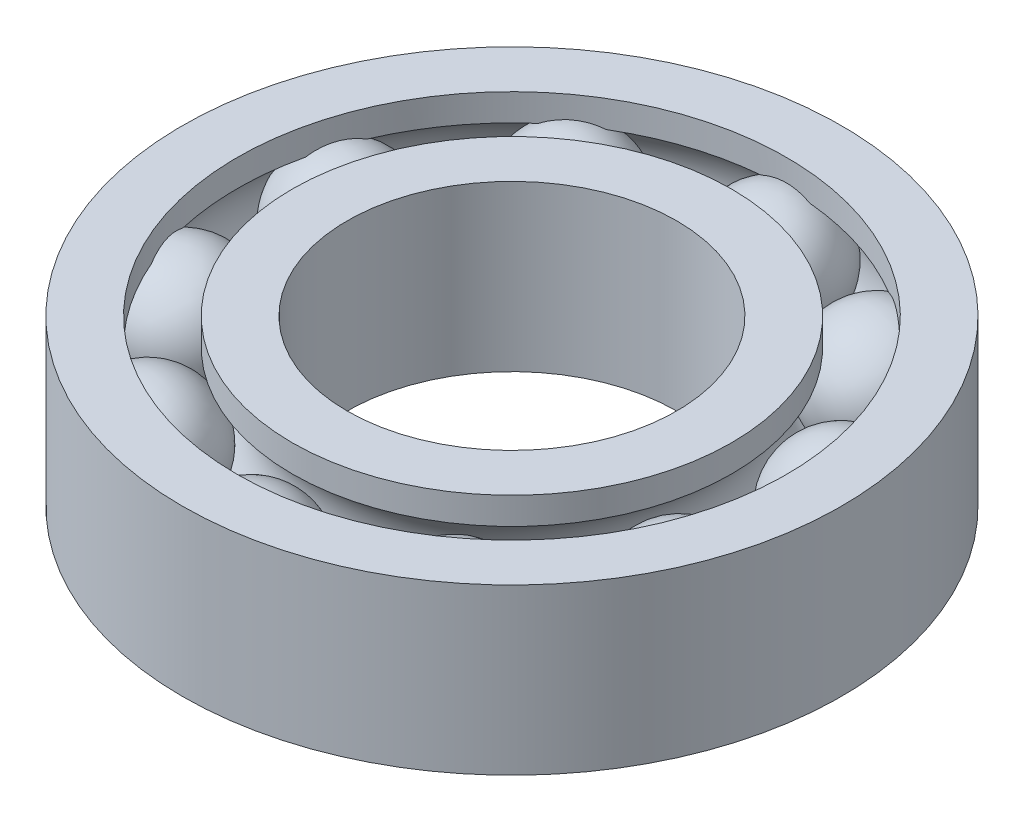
ISO-10303-21;
HEADER;
FILE_DESCRIPTION(('STEP AP214'),'2;1');
FILE_NAME('part.step','',(''),(''),'','','');
FILE_SCHEMA(('AUTOMOTIVE_DESIGN { 1 0 10303 214 1 1 1 1 }'));
ENDSEC;
DATA;
#1=APPLICATION_CONTEXT('core data for automotive mechanical design processes');
#2=APPLICATION_PROTOCOL_DEFINITION('international standard','automotive_design',2000,#1);
#3=PRODUCT_CONTEXT('',#1,'mechanical');
#4=PRODUCT('Part','Part','',(#3));
#5=PRODUCT_RELATED_PRODUCT_CATEGORY('part','',(#4));
#6=PRODUCT_DEFINITION_FORMATION('','',#4);
#7=PRODUCT_DEFINITION_CONTEXT('part definition',#1,'design');
#8=PRODUCT_DEFINITION('design','',#6,#7);
#9=PRODUCT_DEFINITION_SHAPE('','',#8);
#10=(LENGTH_UNIT() NAMED_UNIT(*) SI_UNIT(.MILLI.,.METRE.));
#11=(NAMED_UNIT(*) PLANE_ANGLE_UNIT() SI_UNIT($,.RADIAN.));
#12=(NAMED_UNIT(*) SI_UNIT($,.STERADIAN.) SOLID_ANGLE_UNIT());
#13=UNCERTAINTY_MEASURE_WITH_UNIT(LENGTH_MEASURE(1.E-05),#10,'distance_accuracy_value','');
#14=(GEOMETRIC_REPRESENTATION_CONTEXT(3) GLOBAL_UNCERTAINTY_ASSIGNED_CONTEXT((#13)) GLOBAL_UNIT_ASSIGNED_CONTEXT((#10,
#11,#12)) REPRESENTATION_CONTEXT('',''));
#15=CARTESIAN_POINT('',(0.,0.,0.));
#16=DIRECTION('',(0.,0.,1.));
#17=DIRECTION('',(1.,0.,0.));
#18=AXIS2_PLACEMENT_3D('',#15,#16,#17);
#19=CARTESIAN_POINT('',(0.,3.,0.));
#20=DIRECTION('',(0.,1.,0.));
#21=DIRECTION('',(0.479425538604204,0.,0.877582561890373));
#22=AXIS2_PLACEMENT_3D('',#19,#20,#21);
#23=TOROIDAL_SURFACE('',#22,9.,2.25);
#24=CARTESIAN_POINT('',(0.,0.984435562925,0.));
#25=DIRECTION('',(0.,1.,0.));
#26=DIRECTION('',(0.,0.,1.));
#27=AXIS2_PLACEMENT_3D('',#24,#25,#26);
#28=CIRCLE('',#27,8.);
#29=CARTESIAN_POINT('',(0.,0.984435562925,8.));
#30=VERTEX_POINT('',#29);
#31=EDGE_CURVE('P0_E36',#30,#30,#28,.F.);
#32=ORIENTED_EDGE('',*,*,#31,.F.);
#33=EDGE_LOOP('',(#32));
#34=FACE_BOUND('',#33,.T.);
#35=CARTESIAN_POINT('',(0.,5.01556443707,0.));
#36=DIRECTION('',(0.,1.,0.));
#37=DIRECTION('',(0.,0.,1.));
#38=AXIS2_PLACEMENT_3D('',#35,#36,#37);
#39=CIRCLE('',#38,8.);
#40=CARTESIAN_POINT('',(0.,5.01556443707,8.));
#41=VERTEX_POINT('',#40);
#42=EDGE_CURVE('P0_E31',#41,#41,#39,.T.);
#43=ORIENTED_EDGE('',*,*,#42,.F.);
#44=EDGE_LOOP('',(#43));
#45=FACE_BOUND('',#44,.T.);
#46=ADVANCED_FACE('P0_F15',(#34,#45),#23,.F.);
#47=CARTESIAN_POINT('',(0.,3.,0.));
#48=DIRECTION('',(0.,1.,0.));
#49=DIRECTION('',(0.,0.,1.));
#50=AXIS2_PLACEMENT_3D('',#47,#48,#49);
#51=CYLINDRICAL_SURFACE('',#50,8.);
#52=ORIENTED_EDGE('',*,*,#42,.T.);
#53=EDGE_LOOP('',(#52));
#54=FACE_BOUND('',#53,.T.);
#55=CARTESIAN_POINT('',(0.,6.,0.));
#56=DIRECTION('',(0.,1.,0.));
#57=DIRECTION('',(0.,0.,1.));
#58=AXIS2_PLACEMENT_3D('',#55,#56,#57);
#59=CIRCLE('',#58,8.);
#60=CARTESIAN_POINT('',(0.,6.,8.));
#61=VERTEX_POINT('',#60);
#62=EDGE_CURVE('P0_E19',#61,#61,#59,.T.);
#63=ORIENTED_EDGE('',*,*,#62,.F.);
#64=EDGE_LOOP('',(#63));
#65=FACE_BOUND('',#64,.T.);
#66=ADVANCED_FACE('P0_F47',(#54,#65),#51,.T.);
#67=CARTESIAN_POINT('',(0.,3.,0.));
#68=DIRECTION('',(0.,1.,0.));
#69=DIRECTION('',(0.,0.,1.));
#70=AXIS2_PLACEMENT_3D('',#67,#68,#69);
#71=CYLINDRICAL_SURFACE('',#70,8.);
#72=CARTESIAN_POINT('',(0.,0.,0.));
#73=DIRECTION('',(0.,1.,0.));
#74=DIRECTION('',(0.,0.,1.));
#75=AXIS2_PLACEMENT_3D('',#72,#73,#74);
#76=CIRCLE('',#75,8.);
#77=CARTESIAN_POINT('',(0.,0.,8.));
#78=VERTEX_POINT('',#77);
#79=EDGE_CURVE('P0_E28',#78,#78,#76,.T.);
#80=ORIENTED_EDGE('',*,*,#79,.T.);
#81=EDGE_LOOP('',(#80));
#82=FACE_BOUND('',#81,.T.);
#83=ORIENTED_EDGE('',*,*,#31,.T.);
#84=EDGE_LOOP('',(#83));
#85=FACE_BOUND('',#84,.T.);
#86=ADVANCED_FACE('P0_F56',(#82,#85),#71,.T.);
#87=CARTESIAN_POINT('',(0.,6.,6.));
#88=DIRECTION('',(0.,1.,0.));
#89=DIRECTION('',(0.,0.,1.));
#90=AXIS2_PLACEMENT_3D('',#87,#88,#89);
#91=PLANE('',#90);
#92=CARTESIAN_POINT('',(0.,6.,0.));
#93=DIRECTION('',(0.,1.,0.));
#94=DIRECTION('',(0.,0.,1.));
#95=AXIS2_PLACEMENT_3D('',#92,#93,#94);
#96=CIRCLE('',#95,6.);
#97=CARTESIAN_POINT('',(0.,6.,6.));
#98=VERTEX_POINT('',#97);
#99=EDGE_CURVE('P0_E23',#98,#98,#96,.F.);
#100=ORIENTED_EDGE('',*,*,#99,.T.);
#101=EDGE_LOOP('',(#100));
#102=FACE_BOUND('',#101,.T.);
#103=ORIENTED_EDGE('',*,*,#62,.T.);
#104=EDGE_LOOP('',(#103));
#105=FACE_BOUND('',#104,.T.);
#106=ADVANCED_FACE('P0_F65',(#102,#105),#91,.T.);
#107=CARTESIAN_POINT('',(0.,0.,6.));
#108=DIRECTION('',(0.,1.,0.));
#109=DIRECTION('',(0.,0.,1.));
#110=AXIS2_PLACEMENT_3D('',#107,#108,#109);
#111=PLANE('',#110);
#112=CARTESIAN_POINT('',(0.,0.,0.));
#113=DIRECTION('',(0.,1.,0.));
#114=DIRECTION('',(0.,0.,1.));
#115=AXIS2_PLACEMENT_3D('',#112,#113,#114);
#116=CIRCLE('',#115,6.);
#117=CARTESIAN_POINT('',(0.,0.,6.));
#118=VERTEX_POINT('',#117);
#119=EDGE_CURVE('P0_E10',#118,#118,#116,.T.);
#120=ORIENTED_EDGE('',*,*,#119,.T.);
#121=EDGE_LOOP('',(#120));
#122=FACE_BOUND('',#121,.T.);
#123=ORIENTED_EDGE('',*,*,#79,.F.);
#124=EDGE_LOOP('',(#123));
#125=FACE_BOUND('',#124,.T.);
#126=ADVANCED_FACE('P0_F59',(#122,#125),#111,.F.);
#127=CARTESIAN_POINT('',(0.,3.,0.));
#128=DIRECTION('',(0.,1.,0.));
#129=DIRECTION('',(0.,0.,1.));
#130=AXIS2_PLACEMENT_3D('',#127,#128,#129);
#131=CYLINDRICAL_SURFACE('',#130,6.);
#132=ORIENTED_EDGE('',*,*,#99,.F.);
#133=EDGE_LOOP('',(#132));
#134=FACE_BOUND('',#133,.T.);
#135=ORIENTED_EDGE('',*,*,#119,.F.);
#136=EDGE_LOOP('',(#135));
#137=FACE_BOUND('',#136,.T.);
#138=ADVANCED_FACE('P0_F57',(#134,#137),#131,.F.);
#139=CLOSED_SHELL('',(#46,#66,#86,#106,#126,#138));
#140=MANIFOLD_SOLID_BREP('P0_B1',#139);
#141=CARTESIAN_POINT('',(5.58395989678,3.,-7.68566144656));
#142=DIRECTION('',(0.127966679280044,0.,-0.991778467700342));
#143=DIRECTION('',(-0.991778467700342,0.,-0.127966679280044));
#144=AXIS2_PLACEMENT_3D('',#141,#142,#143);
#145=SPHERICAL_SURFACE('',#144,2.25);
#146=CARTESIAN_POINT('',(5.2960348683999,3.,-5.45415989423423));
#147=VERTEX_POINT('',#146);
#148=VERTEX_LOOP('',#147);
#149=FACE_BOUND('',#148,.T.);
#150=CARTESIAN_POINT('',(6.57277121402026,0.98443556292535,-7.53648980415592));
#151=CARTESIAN_POINT('',(6.6269833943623,1.00954924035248,-7.55642878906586));
#152=CARTESIAN_POINT('',(6.67990210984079,1.03694812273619,-7.57698230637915));
#153=CARTESIAN_POINT('',(6.7829344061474,1.09620547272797,-7.61868148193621));
#154=CARTESIAN_POINT('',(6.83304804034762,1.12806385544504,-7.63982712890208));
#155=CARTESIAN_POINT('',(6.93026468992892,1.19613779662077,-7.68207907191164));
#156=CARTESIAN_POINT('',(6.97736704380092,1.23235430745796,-7.70318535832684));
#157=CARTESIAN_POINT('',(7.06829873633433,1.30893336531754,-7.74486480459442));
#158=CARTESIAN_POINT('',(7.11212816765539,1.34929579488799,-7.76543797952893));
#159=CARTESIAN_POINT('',(7.2384259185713,1.47636418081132,-7.82575382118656));
#160=CARTESIAN_POINT('',(7.31570221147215,1.56905019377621,-7.86409213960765));
#161=CARTESIAN_POINT('',(7.45427918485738,1.76771422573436,-7.93423008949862));
#162=CARTESIAN_POINT('',(7.51558960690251,1.87368408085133,-7.96603370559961));
#163=CARTESIAN_POINT('',(7.61982340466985,2.09402250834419,-8.0207453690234));
#164=CARTESIAN_POINT('',(7.66305311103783,2.20820915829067,-8.0438009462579));
#165=CARTESIAN_POINT('',(7.73151907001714,2.44331678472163,-8.08053410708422));
#166=CARTESIAN_POINT('',(7.75675255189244,2.56423879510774,-8.09421024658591));
#167=CARTESIAN_POINT('',(7.78821919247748,2.80681696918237,-8.111289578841));
#168=CARTESIAN_POINT('',(7.79481416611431,2.92841256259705,-8.11488838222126));
#169=CARTESIAN_POINT('',(7.7898655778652,3.17111764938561,-8.11219456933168));
#170=CARTESIAN_POINT('',(7.77832341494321,3.29222717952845,-8.1059027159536));
#171=CARTESIAN_POINT('',(7.73753351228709,3.52976899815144,-8.08381218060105));
#172=CARTESIAN_POINT('',(7.7083927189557,3.64622504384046,-8.06807092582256));
#173=CARTESIAN_POINT('',(7.63325080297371,3.87195658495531,-8.02792760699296));
#174=CARTESIAN_POINT('',(7.58725279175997,3.98123340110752,-8.00352714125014));
#175=CARTESIAN_POINT('',(7.47919568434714,4.19035584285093,-7.94717044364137));
#176=CARTESIAN_POINT('',(7.41703144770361,4.29013365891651,-7.91516487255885));
#177=CARTESIAN_POINT('',(7.27819063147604,4.47691671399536,-7.84547897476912));
#178=CARTESIAN_POINT('',(7.20150762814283,4.56391626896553,-7.80779613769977));
#179=CARTESIAN_POINT('',(7.07846337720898,4.68175933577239,-7.74964740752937));
#180=CARTESIAN_POINT('',(7.03693267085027,4.7183743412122,-7.73035716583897));
#181=CARTESIAN_POINT('',(6.95108364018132,4.78797875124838,-7.69140007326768));
#182=CARTESIAN_POINT('',(6.90676535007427,4.8209682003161,-7.67173322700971));
#183=CARTESIAN_POINT('',(6.81556076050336,4.88315100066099,-7.63243824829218));
#184=CARTESIAN_POINT('',(6.76867557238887,4.91234597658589,-7.61281010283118));
#185=CARTESIAN_POINT('',(6.67249057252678,4.96687365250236,-7.57410537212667));
#186=CARTESIAN_POINT('',(6.62319063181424,4.99220614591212,-7.55502881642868));
#187=CARTESIAN_POINT('',(6.57277121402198,5.01556443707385,-7.53648980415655));
#188=B_SPLINE_CURVE_WITH_KNOTS('',3,(#150,#151,#152,#153,#154,#155,#156,#157,#158,#159,#160,
#161,#162,#163,#164,#165,#166,#167,#168,#169,#170,#171,#172,#173,#174,#175,#176,#177,#178,#179,
#180,#181,#182,#183,#184,#185,#186,#187),.UNSPECIFIED.,.F.,.F.,(4,2,2,2,2,2,2,2,2,2,2,2,2,2,2,2,
2,2,4),(0.,0.188889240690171,0.377774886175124,0.566701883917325,0.75562353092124,
1.13347254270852,1.51109046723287,1.88202250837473,2.25301164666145,2.61674788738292,
2.98045607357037,3.3419759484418,3.70342912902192,4.06729459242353,4.43132142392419,
4.60706935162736,4.78281512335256,4.95848539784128,5.13416506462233),.UNSPECIFIED.);
#189=CARTESIAN_POINT('',(6.57277121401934,0.984435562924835,-7.53648980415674));
#190=VERTEX_POINT('',#189);
#191=CARTESIAN_POINT('',(6.57277121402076,5.01556443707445,-7.53648980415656));
#192=VERTEX_POINT('',#191);
#193=EDGE_CURVE('P1_E594',#190,#192,#188,.T.);
#194=ORIENTED_EDGE('',*,*,#193,.T.);
#195=CARTESIAN_POINT('',(6.57277121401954,5.01556443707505,-7.53648980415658));
#196=CARTESIAN_POINT('',(6.52871566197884,5.04002916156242,-7.57491850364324));
#197=CARTESIAN_POINT('',(6.48354911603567,5.06205571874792,-7.61362282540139));
#198=CARTESIAN_POINT('',(6.39126437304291,5.10112797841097,-7.6912514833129));
#199=CARTESIAN_POINT('',(6.34414556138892,5.11817209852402,-7.73017588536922));
#200=CARTESIAN_POINT('',(6.2484516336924,5.14709984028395,-7.80772924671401));
#201=CARTESIAN_POINT('',(6.19988328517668,5.15900434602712,-7.84635876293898));
#202=CARTESIAN_POINT('',(6.10144335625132,5.17768079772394,-7.92314861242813));
#203=CARTESIAN_POINT('',(6.05157230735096,5.1844548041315,-7.96130912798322));
#204=CARTESIAN_POINT('',(5.94463056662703,5.19335075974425,-8.04153985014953));
#205=CARTESIAN_POINT('',(5.88742915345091,5.19479760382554,-8.08351325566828));
#206=CARTESIAN_POINT('',(5.77230718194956,5.19116741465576,-8.16611900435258));
#207=CARTESIAN_POINT('',(5.71438672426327,5.18609128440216,-8.20675153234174));
#208=CARTESIAN_POINT('',(5.56902397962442,5.16523400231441,-8.3064513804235));
#209=CARTESIAN_POINT('',(5.48141280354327,5.14534744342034,-8.36449056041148));
#210=CARTESIAN_POINT('',(5.35103970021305,5.10473893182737,-8.44802174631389));
#211=CARTESIAN_POINT('',(5.30768297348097,5.08937088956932,-8.47532102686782));
#212=CARTESIAN_POINT('',(5.22158987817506,5.05510126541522,-8.52863184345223));
#213=CARTESIAN_POINT('',(5.17885340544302,5.0362002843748,-8.55464359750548));
#214=CARTESIAN_POINT('',(5.13652973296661,5.01556443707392,-8.5799803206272));
#215=B_SPLINE_CURVE_WITH_KNOTS('',3,(#195,#196,#197,#198,#199,#200,#201,#202,#203,#204,#205,
#206,#207,#208,#209,#210,#211,#212,#213,#214),.UNSPECIFIED.,.F.,.F.,(4,2,2,2,2,2,2,2,2,4),(0.,
0.19006085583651,0.380182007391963,0.569523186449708,0.758788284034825,0.971345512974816,
1.18387332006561,1.50349591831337,1.66385454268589,1.82418591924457),.UNSPECIFIED.);
#216=CARTESIAN_POINT('',(5.13652973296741,5.01556443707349,-8.57998032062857));
#217=VERTEX_POINT('',#216);
#218=EDGE_CURVE('P1_E668',#192,#217,#215,.T.);
#219=ORIENTED_EDGE('',*,*,#218,.T.);
#220=CARTESIAN_POINT('',(5.13652973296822,5.01556443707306,-8.57998032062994));
#221=CARTESIAN_POINT('',(5.13874034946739,4.99045075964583,-8.63770065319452));
#222=CARTESIAN_POINT('',(5.14193512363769,4.96305187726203,-8.69438072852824));
#223=CARTESIAN_POINT('',(5.14975466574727,4.90379452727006,-8.80525601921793));
#224=CARTESIAN_POINT('',(5.15437940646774,4.8719361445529,-8.85945128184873));
#225=CARTESIAN_POINT('',(5.16452179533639,4.803862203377,-8.96496637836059));
#226=CARTESIAN_POINT('',(5.17003963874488,4.76764569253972,-9.01628558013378));
#227=CARTESIAN_POINT('',(5.1815797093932,4.69106663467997,-9.11564641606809));
#228=CARTESIAN_POINT('',(5.18760192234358,4.65070420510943,-9.16368814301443));
#229=CARTESIAN_POINT('',(5.20593754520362,4.52363581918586,-9.30244306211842));
#230=CARTESIAN_POINT('',(5.21851976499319,4.43094980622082,-9.3877843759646));
#231=CARTESIAN_POINT('',(5.24240227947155,4.23228577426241,-9.54125272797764));
#232=CARTESIAN_POINT('',(5.2537033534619,4.12631591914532,-9.60939026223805));
#233=CARTESIAN_POINT('',(5.2735272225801,3.90597749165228,-9.72542932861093));
#234=CARTESIAN_POINT('',(5.28209566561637,3.79179084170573,-9.77366778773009));
#235=CARTESIAN_POINT('',(5.29587383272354,3.55668321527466,-9.85013395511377));
#236=CARTESIAN_POINT('',(5.30108303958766,3.43576120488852,-9.87835858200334));
#237=CARTESIAN_POINT('',(5.30760272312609,3.19318303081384,-9.91356293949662));
#238=CARTESIAN_POINT('',(5.30898742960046,3.07158743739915,-9.92094722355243));
#239=CARTESIAN_POINT('',(5.30795465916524,2.8288823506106,-9.91540840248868));
#240=CARTESIAN_POINT('',(5.30553747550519,2.70777282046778,-9.90248686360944));
#241=CARTESIAN_POINT('',(5.29713290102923,2.47023100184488,-9.8568670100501));
#242=CARTESIAN_POINT('',(5.29116707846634,2.35377495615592,-9.82428815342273));
#243=CARTESIAN_POINT('',(5.27620864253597,2.12804341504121,-9.74041897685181));
#244=CARTESIAN_POINT('',(5.26721658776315,2.01876659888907,-9.68913210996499));
#245=CARTESIAN_POINT('',(5.24700966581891,1.80964415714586,-9.56894851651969));
#246=CARTESIAN_POINT('',(5.2357803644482,1.70986634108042,-9.4999365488));
#247=CARTESIAN_POINT('',(5.21240930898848,1.52308328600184,-9.34635695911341));
#248=CARTESIAN_POINT('',(5.20026715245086,1.4360837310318,-9.26178245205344));
#249=CARTESIAN_POINT('',(5.18298718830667,1.31824066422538,-9.12679146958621));
#250=CARTESIAN_POINT('',(5.17747477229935,1.28162565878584,-9.08133240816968));
#251=CARTESIAN_POINT('',(5.16695318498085,1.21202124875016,-8.98764672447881));
#252=CARTESIAN_POINT('',(5.16194400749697,1.17903179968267,-8.93942013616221));
#253=CARTESIAN_POINT('',(5.1527560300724,1.1168489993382,-8.84053660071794));
#254=CARTESIAN_POINT('',(5.14857687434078,1.08765402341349,-8.78988070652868));
#255=CARTESIAN_POINT('',(5.14148928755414,1.03312634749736,-8.68644291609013));
#256=CARTESIAN_POINT('',(5.13858092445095,1.00779385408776,-8.63366090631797));
#257=CARTESIAN_POINT('',(5.13652973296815,0.984435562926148,-8.57998032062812));
#258=B_SPLINE_CURVE_WITH_KNOTS('',3,(#220,#221,#222,#223,#224,#225,#226,#227,#228,#229,#230,
#231,#232,#233,#234,#235,#236,#237,#238,#239,#240,#241,#242,#243,#244,#245,#246,#247,#248,#249,
#250,#251,#252,#253,#254,#255,#256,#257),.UNSPECIFIED.,.F.,.F.,(4,2,2,2,2,2,2,2,2,2,2,2,2,2,2,2,
2,2,4),(0.,0.18888924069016,0.377774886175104,0.566701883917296,0.755623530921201,
1.13347254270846,1.51109046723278,1.88202250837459,2.25301164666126,2.61674788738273,
2.98045607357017,3.34197594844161,3.70342912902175,4.06729459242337,4.43132142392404,
4.60706935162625,4.7828151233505,4.95848539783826,5.13416506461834),.UNSPECIFIED.);
#259=CARTESIAN_POINT('',(5.13652973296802,0.984435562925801,-8.57998032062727));
#260=VERTEX_POINT('',#259);
#261=EDGE_CURVE('P1_E186',#217,#260,#258,.T.);
#262=ORIENTED_EDGE('',*,*,#261,.T.);
#263=CARTESIAN_POINT('',(5.13652973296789,0.984435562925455,-8.57998032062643));
#264=CARTESIAN_POINT('',(5.17877837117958,0.963834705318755,-8.55468917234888));
#265=CARTESIAN_POINT('',(5.22144381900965,0.944962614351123,-8.52872105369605));
#266=CARTESIAN_POINT('',(5.30738066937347,0.910743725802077,-8.47550944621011));
#267=CARTESIAN_POINT('',(5.3506519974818,0.895396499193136,-8.44826611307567));
#268=CARTESIAN_POINT('',(5.48108326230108,0.854726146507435,-8.36470967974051));
#269=CARTESIAN_POINT('',(5.56882684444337,0.834790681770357,-8.30659018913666));
#270=CARTESIAN_POINT('',(5.75996322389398,0.807373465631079,-8.17548774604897));
#271=CARTESIAN_POINT('',(5.86326021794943,0.802863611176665,-8.10173942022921));
#272=CARTESIAN_POINT('',(6.06613575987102,0.81468671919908,-7.95097099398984));
#273=CARTESIAN_POINT('',(6.16571735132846,0.831002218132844,-7.87395368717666));
#274=CARTESIAN_POINT('',(6.3161561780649,0.872352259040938,-7.75312932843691));
#275=CARTESIAN_POINT('',(6.36922543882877,0.890422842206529,-7.70957382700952));
#276=CARTESIAN_POINT('',(6.4729054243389,0.932796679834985,-7.62273437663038));
#277=CARTESIAN_POINT('',(6.52351955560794,0.957090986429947,-7.57945012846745));
#278=CARTESIAN_POINT('',(6.57277121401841,0.984435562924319,-7.53648980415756));
#279=B_SPLINE_CURVE_WITH_KNOTS('',3,(#263,#264,#265,#266,#267,#268,#269,#270,#271,#272,#273,
#274,#275,#276,#277,#278),.UNSPECIFIED.,.F.,.F.,(4,2,2,2,2,2,2,4),(0.,0.160060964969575,
0.320102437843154,0.640311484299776,1.0195276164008,1.39842595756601,1.61112016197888,
1.82351027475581),.UNSPECIFIED.);
#280=EDGE_CURVE('P1_E22',#260,#190,#279,.T.);
#281=ORIENTED_EDGE('',*,*,#280,.T.);
#282=EDGE_LOOP('',(#194,#219,#262,#281));
#283=FACE_BOUND('',#282,.T.);
#284=ADVANCED_FACE('P1_F17',(#149,#283),#145,.T.);
#285=CARTESIAN_POINT('',(9.0350369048,3.,-2.93566144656));
#286=DIRECTION('',(0.686479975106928,0.,-0.727148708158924));
#287=DIRECTION('',(-0.727148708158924,0.,-0.686479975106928));
#288=AXIS2_PLACEMENT_3D('',#285,#286,#287);
#289=SPHERICAL_SURFACE('',#288,2.25);
#290=CARTESIAN_POINT('',(7.49045696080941,3.,-1.29957685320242));
#291=VERTEX_POINT('',#290);
#292=VERTEX_LOOP('',#291);
#293=FACE_BOUND('',#292,.T.);
#294=CARTESIAN_POINT('',(9.74732117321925,0.984435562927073,-2.23377034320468));
#295=CARTESIAN_POINT('',(9.80289958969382,1.00954924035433,-2.21803620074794));
#296=CARTESIAN_POINT('',(9.85779278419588,1.03694812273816,-2.20355950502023));
#297=CARTESIAN_POINT('',(9.96565782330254,1.0962054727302,-2.17673398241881));
#298=CARTESIAN_POINT('',(10.0186297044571,1.12806385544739,-2.16438511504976));
#299=CARTESIAN_POINT('',(10.1221146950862,1.19613779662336,-2.141425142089));
#300=CARTESIAN_POINT('',(10.1726272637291,1.23235430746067,-2.13081441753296));
#301=CARTESIAN_POINT('',(10.2706911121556,1.30893336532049,-2.11108549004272));
#302=CARTESIAN_POINT('',(10.3182424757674,1.34929579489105,-2.10196724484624));
#303=CARTESIAN_POINT('',(10.4558722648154,1.47636418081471,-2.07652783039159));
#304=CARTESIAN_POINT('',(10.5409247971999,1.56905019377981,-2.06212231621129));
#305=CARTESIAN_POINT('',(10.6942619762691,1.76771422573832,-2.03741160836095));
#306=CARTESIAN_POINT('',(10.7625568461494,1.87368408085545,-2.02710391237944));
#307=CARTESIAN_POINT('',(10.8790424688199,2.09402250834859,-2.01009948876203));
#308=CARTESIAN_POINT('',(10.9275677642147,2.20820915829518,-2.00334205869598));
#309=CARTESIAN_POINT('',(11.0045490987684,2.44331678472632,-1.99281652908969));
#310=CARTESIAN_POINT('',(11.0330020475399,2.5642387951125,-1.9890488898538));
#311=CARTESIAN_POINT('',(11.068498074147,2.80681696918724,-1.98437073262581));
#312=CARTESIAN_POINT('',(11.0759488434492,2.92841256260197,-1.98340579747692));
#313=CARTESIAN_POINT('',(11.0703619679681,3.17111764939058,-1.98413516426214));
#314=CARTESIAN_POINT('',(11.0573259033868,3.29222717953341,-1.98582926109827));
#315=CARTESIAN_POINT('',(11.0113416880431,3.52976899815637,-1.99193334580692));
#316=CARTESIAN_POINT('',(10.9785138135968,3.64622504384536,-1.99632693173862));
#317=CARTESIAN_POINT('',(10.8941270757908,3.8719565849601,-2.008017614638));
#318=CARTESIAN_POINT('',(10.8425716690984,3.98123340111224,-2.01531417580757));
#319=CARTESIAN_POINT('',(10.7220259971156,4.19035584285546,-2.03323502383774));
#320=CARTESIAN_POINT('',(10.6529216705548,4.29013365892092,-2.04388119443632));
#321=CARTESIAN_POINT('',(10.4996367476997,4.4769167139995,-2.0691127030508));
#322=CARTESIAN_POINT('',(10.4154494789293,4.56391626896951,-2.0836997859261));
#323=CARTESIAN_POINT('',(10.2817256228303,4.68175933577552,-2.10898007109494));
#324=CARTESIAN_POINT('',(10.2367880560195,4.7183743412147,-2.11778507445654));
#325=CARTESIAN_POINT('',(10.1444363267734,4.78797875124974,-2.13672891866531));
#326=CARTESIAN_POINT('',(10.0970221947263,4.82096820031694,-2.14686774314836));
#327=CARTESIAN_POINT('',(10.0001391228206,4.8831510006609,-2.16868615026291));
#328=CARTESIAN_POINT('',(9.95067107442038,4.91234597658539,-2.18036506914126));
#329=CARTESIAN_POINT('',(9.85010570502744,4.96687365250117,-2.20558840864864));
#330=CARTESIAN_POINT('',(9.79900829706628,4.99220614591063,-2.2191329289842));
#331=CARTESIAN_POINT('',(9.74732117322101,5.01556443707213,-2.23377034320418));
#332=B_SPLINE_CURVE_WITH_KNOTS('',3,(#294,#295,#296,#297,#298,#299,#300,#301,#302,#303,#304,
#305,#306,#307,#308,#309,#310,#311,#312,#313,#314,#315,#316,#317,#318,#319,#320,#321,#322,#323,
#324,#325,#326,#327,#328,#329,#330,#331),.UNSPECIFIED.,.F.,.F.,(4,2,2,2,2,2,2,2,2,2,2,2,2,2,2,2,
2,2,4),(0.,0.18888924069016,0.377774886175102,0.566701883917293,0.755623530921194,
1.13347254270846,1.51109046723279,1.88202250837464,2.25301164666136,2.61674788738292,
2.98045607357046,3.34197594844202,3.70342912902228,4.06729459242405,4.43132142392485,
4.6070693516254,4.78281512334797,4.95848539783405,5.13416506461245),.UNSPECIFIED.);
#333=CARTESIAN_POINT('',(9.74732117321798,0.984435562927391,-2.23377034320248));
#334=VERTEX_POINT('',#333);
#335=CARTESIAN_POINT('',(9.74732117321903,5.0155644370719,-2.2337703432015));
#336=VERTEX_POINT('',#335);
#337=EDGE_CURVE('P1_E623',#334,#336,#332,.T.);
#338=ORIENTED_EDGE('',*,*,#337,.T.);
#339=CARTESIAN_POINT('',(9.74732117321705,5.01556443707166,-2.23377034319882));
#340=CARTESIAN_POINT('',(9.73426730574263,5.04002916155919,-2.29075501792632));
#341=CARTESIAN_POINT('',(9.72047663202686,5.06205571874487,-2.34861570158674));
#342=CARTESIAN_POINT('',(9.69144568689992,5.10112797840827,-2.46566221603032));
#343=CARTESIAN_POINT('',(9.67620495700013,5.11817209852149,-2.52484846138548));
#344=CARTESIAN_POINT('',(9.64437166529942,5.14709984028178,-2.6438379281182));
#345=CARTESIAN_POINT('',(9.62778490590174,5.15900434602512,-2.70363762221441));
#346=CARTESIAN_POINT('',(9.59328127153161,5.1776807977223,-2.82362345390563));
#347=CARTESIAN_POINT('',(9.57536493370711,5.18445480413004,-2.88380942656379));
#348=CARTESIAN_POINT('',(9.53600568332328,5.19335075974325,-3.01157622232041));
#349=CARTESIAN_POINT('',(9.51440011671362,5.19479760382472,-3.07915556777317));
#350=CARTESIAN_POINT('',(9.46981892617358,5.19116741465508,-3.21365201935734));
#351=CARTESIAN_POINT('',(9.44684349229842,5.18609128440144,-3.28056921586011));
#352=CARTESIAN_POINT('',(9.38784466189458,5.16523400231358,-3.44667016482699));
#353=CARTESIAN_POINT('',(9.35108030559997,5.14534744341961,-3.54512140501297));
#354=CARTESIAN_POINT('',(9.29470464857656,5.10473893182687,-3.68933094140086));
#355=CARTESIAN_POINT('',(9.27567443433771,5.08937088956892,-3.7369009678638));
#356=CARTESIAN_POINT('',(9.23735896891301,5.05510126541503,-3.83063457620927));
#357=CARTESIAN_POINT('',(9.21807376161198,5.03620028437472,-3.87679839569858));
#358=CARTESIAN_POINT('',(9.19872574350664,5.01556443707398,-3.92217346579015));
#359=B_SPLINE_CURVE_WITH_KNOTS('',3,(#339,#340,#341,#342,#343,#344,#345,#346,#347,#348,#349,
#350,#351,#352,#353,#354,#355,#356,#357,#358),.UNSPECIFIED.,.F.,.F.,(4,2,2,2,2,2,2,2,2,4),(0.,
0.1900608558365,0.380182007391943,0.569523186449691,0.758788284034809,0.971345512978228,
1.18387332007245,1.50349591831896,1.66385454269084,1.82418591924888),.UNSPECIFIED.);
#360=CARTESIAN_POINT('',(9.1987257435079,5.01556443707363,-3.92217346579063));
#361=VERTEX_POINT('',#360);
#362=EDGE_CURVE('P1_E670',#336,#361,#359,.T.);
#363=ORIENTED_EDGE('',*,*,#362,.T.);
#364=CARTESIAN_POINT('',(9.19872574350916,5.01556443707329,-3.92217346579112));
#365=CARTESIAN_POINT('',(9.23444133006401,4.99045075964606,-3.96757082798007));
#366=CARTESIAN_POINT('',(9.27034166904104,4.96305187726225,-4.01154813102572));
#367=CARTESIAN_POINT('',(9.34183867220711,4.90379452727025,-4.09665191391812));
#368=CARTESIAN_POINT('',(9.37743534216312,4.87193614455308,-4.13777844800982));
#369=CARTESIAN_POINT('',(9.44766092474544,4.80386220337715,-4.21718040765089));
#370=CARTESIAN_POINT('',(9.48228962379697,4.76764569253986,-4.25545520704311));
#371=CARTESIAN_POINT('',(9.5500285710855,4.69106663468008,-4.32905672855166));
#372=CARTESIAN_POINT('',(9.58313886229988,4.65070420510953,-4.3643835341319));
#373=CARTESIAN_POINT('',(9.67953078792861,4.52363581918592,-4.46586121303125));
#374=CARTESIAN_POINT('',(9.73987238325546,4.43094980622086,-4.52750814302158));
#375=CARTESIAN_POINT('',(9.8494001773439,4.2322857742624,-4.63762885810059));
#376=CARTESIAN_POINT('',(9.89859317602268,4.12631591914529,-4.68611067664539));
#377=CARTESIAN_POINT('',(9.98283707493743,3.9059774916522,-4.76833607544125));
#378=CARTESIAN_POINT('',(10.0181229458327,3.79179084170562,-4.80232540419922));
#379=CARTESIAN_POINT('',(10.0742154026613,3.55668321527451,-4.85608922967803));
#380=CARTESIAN_POINT('',(10.0950197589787,3.43576120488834,-4.87586153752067));
#381=CARTESIAN_POINT('',(10.1209868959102,3.19318303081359,-4.90051028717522));
#382=CARTESIAN_POINT('',(10.126447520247,3.07158743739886,-4.90567038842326));
#383=CARTESIAN_POINT('',(10.1223563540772,2.82888235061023,-4.90179643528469));
#384=CARTESIAN_POINT('',(10.1128057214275,2.70777282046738,-4.89276347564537));
#385=CARTESIAN_POINT('',(10.079191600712,2.4702310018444,-4.86079632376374));
#386=CARTESIAN_POINT('',(10.055215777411,2.3537749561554,-4.83794609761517));
#387=CARTESIAN_POINT('',(9.99381708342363,2.12804341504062,-4.77888685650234));
#388=CARTESIAN_POINT('',(9.95639669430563,2.01876659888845,-4.74268030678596));
#389=CARTESIAN_POINT('',(9.86940680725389,1.80964415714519,-4.65732706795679));
#390=CARTESIAN_POINT('',(9.81975789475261,1.70986634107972,-4.60809563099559));
#391=CARTESIAN_POINT('',(9.71057849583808,1.5230832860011,-4.49758429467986));
#392=CARTESIAN_POINT('',(9.65104363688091,1.43608373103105,-4.43629906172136));
#393=CARTESIAN_POINT('',(9.55771814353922,1.31824066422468,-4.33724597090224));
#394=CARTESIAN_POINT('',(9.52653833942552,1.28162565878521,-4.30370893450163));
#395=CARTESIAN_POINT('',(9.46295913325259,1.21202124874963,-4.2341000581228));
#396=CARTESIAN_POINT('',(9.43055974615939,1.17903179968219,-4.19802824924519));
#397=CARTESIAN_POINT('',(9.36500423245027,1.11684899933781,-4.12343034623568));
#398=CARTESIAN_POINT('',(9.33184843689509,1.08765402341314,-4.0849053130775));
#399=CARTESIAN_POINT('',(9.26531525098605,1.03312634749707,-4.00538836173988));
#400=CARTESIAN_POINT('',(9.23193784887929,1.0077938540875,-3.96439631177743));
#401=CARTESIAN_POINT('',(9.19872574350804,0.984435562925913,-3.92217346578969));
#402=B_SPLINE_CURVE_WITH_KNOTS('',3,(#364,#365,#366,#367,#368,#369,#370,#371,#372,#373,#374,
#375,#376,#377,#378,#379,#380,#381,#382,#383,#384,#385,#386,#387,#388,#389,#390,#391,#392,#393,
#394,#395,#396,#397,#398,#399,#400,#401),.UNSPECIFIED.,.F.,.F.,(4,2,2,2,2,2,2,2,2,2,2,2,2,2,2,2,
2,2,4),(0.,0.188889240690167,0.377774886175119,0.566701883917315,0.75562353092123,
1.1334725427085,1.51109046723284,1.88202250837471,2.25301164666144,2.61674788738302,
2.98045607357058,3.34197594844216,3.70342912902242,4.06729459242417,4.43132142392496,
4.60706935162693,4.78281512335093,4.95848539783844,5.13416506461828),.UNSPECIFIED.);
#403=CARTESIAN_POINT('',(9.19872574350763,0.984435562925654,-3.92217346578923));
#404=VERTEX_POINT('',#403);
#405=EDGE_CURVE('P1_E635',#361,#404,#402,.T.);
#406=ORIENTED_EDGE('',*,*,#405,.T.);
#407=CARTESIAN_POINT('',(9.19872574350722,0.984435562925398,-3.92217346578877));
#408=CARTESIAN_POINT('',(9.21803984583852,0.963834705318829,-3.87687937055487));
#409=CARTESIAN_POINT('',(9.23729324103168,0.944962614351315,-3.83079260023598));
#410=CARTESIAN_POINT('',(9.27554061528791,0.910743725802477,-3.73723109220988));
#411=CARTESIAN_POINT('',(9.29453462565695,0.895396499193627,-3.68975652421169));
#412=CARTESIAN_POINT('',(9.35094249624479,0.854726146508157,-3.54549237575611));
#413=CARTESIAN_POINT('',(9.38776676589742,0.834790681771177,-3.44689833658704));
#414=CARTESIAN_POINT('',(9.4653392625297,0.807373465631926,-3.22848708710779));
#415=CARTESIAN_POINT('',(9.50556010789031,0.802863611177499,-3.10810698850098));
#416=CARTESIAN_POINT('',(9.5810704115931,0.814686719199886,-2.86688551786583));
#417=CARTESIAN_POINT('',(9.61636397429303,0.831002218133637,-2.74604461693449));
#418=CARTESIAN_POINT('',(9.66705276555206,0.872352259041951,-2.55986993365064));
#419=CARTESIAN_POINT('',(9.684385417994,0.890422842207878,-2.49343946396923));
#420=CARTESIAN_POINT('',(9.7172213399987,0.932796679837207,-2.36224330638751));
#421=CARTESIAN_POINT('',(9.73272718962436,0.957090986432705,-2.29747537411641));
#422=CARTESIAN_POINT('',(9.74732117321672,0.984435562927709,-2.23377034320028));
#423=B_SPLINE_CURVE_WITH_KNOTS('',3,(#407,#408,#409,#410,#411,#412,#413,#414,#415,#416,#417,
#418,#419,#420,#421,#422),.UNSPECIFIED.,.F.,.F.,(4,2,2,2,2,2,2,4),(0.,0.160060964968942,
0.32010243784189,0.640311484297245,1.01952761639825,1.39842595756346,1.61112016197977,
1.82351027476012),.UNSPECIFIED.);
#424=EDGE_CURVE('P1_E411',#404,#334,#423,.T.);
#425=ORIENTED_EDGE('',*,*,#424,.T.);
#426=EDGE_LOOP('',(#338,#363,#406,#425));
#427=FACE_BOUND('',#426,.T.);
#428=ADVANCED_FACE('P1_F641',(#293,#427),#289,.T.);
#429=CARTESIAN_POINT('',(9.0350369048,3.,2.93566144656));
#430=DIRECTION('',(0.982781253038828,0.,-0.184772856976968));
#431=DIRECTION('',(-0.184772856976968,0.,-0.982781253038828));
#432=AXIS2_PLACEMENT_3D('',#429,#430,#431);
#433=SPHERICAL_SURFACE('',#432,2.25);
#434=CARTESIAN_POINT('',(6.82377908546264,3.,3.35140037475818));
#435=VERTEX_POINT('',#434);
#436=VERTEX_LOOP('',#435);
#437=FACE_BOUND('',#436,.T.);
#438=CARTESIAN_POINT('',(9.19872574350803,0.984435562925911,3.92217346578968));
#439=CARTESIAN_POINT('',(9.23444133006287,1.0095492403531,3.96757082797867));
#440=CARTESIAN_POINT('',(9.2703416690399,1.03694812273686,4.01154813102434));
#441=CARTESIAN_POINT('',(9.34183867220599,1.09620547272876,4.09665191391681));
#442=CARTESIAN_POINT('',(9.377435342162,1.12806385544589,4.13777844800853));
#443=CARTESIAN_POINT('',(9.44766092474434,1.19613779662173,4.21718040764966));
#444=CARTESIAN_POINT('',(9.48228962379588,1.23235430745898,4.25545520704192));
#445=CARTESIAN_POINT('',(9.55002857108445,1.30893336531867,4.32905672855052));
#446=CARTESIAN_POINT('',(9.58313886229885,1.34929579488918,4.3643835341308));
#447=CARTESIAN_POINT('',(9.67953078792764,1.47636418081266,4.46586121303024));
#448=CARTESIAN_POINT('',(9.73987238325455,1.56905019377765,4.52750814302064));
#449=CARTESIAN_POINT('',(9.8494001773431,1.76771422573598,4.6376288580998));
#450=CARTESIAN_POINT('',(9.89859317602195,1.87368408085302,4.68611067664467));
#451=CARTESIAN_POINT('',(9.98283707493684,2.09402250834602,4.76833607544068));
#452=CARTESIAN_POINT('',(10.0181229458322,2.20820915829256,4.80232540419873));
#453=CARTESIAN_POINT('',(10.0742154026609,2.44331678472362,4.85608922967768));
#454=CARTESIAN_POINT('',(10.0950197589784,2.56423879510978,4.87586153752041));
#455=CARTESIAN_POINT('',(10.1209868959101,2.80681696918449,4.9005102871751));
#456=CARTESIAN_POINT('',(10.1264475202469,2.92841256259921,4.9056703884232));
#457=CARTESIAN_POINT('',(10.1223563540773,3.17111764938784,4.9017964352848));
#458=CARTESIAN_POINT('',(10.1128057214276,3.2922271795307,4.89276347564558));
#459=CARTESIAN_POINT('',(10.0791916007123,3.52976899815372,4.8607963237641));
#460=CARTESIAN_POINT('',(10.0552157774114,3.64622504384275,4.83794609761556));
#461=CARTESIAN_POINT('',(9.99381708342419,3.8719565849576,4.77888685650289));
#462=CARTESIAN_POINT('',(9.95639669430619,3.9812334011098,4.74268030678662));
#463=CARTESIAN_POINT('',(9.86940680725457,4.19035584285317,4.65732706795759));
#464=CARTESIAN_POINT('',(9.81975789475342,4.29013365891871,4.60809563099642));
#465=CARTESIAN_POINT('',(9.71057849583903,4.47691671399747,4.4975842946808));
#466=CARTESIAN_POINT('',(9.65104363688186,4.56391626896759,4.43629906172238));
#467=CARTESIAN_POINT('',(9.55771814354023,4.68175933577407,4.33724597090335));
#468=CARTESIAN_POINT('',(9.52653833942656,4.71837434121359,4.30370893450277));
#469=CARTESIAN_POINT('',(9.46295913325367,4.78797875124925,4.23410005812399));
#470=CARTESIAN_POINT('',(9.43055974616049,4.82096820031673,4.19802824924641));
#471=CARTESIAN_POINT('',(9.36500423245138,4.88315100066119,4.12343034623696));
#472=CARTESIAN_POINT('',(9.33184843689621,4.9123459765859,4.08490531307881));
#473=CARTESIAN_POINT('',(9.26531525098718,4.96687365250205,4.00538836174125));
#474=CARTESIAN_POINT('',(9.23193784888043,4.99220614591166,3.96439631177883));
#475=CARTESIAN_POINT('',(9.19872574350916,5.01556443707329,3.92217346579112));
#476=B_SPLINE_CURVE_WITH_KNOTS('',3,(#438,#439,#440,#441,#442,#443,#444,#445,#446,#447,#448,
#449,#450,#451,#452,#453,#454,#455,#456,#457,#458,#459,#460,#461,#462,#463,#464,#465,#466,#467,
#468,#469,#470,#471,#472,#473,#474,#475),.UNSPECIFIED.,.F.,.F.,(4,2,2,2,2,2,2,2,2,2,2,2,2,2,2,2,
2,2,4),(0.,0.188889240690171,0.377774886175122,0.566701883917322,0.755623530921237,
1.13347254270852,1.51109046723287,1.88202250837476,2.25301164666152,2.61674788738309,
2.98045607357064,3.34197594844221,3.70342912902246,4.06729459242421,4.431321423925,
4.60706935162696,4.78281512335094,4.95848539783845,5.13416506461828),.UNSPECIFIED.);
#477=CARTESIAN_POINT('',(9.19872574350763,0.984435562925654,3.92217346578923));
#478=VERTEX_POINT('',#477);
#479=CARTESIAN_POINT('',(9.1987257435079,5.01556443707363,3.92217346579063));
#480=VERTEX_POINT('',#479);
#481=EDGE_CURVE('P1_E653',#478,#480,#476,.T.);
#482=ORIENTED_EDGE('',*,*,#481,.T.);
#483=CARTESIAN_POINT('',(9.19872574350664,5.01556443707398,3.92217346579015));
#484=CARTESIAN_POINT('',(9.22165969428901,5.04002916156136,3.86839902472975));
#485=CARTESIAN_POINT('',(9.2445124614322,5.06205571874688,3.81348279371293));
#486=CARTESIAN_POINT('',(9.28982414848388,5.10112797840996,3.70172621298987));
#487=CARTESIAN_POINT('',(9.31228294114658,5.11817209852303,3.64488525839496));
#488=CARTESIAN_POINT('',(9.35646952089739,5.14709984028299,3.52990961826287));
#489=CARTESIAN_POINT('',(9.37819992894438,5.15900434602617,3.4717811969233));
#490=CARTESIAN_POINT('',(9.42081180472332,5.17768079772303,3.35442989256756));
#491=CARTESIAN_POINT('',(9.44169361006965,5.18445480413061,3.29520745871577));
#492=CARTESIAN_POINT('',(9.48495074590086,5.19335075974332,3.16870716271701));
#493=CARTESIAN_POINT('',(9.50719361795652,5.19479760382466,3.10133489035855));
#494=CARTESIAN_POINT('',(9.55018170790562,5.19116741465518,2.96632080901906));
#495=CARTESIAN_POINT('',(9.57092713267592,5.18609128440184,2.89867903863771));
#496=CARTESIAN_POINT('',(9.62082776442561,5.16523400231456,2.7296219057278));
#497=CARTESIAN_POINT('',(9.64895296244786,5.14534744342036,2.62836363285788));
#498=CARTESIAN_POINT('',(9.68810833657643,5.10473893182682,2.47855888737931));
#499=CARTESIAN_POINT('',(9.70067352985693,5.08937088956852,2.4288882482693));
#500=CARTESIAN_POINT('',(9.72477089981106,5.05510126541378,2.33053490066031));
#501=CARTESIAN_POINT('',(9.73630325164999,5.03620028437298,2.28185202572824));
#502=CARTESIAN_POINT('',(9.74732117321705,5.01556443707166,2.23377034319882));
#503=B_SPLINE_CURVE_WITH_KNOTS('',3,(#483,#484,#485,#486,#487,#488,#489,#490,#491,#492,#493,
#494,#495,#496,#497,#498,#499,#500,#501,#502),.UNSPECIFIED.,.F.,.F.,(4,2,2,2,2,2,2,2,2,4),(0.,
0.190060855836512,0.380182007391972,0.569523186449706,0.758788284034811,0.971345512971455,
1.18387332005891,1.50349591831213,1.66385454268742,1.82418591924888),.UNSPECIFIED.);
#504=CARTESIAN_POINT('',(9.74732117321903,5.0155644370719,2.2337703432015));
#505=VERTEX_POINT('',#504);
#506=EDGE_CURVE('P1_E177',#480,#505,#503,.T.);
#507=ORIENTED_EDGE('',*,*,#506,.T.);
#508=CARTESIAN_POINT('',(9.747321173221,5.01556443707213,2.23377034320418));
#509=CARTESIAN_POINT('',(9.80289958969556,4.99045075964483,2.21803620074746));
#510=CARTESIAN_POINT('',(9.8577927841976,4.96305187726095,2.20355950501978));
#511=CARTESIAN_POINT('',(9.96565782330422,4.90379452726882,2.17673398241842));
#512=CARTESIAN_POINT('',(10.0186297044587,4.87193614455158,2.16438511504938));
#513=CARTESIAN_POINT('',(10.1221146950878,4.80386220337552,2.14142514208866));
#514=CARTESIAN_POINT('',(10.1726272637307,4.76764569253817,2.13081441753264));
#515=CARTESIAN_POINT('',(10.2706911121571,4.69106663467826,2.11108549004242));
#516=CARTESIAN_POINT('',(10.3182424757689,4.65070420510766,2.10196724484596));
#517=CARTESIAN_POINT('',(10.4558722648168,4.52363581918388,2.07652783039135));
#518=CARTESIAN_POINT('',(10.5409247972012,4.43094980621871,2.06212231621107));
#519=CARTESIAN_POINT('',(10.6942619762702,4.23228577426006,2.03741160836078));
#520=CARTESIAN_POINT('',(10.7625568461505,4.12631591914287,2.02710391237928));
#521=CARTESIAN_POINT('',(10.8790424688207,3.90597749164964,2.01009948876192));
#522=CARTESIAN_POINT('',(10.9275677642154,3.79179084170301,2.00334205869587));
#523=CARTESIAN_POINT('',(11.0045490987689,3.55668321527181,1.99281652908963));
#524=CARTESIAN_POINT('',(11.0330020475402,3.43576120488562,1.98904888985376));
#525=CARTESIAN_POINT('',(11.0684980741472,3.19318303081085,1.98437073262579));
#526=CARTESIAN_POINT('',(11.0759488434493,3.07158743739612,1.98340579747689));
#527=CARTESIAN_POINT('',(11.0703619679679,2.82888235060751,1.98413516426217));
#528=CARTESIAN_POINT('',(11.0573259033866,2.70777282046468,1.98582926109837));
#529=CARTESIAN_POINT('',(11.0113416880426,2.47023100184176,1.99193334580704));
#530=CARTESIAN_POINT('',(10.9785138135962,2.3537749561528,1.99632693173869));
#531=CARTESIAN_POINT('',(10.89412707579,2.12804341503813,2.00801761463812));
#532=CARTESIAN_POINT('',(10.8425716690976,2.01876659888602,2.01531417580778));
#533=CARTESIAN_POINT('',(10.7220259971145,1.80964415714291,2.03323502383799));
#534=CARTESIAN_POINT('',(10.6529216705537,1.70986634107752,2.04388119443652));
#535=CARTESIAN_POINT('',(10.4996367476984,1.52308328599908,2.069112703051));
#536=CARTESIAN_POINT('',(10.4154494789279,1.43608373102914,2.08369978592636));
#537=CARTESIAN_POINT('',(10.2817256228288,1.31824066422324,2.10898007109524));
#538=CARTESIAN_POINT('',(10.236788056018,1.2816256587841,2.11778507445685));
#539=CARTESIAN_POINT('',(10.1444363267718,1.21202124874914,2.13672891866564));
#540=CARTESIAN_POINT('',(10.0970221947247,1.17903179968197,2.14686774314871));
#541=CARTESIAN_POINT('',(10.0001391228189,1.11684899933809,2.16868615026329));
#542=CARTESIAN_POINT('',(9.95067107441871,1.08765402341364,2.18036506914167));
#543=CARTESIAN_POINT('',(9.85010570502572,1.03312634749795,2.2055884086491));
#544=CARTESIAN_POINT('',(9.79900829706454,1.00779385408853,2.21913292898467));
#545=CARTESIAN_POINT('',(9.74732117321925,0.984435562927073,2.23377034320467));
#546=B_SPLINE_CURVE_WITH_KNOTS('',3,(#508,#509,#510,#511,#512,#513,#514,#515,#516,#517,#518,
#519,#520,#521,#522,#523,#524,#525,#526,#527,#528,#529,#530,#531,#532,#533,#534,#535,#536,#537,
#538,#539,#540,#541,#542,#543,#544,#545),.UNSPECIFIED.,.F.,.F.,(4,2,2,2,2,2,2,2,2,2,2,2,2,2,2,2,
2,2,4),(0.,0.188889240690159,0.377774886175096,0.566701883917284,0.755623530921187,
1.13347254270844,1.51109046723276,1.88202250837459,2.25301164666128,2.61674788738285,
2.98045607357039,3.34197594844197,3.70342912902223,4.067294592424,4.43132142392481,
4.60706935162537,4.78281512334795,4.95848539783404,5.13416506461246),.UNSPECIFIED.);
#547=CARTESIAN_POINT('',(9.74732117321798,0.984435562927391,2.23377034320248));
#548=VERTEX_POINT('',#547);
#549=EDGE_CURVE('P1_E629',#505,#548,#546,.T.);
#550=ORIENTED_EDGE('',*,*,#549,.T.);
#551=CARTESIAN_POINT('',(9.74732117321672,0.98443556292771,2.23377034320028));
#552=CARTESIAN_POINT('',(9.73632340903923,0.963834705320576,2.28176658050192));
#553=CARTESIAN_POINT('',(9.72481060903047,0.944962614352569,2.33036842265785));
#554=CARTESIAN_POINT('',(9.70075931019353,0.910743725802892,2.4285425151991));
#555=CARTESIAN_POINT('',(9.68822093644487,0.895396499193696,2.47811464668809));
#556=CARTESIAN_POINT('',(9.64905952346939,0.85472614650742,2.62798250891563));
#557=CARTESIAN_POINT('',(9.62089886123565,0.834790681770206,2.72939152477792));
#558=CARTESIAN_POINT('',(9.55527741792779,0.807373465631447,2.95168590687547));
#559=CARTESIAN_POINT('',(9.51705911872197,0.802863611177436,3.07271667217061));
#560=CARTESIAN_POINT('',(9.43636181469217,0.814686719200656,3.3122527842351));
#561=CARTESIAN_POINT('',(9.39388640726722,0.83100221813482,3.43076016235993));
#562=CARTESIAN_POINT('',(9.32546376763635,0.872352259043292,3.61117276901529));
#563=CARTESIAN_POINT('',(9.30043932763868,0.890422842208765,3.67510402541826));
#564=CARTESIAN_POINT('',(9.2498889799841,0.93279667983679,3.80054441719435));
#565=CARTESIAN_POINT('',(9.22436384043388,0.957090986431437,3.86205688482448));
#566=CARTESIAN_POINT('',(9.19872574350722,0.984435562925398,3.92217346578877));
#567=B_SPLINE_CURVE_WITH_KNOTS('',3,(#551,#552,#553,#554,#555,#556,#557,#558,#559,#560,#561,
#562,#563,#564,#565,#566),.UNSPECIFIED.,.F.,.F.,(4,2,2,2,2,2,2,4),(0.,0.160060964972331,
0.320102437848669,0.640311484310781,1.01952761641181,1.398425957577,1.61112016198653,
1.82351027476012),.UNSPECIFIED.);
#568=EDGE_CURVE('P1_E404',#548,#478,#567,.T.);
#569=ORIENTED_EDGE('',*,*,#568,.T.);
#570=EDGE_LOOP('',(#482,#507,#550,#569));
#571=FACE_BOUND('',#570,.T.);
#572=ADVANCED_FACE('P1_F357',(#437,#571),#433,.T.);
#573=CARTESIAN_POINT('',(0.,3.,-9.5));
#574=DIRECTION('',(-0.479425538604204,0.,-0.877582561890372));
#575=DIRECTION('',(-0.877582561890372,0.,0.479425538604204));
#576=AXIS2_PLACEMENT_3D('',#573,#574,#575);
#577=SPHERICAL_SURFACE('',#576,2.25);
#578=CARTESIAN_POINT('',(1.07870746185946,3.,-7.52543923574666));
#579=VERTEX_POINT('',#578);
#580=VERTEX_LOOP('',#579);
#581=FACE_BOUND('',#580,.T.);
#582=CARTESIAN_POINT('',(-0.887646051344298,5.01556443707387,-9.96052631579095));
#583=CARTESIAN_POINT('',(-0.919784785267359,4.99045075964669,-10.0085224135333));
#584=CARTESIAN_POINT('',(-0.950515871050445,4.96305187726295,-10.0562553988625));
#585=CARTESIAN_POINT('',(-1.00936058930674,4.90379452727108,-10.1505516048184));
#586=CARTESIAN_POINT('',(-1.03747427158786,4.87193614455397,-10.1971148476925));
#587=CARTESIAN_POINT('',(-1.09128912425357,4.80386220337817,-10.2884399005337));
#588=CARTESIAN_POINT('',(-1.11698976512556,4.76764569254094,-10.3332013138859));
#589=CARTESIAN_POINT('',(-1.16605648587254,4.69106663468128,-10.4203690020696));
#590=CARTESIAN_POINT('',(-1.1894226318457,4.65070420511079,-10.4627753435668));
#591=CARTESIAN_POINT('',(-1.256146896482,4.52363581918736,-10.5858078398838));
#592=CARTESIAN_POINT('',(-1.29613003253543,4.4309498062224,-10.6622460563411));
#593=CARTESIAN_POINT('',(-1.3670151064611,4.23228577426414,-10.8004423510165));
#594=CARTESIAN_POINT('',(-1.39792258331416,4.12631591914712,-10.8622093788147));
#595=CARTESIAN_POINT('',(-1.45009078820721,3.90597749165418,-10.967739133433));
#596=CARTESIAN_POINT('',(-1.47151262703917,3.79179084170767,-11.0118012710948));
#597=CARTESIAN_POINT('',(-1.50531154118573,3.55668321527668,-11.0817623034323));
#598=CARTESIAN_POINT('',(-1.51768722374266,3.43576120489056,-11.1076584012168));
#599=CARTESIAN_POINT('',(-1.53310529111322,3.19318303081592,-11.1399714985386));
#600=CARTESIAN_POINT('',(-1.53632541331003,3.07158743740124,-11.1467594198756));
#601=CARTESIAN_POINT('',(-1.53390530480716,2.82888235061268,-11.1416713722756));
#602=CARTESIAN_POINT('',(-1.52826575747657,2.70777282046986,-11.1297968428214));
#603=CARTESIAN_POINT('',(-1.50825052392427,2.47023100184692,-11.0879495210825));
#604=CARTESIAN_POINT('',(-1.49392760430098,2.35377495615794,-11.0580860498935));
#605=CARTESIAN_POINT('',(-1.45673216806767,2.12804341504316,-10.9814421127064));
#606=CARTESIAN_POINT('',(-1.4338612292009,2.01876659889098,-10.9346647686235));
#607=CARTESIAN_POINT('',(-1.37956682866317,1.80964415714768,-10.8255568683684));
#608=CARTESIAN_POINT('',(-1.34808730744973,1.70986634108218,-10.7631245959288));
#609=CARTESIAN_POINT('',(-1.27672307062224,1.52308328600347,-10.6251389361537));
#610=CARTESIAN_POINT('',(-1.23683463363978,1.43608373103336,-10.5495797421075));
#611=CARTESIAN_POINT('',(-1.17146870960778,1.31824066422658,-10.43021283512));
#612=CARTESIAN_POINT('',(-1.14920818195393,1.28162565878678,-10.3901955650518));
#613=CARTESIAN_POINT('',(-1.10265326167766,1.21202124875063,-10.3082178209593));
#614=CARTESIAN_POINT('',(-1.0783588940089,1.17903179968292,-10.2662573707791));
#615=CARTESIAN_POINT('',(-1.02766984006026,1.11684899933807,-10.1808583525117));
#616=CARTESIAN_POINT('',(-1.00127606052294,1.08765402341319,-10.137420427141));
#617=CARTESIAN_POINT('',(-0.946210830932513,1.03312634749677,-10.0495715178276));
#618=CARTESIAN_POINT('',(-0.917539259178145,1.00779385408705,-10.005160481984));
#619=CARTESIAN_POINT('',(-0.887646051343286,0.98443556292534,-9.96052631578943));
#620=B_SPLINE_CURVE_WITH_KNOTS('',3,(#582,#583,#584,#585,#586,#587,#588,#589,#590,#591,#592,
#593,#594,#595,#596,#597,#598,#599,#600,#601,#602,#603,#604,#605,#606,#607,#608,#609,#610,#611,
#612,#613,#614,#615,#616,#617,#618,#619),.UNSPECIFIED.,.F.,.F.,(4,2,2,2,2,2,2,2,2,2,2,2,2,2,2,2,
2,2,4),(0.,0.188889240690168,0.377774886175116,0.566701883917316,0.755623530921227,
1.1334725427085,1.51109046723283,1.88202250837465,2.25301164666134,2.6167478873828,
2.98045607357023,3.34197594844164,3.70342912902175,4.06729459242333,4.43132142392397,
4.60706935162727,4.78281512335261,4.95848539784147,5.13416506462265),.UNSPECIFIED.);
#621=CARTESIAN_POINT('',(-0.887646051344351,5.01556443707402,-9.96052631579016));
#622=VERTEX_POINT('',#621);
#623=CARTESIAN_POINT('',(-0.887646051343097,0.984435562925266,-9.96052631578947));
#624=VERTEX_POINT('',#623);
#625=EDGE_CURVE('P1_E363',#622,#624,#620,.T.);
#626=ORIENTED_EDGE('',*,*,#625,.T.);
#627=CARTESIAN_POINT('',(-0.887646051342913,0.984435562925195,-9.96052631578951));
#628=CARTESIAN_POINT('',(-0.838600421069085,0.963834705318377,-9.96489847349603));
#629=CARTESIAN_POINT('',(-0.788819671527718,0.944962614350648,-9.96896794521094));
#630=CARTESIAN_POINT('',(-0.688018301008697,0.910743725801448,-9.97643126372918));
#631=CARTESIAN_POINT('',(-0.63699783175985,0.895396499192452,-9.97982519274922));
#632=CARTESIAN_POINT('',(-0.482363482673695,0.854726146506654,-9.9888921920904));
#633=CARTESIAN_POINT('',(-0.377215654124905,0.834790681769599,-9.99344692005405));
#634=CARTESIAN_POINT('',(-0.145522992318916,0.807373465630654,-9.99972996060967));
#635=CARTESIAN_POINT('',(-0.0186057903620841,0.802863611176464,-10.0007827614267));
#636=CARTESIAN_POINT('',(0.234143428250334,0.814686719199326,-9.99805579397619));
#637=CARTESIAN_POINT('',(0.359976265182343,0.831002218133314,-9.99428007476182));
#638=CARTESIAN_POINT('',(0.552702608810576,0.872352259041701,-9.98495683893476));
#639=CARTESIAN_POINT('',(0.621237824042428,0.890422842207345,-9.98091302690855));
#640=CARTESIAN_POINT('',(0.756159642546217,0.932796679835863,-9.97160000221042));
#641=CARTESIAN_POINT('',(0.822549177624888,0.957090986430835,-9.96633254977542));
#642=CARTESIAN_POINT('',(0.887646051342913,0.984435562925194,-9.96052631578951));
#643=B_SPLINE_CURVE_WITH_KNOTS('',3,(#627,#628,#629,#630,#631,#632,#633,#634,#635,#636,#637,
#638,#639,#640,#641,#642),.UNSPECIFIED.,.F.,.F.,(4,2,2,2,2,2,2,4),(0.,0.160060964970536,
0.320102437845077,0.640311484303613,1.01952761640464,1.39842595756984,1.61112016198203,
1.82351027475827),.UNSPECIFIED.);
#644=CARTESIAN_POINT('',(0.887646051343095,0.984435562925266,-9.96052631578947));
#645=VERTEX_POINT('',#644);
#646=EDGE_CURVE('P1_E176',#624,#645,#643,.T.);
#647=ORIENTED_EDGE('',*,*,#646,.T.);
#648=CARTESIAN_POINT('',(0.887646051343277,0.984435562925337,-9.96052631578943));
#649=CARTESIAN_POINT('',(0.919784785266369,1.00954924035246,-10.0085224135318));
#650=CARTESIAN_POINT('',(0.950515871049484,1.03694812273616,-10.056255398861));
#651=CARTESIAN_POINT('',(1.00936058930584,1.09620547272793,-10.1505516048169));
#652=CARTESIAN_POINT('',(1.03747427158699,1.128063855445,-10.197114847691));
#653=CARTESIAN_POINT('',(1.09128912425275,1.19613779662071,-10.2884399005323));
#654=CARTESIAN_POINT('',(1.11698976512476,1.2323543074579,-10.3332013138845));
#655=CARTESIAN_POINT('',(1.16605648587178,1.30893336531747,-10.4203690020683));
#656=CARTESIAN_POINT('',(1.18942263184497,1.34929579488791,-10.4627753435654));
#657=CARTESIAN_POINT('',(1.25614689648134,1.47636418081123,-10.5858078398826));
#658=CARTESIAN_POINT('',(1.29613003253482,1.56905019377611,-10.6622460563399));
#659=CARTESIAN_POINT('',(1.3670151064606,1.76771422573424,-10.8004423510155));
#660=CARTESIAN_POINT('',(1.39792258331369,1.8736840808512,-10.8622093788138));
#661=CARTESIAN_POINT('',(1.45009078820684,2.09402250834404,-10.9677391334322));
#662=CARTESIAN_POINT('',(1.47151262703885,2.20820915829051,-11.0118012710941));
#663=CARTESIAN_POINT('',(1.50531154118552,2.44331678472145,-11.0817623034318));
#664=CARTESIAN_POINT('',(1.5176872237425,2.56423879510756,-11.1076584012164));
#665=CARTESIAN_POINT('',(1.53310529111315,2.80681696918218,-11.1399714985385));
#666=CARTESIAN_POINT('',(1.53632541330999,2.92841256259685,-11.1467594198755));
#667=CARTESIAN_POINT('',(1.53390530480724,3.1711176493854,-11.1416713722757));
#668=CARTESIAN_POINT('',(1.52826575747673,3.29222717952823,-11.1297968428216));
#669=CARTESIAN_POINT('',(1.50825052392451,3.5297689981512,-11.0879495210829));
#670=CARTESIAN_POINT('',(1.49392760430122,3.64622504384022,-11.058086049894));
#671=CARTESIAN_POINT('',(1.45673216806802,3.87195658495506,-10.9814421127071));
#672=CARTESIAN_POINT('',(1.43386122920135,3.98123340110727,-10.9346647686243));
#673=CARTESIAN_POINT('',(1.37956682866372,4.19035584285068,-10.8255568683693));
#674=CARTESIAN_POINT('',(1.34808730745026,4.29013365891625,-10.7631245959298));
#675=CARTESIAN_POINT('',(1.27672307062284,4.47691671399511,-10.6251389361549));
#676=CARTESIAN_POINT('',(1.23683463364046,4.56391626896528,-10.5495797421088));
#677=CARTESIAN_POINT('',(1.17146870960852,4.68175933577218,-10.4302128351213));
#678=CARTESIAN_POINT('',(1.14920818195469,4.71837434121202,-10.3901955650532));
#679=CARTESIAN_POINT('',(1.10265326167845,4.78797875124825,-10.3082178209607));
#680=CARTESIAN_POINT('',(1.07835889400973,4.820968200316,-10.2662573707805));
#681=CARTESIAN_POINT('',(1.02766984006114,4.88315100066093,-10.1808583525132));
#682=CARTESIAN_POINT('',(1.00127606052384,4.91234597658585,-10.1374204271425));
#683=CARTESIAN_POINT('',(0.946210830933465,4.96687365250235,-10.0495715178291));
#684=CARTESIAN_POINT('',(0.917539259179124,4.99220614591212,-10.0051604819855));
#685=CARTESIAN_POINT('',(0.887646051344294,5.01556443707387,-9.96052631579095));
#686=B_SPLINE_CURVE_WITH_KNOTS('',3,(#648,#649,#650,#651,#652,#653,#654,#655,#656,#657,#658,
#659,#660,#661,#662,#663,#664,#665,#666,#667,#668,#669,#670,#671,#672,#673,#674,#675,#676,#677,
#678,#679,#680,#681,#682,#683,#684,#685),.UNSPECIFIED.,.F.,.F.,(4,2,2,2,2,2,2,2,2,2,2,2,2,2,2,2,
2,2,4),(0.,0.188889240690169,0.37777488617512,0.56670188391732,0.755623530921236,
1.13347254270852,1.51109046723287,1.88202250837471,2.25301164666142,2.61674788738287,
2.98045607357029,3.3419759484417,3.70342912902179,4.06729459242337,4.43132142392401,
4.60706935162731,4.78281512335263,4.95848539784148,5.13416506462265),.UNSPECIFIED.);
#687=CARTESIAN_POINT('',(0.887646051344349,5.01556443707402,-9.96052631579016));
#688=VERTEX_POINT('',#687);
#689=EDGE_CURVE('P1_E181',#645,#688,#686,.T.);
#690=ORIENTED_EDGE('',*,*,#689,.T.);
#691=CARTESIAN_POINT('',(0.887646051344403,5.01556443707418,-9.96052631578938));
#692=CARTESIAN_POINT('',(0.829416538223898,5.04002916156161,-9.96572058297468));
#693=CARTESIAN_POINT('',(0.770126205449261,5.06205571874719,-9.97048480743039));
#694=CARTESIAN_POINT('',(0.649837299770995,5.10112797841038,-9.97904409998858));
#695=CARTESIAN_POINT('',(0.588838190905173,5.1181720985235,-9.98283886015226));
#696=CARTESIAN_POINT('',(0.465835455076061,5.14709984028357,-9.98933336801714));
#697=CARTESIAN_POINT('',(0.403836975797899,5.15900434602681,-9.99203754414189));
#698=CARTESIAN_POINT('',(0.279061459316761,5.17768079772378,-9.99630029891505));
#699=CARTESIAN_POINT('',(0.216284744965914,5.18445480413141,-9.99785933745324));
#700=CARTESIAN_POINT('',(0.0826086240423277,5.1933507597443,-9.99990857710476));
#701=CARTESIAN_POINT('',(0.0116603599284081,5.19479760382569,-10.000243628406));
#702=CARTESIAN_POINT('',(-0.130029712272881,5.19116741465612,-9.99940608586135));
#703=CARTESIAN_POINT('',(-0.200771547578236,5.18609128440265,-9.99823370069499));
#704=CARTESIAN_POINT('',(-0.376974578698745,5.16523400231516,-9.99345049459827));
#705=CARTESIAN_POINT('',(-0.481968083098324,5.14534744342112,-9.98890862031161));
#706=CARTESIAN_POINT('',(-0.636540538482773,5.10473893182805,-9.97985538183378));
#707=CARTESIAN_POINT('',(-0.687662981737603,5.08937088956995,-9.9764565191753));
#708=CARTESIAN_POINT('',(-0.788649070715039,5.0551012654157,-9.96898162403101));
#709=CARTESIAN_POINT('',(-0.838512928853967,5.03620028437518,-9.96490570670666));
#710=CARTESIAN_POINT('',(-0.887646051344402,5.01556443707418,-9.96052631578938));
#711=B_SPLINE_CURVE_WITH_KNOTS('',3,(#691,#692,#693,#694,#695,#696,#697,#698,#699,#700,#701,
#702,#703,#704,#705,#706,#707,#708,#709,#710),.UNSPECIFIED.,.F.,.F.,(4,2,2,2,2,2,2,2,2,4),(0.,
0.190060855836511,0.380182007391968,0.569523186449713,0.758788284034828,0.971345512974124,
1.18387332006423,1.50349591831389,1.66385454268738,1.82418591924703),.UNSPECIFIED.);
#712=EDGE_CURVE('P1_E166',#688,#622,#711,.T.);
#713=ORIENTED_EDGE('',*,*,#712,.T.);
#714=EDGE_LOOP('',(#626,#647,#690,#713));
#715=FACE_BOUND('',#714,.T.);
#716=ADVANCED_FACE('P1_F182',(#581,#715),#577,.T.);
#717=CARTESIAN_POINT('',(-9.0350369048,3.,2.93566144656));
#718=DIRECTION('',(-0.686479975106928,0.,0.727148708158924));
#719=DIRECTION('',(0.727148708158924,0.,0.686479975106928));
#720=AXIS2_PLACEMENT_3D('',#717,#718,#719);
#721=SPHERICAL_SURFACE('',#720,2.25);
#722=CARTESIAN_POINT('',(-7.49045696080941,3.,1.29957685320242));
#723=VERTEX_POINT('',#722);
#724=VERTEX_LOOP('',#723);
#725=FACE_BOUND('',#724,.T.);
#726=CARTESIAN_POINT('',(-9.74732117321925,0.984435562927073,2.23377034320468));
#727=CARTESIAN_POINT('',(-9.80289958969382,1.00954924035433,2.21803620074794));
#728=CARTESIAN_POINT('',(-9.85779278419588,1.03694812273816,2.20355950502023));
#729=CARTESIAN_POINT('',(-9.96565782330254,1.0962054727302,2.17673398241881));
#730=CARTESIAN_POINT('',(-10.0186297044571,1.12806385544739,2.16438511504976));
#731=CARTESIAN_POINT('',(-10.1221146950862,1.19613779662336,2.141425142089));
#732=CARTESIAN_POINT('',(-10.1726272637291,1.23235430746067,2.13081441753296));
#733=CARTESIAN_POINT('',(-10.2706911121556,1.30893336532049,2.11108549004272));
#734=CARTESIAN_POINT('',(-10.3182424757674,1.34929579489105,2.10196724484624));
#735=CARTESIAN_POINT('',(-10.4558722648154,1.47636418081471,2.07652783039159));
#736=CARTESIAN_POINT('',(-10.5409247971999,1.56905019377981,2.06212231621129));
#737=CARTESIAN_POINT('',(-10.6942619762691,1.76771422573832,2.03741160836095));
#738=CARTESIAN_POINT('',(-10.7625568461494,1.87368408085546,2.02710391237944));
#739=CARTESIAN_POINT('',(-10.8790424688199,2.09402250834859,2.01009948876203));
#740=CARTESIAN_POINT('',(-10.9275677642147,2.20820915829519,2.00334205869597));
#741=CARTESIAN_POINT('',(-11.0045490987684,2.44331678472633,1.99281652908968));
#742=CARTESIAN_POINT('',(-11.0330020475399,2.5642387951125,1.9890488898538));
#743=CARTESIAN_POINT('',(-11.068498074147,2.80681696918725,1.98437073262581));
#744=CARTESIAN_POINT('',(-11.0759488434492,2.92841256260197,1.98340579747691));
#745=CARTESIAN_POINT('',(-11.070361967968,3.17111764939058,1.98413516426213));
#746=CARTESIAN_POINT('',(-11.0573259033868,3.29222717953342,1.98582926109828));
#747=CARTESIAN_POINT('',(-11.0113416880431,3.52976899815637,1.99193334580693));
#748=CARTESIAN_POINT('',(-10.9785138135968,3.64622504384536,1.99632693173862));
#749=CARTESIAN_POINT('',(-10.8941270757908,3.8719565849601,2.008017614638));
#750=CARTESIAN_POINT('',(-10.8425716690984,3.98123340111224,2.01531417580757));
#751=CARTESIAN_POINT('',(-10.7220259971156,4.19035584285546,2.03323502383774));
#752=CARTESIAN_POINT('',(-10.6529216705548,4.29013365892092,2.04388119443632));
#753=CARTESIAN_POINT('',(-10.4996367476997,4.4769167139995,2.0691127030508));
#754=CARTESIAN_POINT('',(-10.4154494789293,4.56391626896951,2.08369978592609));
#755=CARTESIAN_POINT('',(-10.2817256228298,4.68175933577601,2.10898007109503));
#756=CARTESIAN_POINT('',(-10.2367880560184,4.71837434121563,2.11778507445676));
#757=CARTESIAN_POINT('',(-10.1444363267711,4.78797875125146,2.1367289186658));
#758=CARTESIAN_POINT('',(-10.0970221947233,4.82096820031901,2.14686774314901));
#759=CARTESIAN_POINT('',(-10.0001391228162,4.88315100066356,2.16868615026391));
#760=CARTESIAN_POINT('',(-9.95067107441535,4.9123459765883,2.18036506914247));
#761=CARTESIAN_POINT('',(-9.85010570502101,4.96687365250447,2.20558840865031));
#762=CARTESIAN_POINT('',(-9.79900829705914,4.99220614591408,2.21913292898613));
#763=CARTESIAN_POINT('',(-9.74732117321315,5.01556443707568,2.23377034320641));
#764=B_SPLINE_CURVE_WITH_KNOTS('',3,(#726,#727,#728,#729,#730,#731,#732,#733,#734,#735,#736,
#737,#738,#739,#740,#741,#742,#743,#744,#745,#746,#747,#748,#749,#750,#751,#752,#753,#754,#755,
#756,#757,#758,#759,#760,#761,#762,#763),.UNSPECIFIED.,.F.,.F.,(4,2,2,2,2,2,2,2,2,2,2,2,2,2,2,2,
2,2,4),(0.,0.188889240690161,0.377774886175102,0.566701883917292,0.755623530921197,
1.13347254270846,1.51109046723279,1.88202250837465,2.25301164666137,2.61674788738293,
2.98045607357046,3.34197594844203,3.70342912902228,4.06729459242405,4.43132142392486,
4.60706935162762,4.78281512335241,4.95848539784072,5.13416506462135),.UNSPECIFIED.);
#765=CARTESIAN_POINT('',(-9.74732117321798,0.984435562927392,2.23377034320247));
#766=VERTEX_POINT('',#765);
#767=CARTESIAN_POINT('',(-9.74732117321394,5.01556443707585,2.23377034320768));
#768=VERTEX_POINT('',#767);
#769=EDGE_CURVE('P1_E464',#766,#768,#764,.T.);
#770=ORIENTED_EDGE('',*,*,#769,.T.);
#771=CARTESIAN_POINT('',(-9.74732117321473,5.01556443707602,2.23377034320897));
#772=CARTESIAN_POINT('',(-9.73426730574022,5.04002916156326,2.29075501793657));
#773=CARTESIAN_POINT('',(-9.72047663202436,5.06205571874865,2.34861570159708));
#774=CARTESIAN_POINT('',(-9.69144568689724,5.10112797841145,2.46566221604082));
#775=CARTESIAN_POINT('',(-9.67620495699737,5.11817209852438,2.52484846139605));
#776=CARTESIAN_POINT('',(-9.64437166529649,5.14709984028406,2.64383792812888));
#777=CARTESIAN_POINT('',(-9.62778490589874,5.1590043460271,2.70363762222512));
#778=CARTESIAN_POINT('',(-9.59328127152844,5.17768079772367,2.82362345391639));
#779=CARTESIAN_POINT('',(-9.57536493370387,5.1844548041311,2.88380942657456));
#780=CARTESIAN_POINT('',(-9.53600568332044,5.19335075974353,3.01157622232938));
#781=CARTESIAN_POINT('',(-9.51440011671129,5.19479760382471,3.07915556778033));
#782=CARTESIAN_POINT('',(-9.46981892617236,5.19116741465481,3.2136520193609));
#783=CARTESIAN_POINT('',(-9.4468434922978,5.18609128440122,3.28056921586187));
#784=CARTESIAN_POINT('',(-9.38784466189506,5.16523400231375,3.44667016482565));
#785=CARTESIAN_POINT('',(-9.35108030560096,5.14534744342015,3.54512140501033));
#786=CARTESIAN_POINT('',(-9.29470464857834,5.10473893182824,3.68933094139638));
#787=CARTESIAN_POINT('',(-9.27567443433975,5.08937088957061,3.73690096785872));
#788=CARTESIAN_POINT('',(-9.23735896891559,5.05510126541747,3.83063457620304));
#789=CARTESIAN_POINT('',(-9.21807376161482,5.03620028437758,3.87679839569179));
#790=CARTESIAN_POINT('',(-9.19872574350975,5.0155644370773,3.92217346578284));
#791=B_SPLINE_CURVE_WITH_KNOTS('',3,(#771,#772,#773,#774,#775,#776,#777,#778,#779,#780,#781,
#782,#783,#784,#785,#786,#787,#788,#789,#790),.UNSPECIFIED.,.F.,.F.,(4,2,2,2,2,2,2,2,2,4),(0.,
0.190060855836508,0.380182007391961,0.569523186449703,0.758788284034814,0.971345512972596,
1.18387332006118,1.5034959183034,1.66385454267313,1.82418591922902),.UNSPECIFIED.);
#792=CARTESIAN_POINT('',(-9.19872574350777,5.01556443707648,3.92217346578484));
#793=VERTEX_POINT('',#792);
#794=EDGE_CURVE('P1_E468',#768,#793,#791,.T.);
#795=ORIENTED_EDGE('',*,*,#794,.T.);
#796=CARTESIAN_POINT('',(-9.1987257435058,5.01556443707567,3.92217346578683));
#797=CARTESIAN_POINT('',(-9.23444133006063,4.99045075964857,3.96757082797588));
#798=CARTESIAN_POINT('',(-9.27034166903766,4.9630518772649,4.01154813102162));
#799=CARTESIAN_POINT('',(-9.34183867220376,4.90379452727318,4.09665191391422));
#800=CARTESIAN_POINT('',(-9.37743534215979,4.87193614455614,4.137778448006));
#801=CARTESIAN_POINT('',(-9.44766092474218,4.80386220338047,4.21718040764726));
#802=CARTESIAN_POINT('',(-9.48228962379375,4.76764569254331,4.25545520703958));
#803=CARTESIAN_POINT('',(-9.55002857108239,4.69106663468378,4.32905672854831));
#804=CARTESIAN_POINT('',(-9.58313886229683,4.65070420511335,4.36438353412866));
#805=CARTESIAN_POINT('',(-9.67953078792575,4.5236358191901,4.46586121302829));
#806=CARTESIAN_POINT('',(-9.73987238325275,4.43094980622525,4.52750814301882));
#807=CARTESIAN_POINT('',(-9.84940017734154,4.23228577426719,4.63762885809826));
#808=CARTESIAN_POINT('',(-9.89859317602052,4.12631591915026,4.68611067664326));
#809=CARTESIAN_POINT('',(-9.98283707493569,3.90597749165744,4.76833607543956));
#810=CARTESIAN_POINT('',(-10.0181229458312,3.79179084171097,4.80232540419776));
#811=CARTESIAN_POINT('',(-10.0742154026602,3.55668321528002,4.85608922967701));
#812=CARTESIAN_POINT('',(-10.0950197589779,3.4357612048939,4.87586153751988));
#813=CARTESIAN_POINT('',(-10.1209868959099,3.19318303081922,4.90051028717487));
#814=CARTESIAN_POINT('',(-10.1264475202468,3.07158743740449,4.90567038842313));
#815=CARTESIAN_POINT('',(-10.1223563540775,2.82888235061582,4.901796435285));
#816=CARTESIAN_POINT('',(-10.1128057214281,2.70777282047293,4.89276347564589));
#817=CARTESIAN_POINT('',(-10.079191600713,2.47023100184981,4.86079632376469));
#818=CARTESIAN_POINT('',(-10.0552157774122,2.35377495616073,4.83794609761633));
#819=CARTESIAN_POINT('',(-9.99381708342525,2.12804341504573,4.77888685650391));
#820=CARTESIAN_POINT('',(-9.95639669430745,2.01876659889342,4.74268030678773));
#821=CARTESIAN_POINT('',(-9.86940680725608,1.80964415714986,4.65732706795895));
#822=CARTESIAN_POINT('',(-9.81975789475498,1.70986634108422,4.60809563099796));
#823=CARTESIAN_POINT('',(-9.71057849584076,1.52308328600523,4.4975842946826));
#824=CARTESIAN_POINT('',(-9.65104363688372,1.43608373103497,4.43629906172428));
#825=CARTESIAN_POINT('',(-9.55771814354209,1.31824066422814,4.33724597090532));
#826=CARTESIAN_POINT('',(-9.52653833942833,1.28162565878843,4.30370893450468));
#827=CARTESIAN_POINT('',(-9.46295913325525,1.21202124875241,4.23410005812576));
#828=CARTESIAN_POINT('',(-9.43055974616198,1.17903179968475,4.19802824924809));
#829=CARTESIAN_POINT('',(-9.36500423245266,1.11684899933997,4.12343034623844));
#830=CARTESIAN_POINT('',(-9.33184843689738,1.08765402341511,4.08490531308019));
#831=CARTESIAN_POINT('',(-9.26531525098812,1.03312634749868,4.00538836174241));
#832=CARTESIAN_POINT('',(-9.23193784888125,1.00779385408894,3.96439631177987));
#833=CARTESIAN_POINT('',(-9.19872574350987,0.984435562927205,3.92217346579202));
#834=B_SPLINE_CURVE_WITH_KNOTS('',3,(#796,#797,#798,#799,#800,#801,#802,#803,#804,#805,#806,
#807,#808,#809,#810,#811,#812,#813,#814,#815,#816,#817,#818,#819,#820,#821,#822,#823,#824,#825,
#826,#827,#828,#829,#830,#831,#832,#833),.UNSPECIFIED.,.F.,.F.,(4,2,2,2,2,2,2,2,2,2,2,2,2,2,2,2,
2,2,4),(0.,0.18888924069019,0.377774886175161,0.56670188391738,0.755623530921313,
1.13347254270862,1.51109046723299,1.88202250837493,2.25301164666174,2.61674788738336,
2.98045607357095,3.34197594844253,3.7034291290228,4.0672945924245,4.43132142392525,
4.60706935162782,4.78281512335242,4.95848539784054,5.13416506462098),.UNSPECIFIED.);
#835=CARTESIAN_POINT('',(-9.19872574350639,0.984435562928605,3.92217346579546));
#836=VERTEX_POINT('',#835);
#837=EDGE_CURVE('P1_E323',#793,#836,#834,.T.);
#838=ORIENTED_EDGE('',*,*,#837,.T.);
#839=CARTESIAN_POINT('',(-9.1987257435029,0.984435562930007,3.9221734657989));
#840=CARTESIAN_POINT('',(-9.21803984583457,0.963834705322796,3.87687937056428));
#841=CARTESIAN_POINT('',(-9.2372932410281,0.944962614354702,3.83079260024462));
#842=CARTESIAN_POINT('',(-9.27554061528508,0.910743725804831,3.73723109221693));
#843=CARTESIAN_POINT('',(-9.29453462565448,0.895396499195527,3.68975652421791));
#844=CARTESIAN_POINT('',(-9.35094249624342,0.854726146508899,3.54549237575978));
#845=CARTESIAN_POINT('',(-9.38776676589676,0.834790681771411,3.4468983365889));
#846=CARTESIAN_POINT('',(-9.46533926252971,0.807373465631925,3.22848708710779));
#847=CARTESIAN_POINT('',(-9.50556010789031,0.802863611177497,3.10810698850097));
#848=CARTESIAN_POINT('',(-9.58107041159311,0.814686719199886,2.86688551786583));
#849=CARTESIAN_POINT('',(-9.61636397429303,0.831002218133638,2.74604461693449));
#850=CARTESIAN_POINT('',(-9.66705276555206,0.872352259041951,2.55986993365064));
#851=CARTESIAN_POINT('',(-9.684385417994,0.890422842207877,2.49343946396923));
#852=CARTESIAN_POINT('',(-9.7172213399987,0.932796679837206,2.36224330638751));
#853=CARTESIAN_POINT('',(-9.73272718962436,0.957090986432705,2.29747537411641));
#854=CARTESIAN_POINT('',(-9.74732117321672,0.984435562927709,2.23377034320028));
#855=B_SPLINE_CURVE_WITH_KNOTS('',3,(#839,#840,#841,#842,#843,#844,#845,#846,#847,#848,#849,
#850,#851,#852,#853,#854),.UNSPECIFIED.,.F.,.F.,(4,2,2,2,2,2,2,4),(0.,0.160060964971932,
0.32010243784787,0.640311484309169,1.01952761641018,1.39842595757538,1.61112016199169,
1.82351027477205),.UNSPECIFIED.);
#856=EDGE_CURVE('P1_E373',#836,#766,#855,.T.);
#857=ORIENTED_EDGE('',*,*,#856,.T.);
#858=EDGE_LOOP('',(#770,#795,#838,#857));
#859=FACE_BOUND('',#858,.T.);
#860=ADVANCED_FACE('P1_F356',(#725,#859),#721,.T.);
#861=CARTESIAN_POINT('',(-9.0350369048,3.,-2.93566144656));
#862=DIRECTION('',(-0.982781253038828,0.,0.184772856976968));
#863=DIRECTION('',(0.184772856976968,0.,0.982781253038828));
#864=AXIS2_PLACEMENT_3D('',#861,#862,#863);
#865=SPHERICAL_SURFACE('',#864,2.25);
#866=CARTESIAN_POINT('',(-6.82377908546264,3.,-3.35140037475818));
#867=VERTEX_POINT('',#866);
#868=VERTEX_LOOP('',#867);
#869=FACE_BOUND('',#868,.T.);
#870=CARTESIAN_POINT('',(-9.19872574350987,0.984435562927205,-3.92217346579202));
#871=CARTESIAN_POINT('',(-9.23444133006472,1.00954924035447,-3.96757082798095));
#872=CARTESIAN_POINT('',(-9.27034166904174,1.03694812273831,-4.01154813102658));
#873=CARTESIAN_POINT('',(-9.34183867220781,1.09620547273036,-4.09665191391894));
#874=CARTESIAN_POINT('',(-9.37743534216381,1.12806385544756,-4.13777844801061));
#875=CARTESIAN_POINT('',(-9.44766092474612,1.19613779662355,-4.21718040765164));
#876=CARTESIAN_POINT('',(-9.48228962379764,1.23235430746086,-4.25545520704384));
#877=CARTESIAN_POINT('',(-9.55002857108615,1.30893336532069,-4.32905672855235));
#878=CARTESIAN_POINT('',(-9.58313886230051,1.34929579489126,-4.36438353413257));
#879=CARTESIAN_POINT('',(-9.6795307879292,1.47636418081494,-4.46586121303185));
#880=CARTESIAN_POINT('',(-9.73987238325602,1.56905019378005,-4.52750814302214));
#881=CARTESIAN_POINT('',(-9.84940017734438,1.76771422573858,-4.63762885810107));
#882=CARTESIAN_POINT('',(-9.89859317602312,1.87368408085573,-4.68611067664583));
#883=CARTESIAN_POINT('',(-9.98283707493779,2.09402250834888,-4.7683360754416));
#884=CARTESIAN_POINT('',(-10.018122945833,2.20820915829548,-4.80232540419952));
#885=CARTESIAN_POINT('',(-10.0742154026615,2.44331678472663,-4.85608922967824));
#886=CARTESIAN_POINT('',(-10.0950197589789,2.56423879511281,-4.87586153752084));
#887=CARTESIAN_POINT('',(-10.1209868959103,2.80681696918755,-4.90051028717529));
#888=CARTESIAN_POINT('',(-10.126447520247,2.92841256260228,-4.90567038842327));
#889=CARTESIAN_POINT('',(-10.1223563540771,3.17111764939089,-4.90179643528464));
#890=CARTESIAN_POINT('',(-10.1128057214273,3.29222717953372,-4.8927634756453));
#891=CARTESIAN_POINT('',(-10.0791916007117,3.52976899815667,-4.86079632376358));
#892=CARTESIAN_POINT('',(-10.0552157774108,3.64622504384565,-4.83794609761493));
#893=CARTESIAN_POINT('',(-9.99381708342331,3.87195658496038,-4.77888685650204));
#894=CARTESIAN_POINT('',(-9.9563966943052,3.98123340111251,-4.74268030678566));
#895=CARTESIAN_POINT('',(-9.86940680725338,4.19035584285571,-4.65732706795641));
#896=CARTESIAN_POINT('',(-9.81975789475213,4.29013365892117,-4.60809563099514));
#897=CARTESIAN_POINT('',(-9.71057849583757,4.47691671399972,-4.4975842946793));
#898=CARTESIAN_POINT('',(-9.65104363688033,4.56391626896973,-4.43629906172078));
#899=CARTESIAN_POINT('',(-9.55771814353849,4.68175933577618,-4.33724597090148));
#900=CARTESIAN_POINT('',(-9.52653833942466,4.71837434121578,-4.30370893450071));
#901=CARTESIAN_POINT('',(-9.46295913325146,4.78797875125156,-4.23410005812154));
#902=CARTESIAN_POINT('',(-9.43055974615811,4.82096820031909,-4.19802824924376));
#903=CARTESIAN_POINT('',(-9.3650042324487,4.88315100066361,-4.12343034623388));
#904=CARTESIAN_POINT('',(-9.33184843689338,4.91234597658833,-4.0849053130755));
#905=CARTESIAN_POINT('',(-9.26531525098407,4.96687365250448,-4.00538836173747));
#906=CARTESIAN_POINT('',(-9.23193784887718,4.99220614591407,-3.9643963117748));
#907=CARTESIAN_POINT('',(-9.19872574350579,5.01556443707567,-3.92217346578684));
#908=B_SPLINE_CURVE_WITH_KNOTS('',3,(#870,#871,#872,#873,#874,#875,#876,#877,#878,#879,#880,
#881,#882,#883,#884,#885,#886,#887,#888,#889,#890,#891,#892,#893,#894,#895,#896,#897,#898,#899,
#900,#901,#902,#903,#904,#905,#906,#907),.UNSPECIFIED.,.F.,.F.,(4,2,2,2,2,2,2,2,2,2,2,2,2,2,2,2,
2,2,4),(0.,0.188889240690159,0.3777748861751,0.566701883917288,0.75562353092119,
1.13347254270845,1.51109046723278,1.88202250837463,2.25301164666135,2.61674788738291,
2.98045607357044,3.341975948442,3.70342912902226,4.06729459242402,4.43132142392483,
4.60706935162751,4.78281512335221,4.95848539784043,5.13416506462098),.UNSPECIFIED.);
#909=CARTESIAN_POINT('',(-9.19872574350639,0.984435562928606,-3.92217346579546));
#910=VERTEX_POINT('',#909);
#911=CARTESIAN_POINT('',(-9.19872574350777,5.01556443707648,-3.92217346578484));
#912=VERTEX_POINT('',#911);
#913=EDGE_CURVE('P1_E284',#910,#912,#908,.T.);
#914=ORIENTED_EDGE('',*,*,#913,.T.);
#915=CARTESIAN_POINT('',(-9.19872574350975,5.0155644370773,-3.92217346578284));
#916=CARTESIAN_POINT('',(-9.22165969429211,5.04002916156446,-3.86839902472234));
#917=CARTESIAN_POINT('',(-9.2445124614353,5.06205571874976,-3.81348279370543));
#918=CARTESIAN_POINT('',(-9.28982414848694,5.10112797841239,-3.70172621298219));
#919=CARTESIAN_POINT('',(-9.31228294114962,5.11817209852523,-3.6448852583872));
#920=CARTESIAN_POINT('',(-9.35646952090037,5.14709984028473,-3.52990961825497));
#921=CARTESIAN_POINT('',(-9.37819992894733,5.15900434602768,-3.47178119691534));
#922=CARTESIAN_POINT('',(-9.42081180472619,5.17768079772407,-3.3544298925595));
#923=CARTESIAN_POINT('',(-9.44169361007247,5.18445480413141,-3.29520745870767));
#924=CARTESIAN_POINT('',(-9.48495074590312,5.19335075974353,-3.1687071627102));
#925=CARTESIAN_POINT('',(-9.50719361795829,5.19479760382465,-3.10133489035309));
#926=CARTESIAN_POINT('',(-9.55018170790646,5.19116741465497,-2.96632080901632));
#927=CARTESIAN_POINT('',(-9.57092713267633,5.18609128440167,-2.89867903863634));
#928=CARTESIAN_POINT('',(-9.62082776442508,5.16523400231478,-2.72962190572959));
#929=CARTESIAN_POINT('',(-9.64895296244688,5.14534744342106,-2.62836363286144));
#930=CARTESIAN_POINT('',(-9.68810833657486,5.10473893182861,-2.47855888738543));
#931=CARTESIAN_POINT('',(-9.70067352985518,5.08937088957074,-2.42888824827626));
#932=CARTESIAN_POINT('',(-9.72477089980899,5.05510126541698,-2.3305349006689));
#933=CARTESIAN_POINT('',(-9.73630325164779,5.03620028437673,-2.28185202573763));
#934=CARTESIAN_POINT('',(-9.74732117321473,5.01556443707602,-2.23377034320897));
#935=B_SPLINE_CURVE_WITH_KNOTS('',3,(#915,#916,#917,#918,#919,#920,#921,#922,#923,#924,#925,
#926,#927,#928,#929,#930,#931,#932,#933,#934),.UNSPECIFIED.,.F.,.F.,(4,2,2,2,2,2,2,2,2,4),(0.,
0.190060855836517,0.380182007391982,0.569523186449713,0.758788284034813,0.971345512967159,
1.18387332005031,1.50349591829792,1.66385454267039,1.82418591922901),.UNSPECIFIED.);
#936=CARTESIAN_POINT('',(-9.74732117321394,5.01556443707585,-2.23377034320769));
#937=VERTEX_POINT('',#936);
#938=EDGE_CURVE('P1_E439',#912,#937,#935,.T.);
#939=ORIENTED_EDGE('',*,*,#938,.T.);
#940=CARTESIAN_POINT('',(-9.74732117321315,5.01556443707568,-2.2337703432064));
#941=CARTESIAN_POINT('',(-9.80289958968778,4.99045075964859,-2.21803620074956));
#942=CARTESIAN_POINT('',(-9.8577927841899,4.96305187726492,-2.20355950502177));
#943=CARTESIAN_POINT('',(-9.96565782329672,4.9037945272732,-2.1767339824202));
#944=CARTESIAN_POINT('',(-10.0186297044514,4.87193614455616,-2.16438511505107));
#945=CARTESIAN_POINT('',(-10.1221146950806,4.80386220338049,-2.14142514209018));
#946=CARTESIAN_POINT('',(-10.1726272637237,4.76764569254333,-2.13081441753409));
#947=CARTESIAN_POINT('',(-10.2706911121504,4.69106663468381,-2.11108549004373));
#948=CARTESIAN_POINT('',(-10.3182424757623,4.65070420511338,-2.1019672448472));
#949=CARTESIAN_POINT('',(-10.4558722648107,4.52363581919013,-2.0765278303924));
#950=CARTESIAN_POINT('',(-10.5409247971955,4.43094980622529,-2.06212231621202));
#951=CARTESIAN_POINT('',(-10.6942619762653,4.23228577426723,-2.03741160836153));
#952=CARTESIAN_POINT('',(-10.762556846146,4.1263159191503,-2.02710391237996));
#953=CARTESIAN_POINT('',(-10.8790424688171,3.90597749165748,-2.01009948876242));
#954=CARTESIAN_POINT('',(-10.9275677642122,3.79179084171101,-2.00334205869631));
#955=CARTESIAN_POINT('',(-11.0045490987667,3.55668321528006,-1.99281652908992));
#956=CARTESIAN_POINT('',(-11.0330020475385,3.43576120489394,-1.98904888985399));
#957=CARTESIAN_POINT('',(-11.0684980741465,3.19318303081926,-1.98437073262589));
#958=CARTESIAN_POINT('',(-11.075948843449,3.07158743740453,-1.98340579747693));
#959=CARTESIAN_POINT('',(-11.0703619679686,2.82888235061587,-1.98413516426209));
#960=CARTESIAN_POINT('',(-11.0573259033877,2.70777282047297,-1.98582926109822));
#961=CARTESIAN_POINT('',(-11.0113416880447,2.47023100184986,-1.99193334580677));
#962=CARTESIAN_POINT('',(-10.9785138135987,2.35377495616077,-1.99632693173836));
#963=CARTESIAN_POINT('',(-10.8941270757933,2.12804341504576,-2.00801761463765));
#964=CARTESIAN_POINT('',(-10.8425716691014,2.01876659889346,-2.01531417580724));
#965=CARTESIAN_POINT('',(-10.7220259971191,1.8096441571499,-2.0332350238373));
#966=CARTESIAN_POINT('',(-10.6529216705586,1.70986634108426,-2.04388119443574));
#967=CARTESIAN_POINT('',(-10.4996367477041,1.52308328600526,-2.06911270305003));
#968=CARTESIAN_POINT('',(-10.4154494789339,1.436083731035,-2.08369978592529));
#969=CARTESIAN_POINT('',(-10.2817256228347,1.31824066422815,-2.10898007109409));
#970=CARTESIAN_POINT('',(-10.2367880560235,1.28162565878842,-2.11778507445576));
#971=CARTESIAN_POINT('',(-10.1444363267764,1.21202124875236,-2.13672891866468));
#972=CARTESIAN_POINT('',(-10.0970221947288,1.17903179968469,-2.14686774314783));
#973=CARTESIAN_POINT('',(-10.0001391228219,1.11684899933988,-2.1686861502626));
#974=CARTESIAN_POINT('',(-9.95067107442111,1.08765402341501,-2.18036506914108));
#975=CARTESIAN_POINT('',(-9.85010570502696,1.03312634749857,-2.20558840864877));
#976=CARTESIAN_POINT('',(-9.79900829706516,1.00779385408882,-2.21913292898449));
#977=CARTESIAN_POINT('',(-9.74732117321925,0.984435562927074,-2.23377034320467));
#978=B_SPLINE_CURVE_WITH_KNOTS('',3,(#940,#941,#942,#943,#944,#945,#946,#947,#948,#949,#950,
#951,#952,#953,#954,#955,#956,#957,#958,#959,#960,#961,#962,#963,#964,#965,#966,#967,#968,#969,
#970,#971,#972,#973,#974,#975,#976,#977),.UNSPECIFIED.,.F.,.F.,(4,2,2,2,2,2,2,2,2,2,2,2,2,2,2,2,
2,2,4),(0.,0.188889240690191,0.377774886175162,0.566701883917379,0.755623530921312,
1.13347254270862,1.51109046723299,1.88202250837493,2.25301164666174,2.61674788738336,
2.98045607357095,3.34197594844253,3.7034291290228,4.0672945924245,4.43132142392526,
4.60706935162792,4.78281512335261,4.95848539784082,5.13416506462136),.UNSPECIFIED.);
#979=CARTESIAN_POINT('',(-9.74732117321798,0.984435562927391,-2.23377034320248));
#980=VERTEX_POINT('',#979);
#981=EDGE_CURVE('P1_E485',#937,#980,#978,.T.);
#982=ORIENTED_EDGE('',*,*,#981,.T.);
#983=CARTESIAN_POINT('',(-9.74732117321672,0.984435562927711,-2.23377034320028));
#984=CARTESIAN_POINT('',(-9.73632340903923,0.963834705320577,-2.28176658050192));
#985=CARTESIAN_POINT('',(-9.72481060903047,0.944962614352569,-2.33036842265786));
#986=CARTESIAN_POINT('',(-9.70075931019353,0.91074372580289,-2.4285425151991));
#987=CARTESIAN_POINT('',(-9.68822093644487,0.895396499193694,-2.4781146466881));
#988=CARTESIAN_POINT('',(-9.64905952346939,0.854726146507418,-2.62798250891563));
#989=CARTESIAN_POINT('',(-9.62089886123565,0.834790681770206,-2.72939152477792));
#990=CARTESIAN_POINT('',(-9.55527741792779,0.807373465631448,-2.95168590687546));
#991=CARTESIAN_POINT('',(-9.51705911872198,0.802863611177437,-3.0727166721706));
#992=CARTESIAN_POINT('',(-9.43636181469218,0.814686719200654,-3.31225278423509));
#993=CARTESIAN_POINT('',(-9.39388640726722,0.831002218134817,-3.43076016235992));
#994=CARTESIAN_POINT('',(-9.32546376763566,0.872352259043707,-3.6111727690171));
#995=CARTESIAN_POINT('',(-9.30043932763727,0.890422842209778,-3.67510402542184));
#996=CARTESIAN_POINT('',(-9.24988897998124,0.932796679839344,-3.80054441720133));
#997=CARTESIAN_POINT('',(-9.22436384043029,0.957090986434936,-3.86205688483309));
#998=CARTESIAN_POINT('',(-9.1987257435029,0.984435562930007,-3.9221734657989));
#999=B_SPLINE_CURVE_WITH_KNOTS('',3,(#983,#984,#985,#986,#987,#988,#989,#990,#991,#992,#993,
#994,#995,#996,#997,#998),.UNSPECIFIED.,.F.,.F.,(4,2,2,2,2,2,2,4),(0.,0.160060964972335,
0.320102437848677,0.64031148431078,1.0195276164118,1.39842595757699,1.61112016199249,
1.82351027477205),.UNSPECIFIED.);
#1000=EDGE_CURVE('P1_E443',#980,#910,#999,.T.);
#1001=ORIENTED_EDGE('',*,*,#1000,.T.);
#1002=EDGE_LOOP('',(#914,#939,#982,#1001));
#1003=FACE_BOUND('',#1002,.T.);
#1004=ADVANCED_FACE('P1_F447',(#869,#1003),#865,.T.);
#1005=CARTESIAN_POINT('',(-5.58395989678,3.,-7.68566144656));
#1006=DIRECTION('',(-0.903693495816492,0.,-0.428179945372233));
#1007=DIRECTION('',(-0.428179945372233,0.,0.903693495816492));
#1008=AXIS2_PLACEMENT_3D('',#1005,#1006,#1007);
#1009=SPHERICAL_SURFACE('',#1008,2.25);
#1010=CARTESIAN_POINT('',(-3.55064953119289,3.,-6.72225656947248));
#1011=VERTEX_POINT('',#1010);
#1012=VERTEX_LOOP('',#1011);
#1013=FACE_BOUND('',#1012,.T.);
#1014=CARTESIAN_POINT('',(-6.57277121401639,5.01556443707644,-7.5364898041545));
#1015=CARTESIAN_POINT('',(-6.62698339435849,4.99045075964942,-7.55642878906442));
#1016=CARTESIAN_POINT('',(-6.67990210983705,4.96305187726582,-7.57698230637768));
#1017=CARTESIAN_POINT('',(-6.78293440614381,4.90379452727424,-7.61868148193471));
#1018=CARTESIAN_POINT('',(-6.8330480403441,4.87193614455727,-7.63982712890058));
#1019=CARTESIAN_POINT('',(-6.93026468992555,4.80386220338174,-7.68207907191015));
#1020=CARTESIAN_POINT('',(-6.97736704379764,4.76764569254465,-7.70318535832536));
#1021=CARTESIAN_POINT('',(-7.06829873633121,4.69106663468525,-7.74486480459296));
#1022=CARTESIAN_POINT('',(-7.11212816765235,4.65070420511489,-7.76543797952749));
#1023=CARTESIAN_POINT('',(-7.23842591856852,4.52363581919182,-7.82575382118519));
#1024=CARTESIAN_POINT('',(-7.31570221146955,4.4309498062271,-7.86409213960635));
#1025=CARTESIAN_POINT('',(-7.45427918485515,4.23228577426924,-7.93423008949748));
#1026=CARTESIAN_POINT('',(-7.51558960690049,4.1263159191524,-7.96603370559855));
#1027=CARTESIAN_POINT('',(-7.61982340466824,3.90597749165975,-8.02074536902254));
#1028=CARTESIAN_POINT('',(-7.66305311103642,3.79179084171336,-8.04380094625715));
#1029=CARTESIAN_POINT('',(-7.73151907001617,3.55668321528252,-8.08053410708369));
#1030=CARTESIAN_POINT('',(-7.75675255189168,3.43576120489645,-8.09421024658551));
#1031=CARTESIAN_POINT('',(-7.78821919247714,3.19318303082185,-8.11128957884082));
#1032=CARTESIAN_POINT('',(-7.79481416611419,3.07158743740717,-8.11488838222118));
#1033=CARTESIAN_POINT('',(-7.78986557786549,2.82888235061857,-8.11219456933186));
#1034=CARTESIAN_POINT('',(-7.77832341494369,2.70777282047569,-8.10590271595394));
#1035=CARTESIAN_POINT('',(-7.73753351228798,2.47023100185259,-8.08381218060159));
#1036=CARTESIAN_POINT('',(-7.7083927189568,2.35377495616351,-8.06807092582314));
#1037=CARTESIAN_POINT('',(-7.63325080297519,2.12804341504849,-8.02792760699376));
#1038=CARTESIAN_POINT('',(-7.58725279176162,2.01876659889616,-8.00352714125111));
#1039=CARTESIAN_POINT('',(-7.47919568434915,1.80964415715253,-7.94717044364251));
#1040=CARTESIAN_POINT('',(-7.41703144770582,1.70986634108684,-7.91516487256));
#1041=CARTESIAN_POINT('',(-7.27819063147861,1.52308328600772,-7.84547897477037));
#1042=CARTESIAN_POINT('',(-7.20150762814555,1.43608373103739,-7.80779613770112));
#1043=CARTESIAN_POINT('',(-7.07846337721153,1.3182406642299,-7.74964740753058));
#1044=CARTESIAN_POINT('',(-7.03693267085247,1.28162565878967,-7.73035716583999));
#1045=CARTESIAN_POINT('',(-6.95108364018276,1.2120212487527,-7.69140007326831));
#1046=CARTESIAN_POINT('',(-6.9067653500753,1.17903179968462,-7.67173322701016));
#1047=CARTESIAN_POINT('',(-6.81556076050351,1.11684899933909,-7.63243824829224));
#1048=CARTESIAN_POINT('',(-6.76867557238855,1.0876540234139,-7.61281010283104));
#1049=CARTESIAN_POINT('',(-6.67249057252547,1.03312634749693,-7.57410537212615));
#1050=CARTESIAN_POINT('',(-6.62319063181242,1.00779385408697,-7.55502881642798));
#1051=CARTESIAN_POINT('',(-6.57277121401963,0.984435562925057,-7.53648980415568));
#1052=B_SPLINE_CURVE_WITH_KNOTS('',3,(#1014,#1015,#1016,#1017,#1018,#1019,#1020,#1021,#1022,
#1023,#1024,#1025,#1026,#1027,#1028,#1029,#1030,#1031,#1032,#1033,#1034,#1035,#1036,#1037,#1038,
#1039,#1040,#1041,#1042,#1043,#1044,#1045,#1046,#1047,#1048,#1049,#1050,#1051),.UNSPECIFIED.,
.F.,.F.,(4,2,2,2,2,2,2,2,2,2,2,2,2,2,2,2,2,2,4),(0.,0.188889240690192,0.377774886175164,
0.566701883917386,0.755623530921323,1.13347254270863,1.51109046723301,1.88202250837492,
2.2530116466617,2.61674788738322,2.98045607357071,3.34197594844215,3.70342912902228,
4.06729459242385,4.43132142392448,4.60706935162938,4.78281512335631,4.95848539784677,
5.13416506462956),.UNSPECIFIED.);
#1053=CARTESIAN_POINT('',(-6.57277121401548,5.01556443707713,-7.53648980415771));
#1054=VERTEX_POINT('',#1053);
#1055=CARTESIAN_POINT('',(-6.57277121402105,0.984435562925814,-7.53648980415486));
#1056=VERTEX_POINT('',#1055);
#1057=EDGE_CURVE('P1_E278',#1054,#1056,#1052,.T.);
#1058=ORIENTED_EDGE('',*,*,#1057,.T.);
#1059=CARTESIAN_POINT('',(-6.57277121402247,0.984435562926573,-7.53648980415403));
#1060=CARTESIAN_POINT('',(-6.53566235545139,0.963834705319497,-7.56885525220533));
#1061=CARTESIAN_POINT('',(-6.49778085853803,0.944962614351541,-7.60140791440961));
#1062=CARTESIAN_POINT('',(-6.42061766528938,0.910743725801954,-7.66669542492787));
#1063=CARTESIAN_POINT('',(-6.38133614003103,0.895396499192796,-7.69943025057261));
#1064=CARTESIAN_POINT('',(-6.26156377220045,0.854726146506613,-7.79765739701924));
#1065=CARTESIAN_POINT('',(-6.17917459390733,0.834790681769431,-7.86314659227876));
#1066=CARTESIAN_POINT('',(-5.99542437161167,0.807373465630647,-8.00441520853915));
#1067=CARTESIAN_POINT('',(-5.89336501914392,0.802863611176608,-8.07986700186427));
#1068=CARTESIAN_POINT('',(-5.68728373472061,0.814686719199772,-8.22622310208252));
#1069=CARTESIAN_POINT('',(-5.58326351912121,0.831002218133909,-8.29713116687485));
#1070=CARTESIAN_POINT('',(-5.42186457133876,0.87235225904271,-8.40287021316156));
#1071=CARTESIAN_POINT('',(-5.3640415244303,0.890422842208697,-8.4398826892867));
#1072=CARTESIAN_POINT('',(-5.24941342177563,0.932796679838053,-8.51165334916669));
#1073=CARTESIAN_POINT('',(-5.19260702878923,0.957090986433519,-8.54641468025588));
#1074=CARTESIAN_POINT('',(-5.13652973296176,0.984435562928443,-8.5799803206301));
#1075=B_SPLINE_CURVE_WITH_KNOTS('',3,(#1059,#1060,#1061,#1062,#1063,#1064,#1065,#1066,#1067,
#1068,#1069,#1070,#1071,#1072,#1073,#1074),.UNSPECIFIED.,.F.,.F.,(4,2,2,2,2,2,2,4),(0.,
0.160060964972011,0.320102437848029,0.640311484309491,1.01952761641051,1.39842595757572,
1.61112016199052,1.82351027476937),.UNSPECIFIED.);
#1076=CARTESIAN_POINT('',(-5.1365297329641,0.98443556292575,-8.57998032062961));
#1077=VERTEX_POINT('',#1076);
#1078=EDGE_CURVE('P1_E429',#1056,#1077,#1075,.T.);
#1079=ORIENTED_EDGE('',*,*,#1078,.T.);
#1080=CARTESIAN_POINT('',(-5.13652973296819,0.984435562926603,-8.57998032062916));
#1081=CARTESIAN_POINT('',(-5.13874173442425,1.00956383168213,-8.63773479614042));
#1082=CARTESIAN_POINT('',(-5.14193897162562,1.03698056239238,-8.69444810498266));
#1083=CARTESIAN_POINT('',(-5.14976523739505,1.09628209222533,-8.80539271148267));
#1084=CARTESIAN_POINT('',(-5.15439439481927,1.12816729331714,-8.85962378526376));
#1085=CARTESIAN_POINT('',(-5.16453977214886,1.19625572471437,-8.96513695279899));
#1086=CARTESIAN_POINT('',(-5.17005503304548,1.23245427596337,-9.01642215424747));
#1087=CARTESIAN_POINT('',(-5.18158817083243,1.30899171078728,-9.11571523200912));
#1088=CARTESIAN_POINT('',(-5.18760597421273,1.3493299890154,-9.16372358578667));
#1089=CARTESIAN_POINT('',(-5.20435391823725,1.46537877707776,-9.29045062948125));
#1090=CARTESIAN_POINT('',(-5.21526710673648,1.54512481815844,-9.36552163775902));
#1091=CARTESIAN_POINT('',(-5.23629922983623,1.71495626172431,-9.50289748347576));
#1092=CARTESIAN_POINT('',(-5.24641836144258,1.80503908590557,-9.56520549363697));
#1093=CARTESIAN_POINT('',(-5.26588967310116,2.00360027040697,-9.68145487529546));
#1094=CARTESIAN_POINT('',(-5.27505064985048,2.113017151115,-9.73383740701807));
#1095=CARTESIAN_POINT('',(-5.29034710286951,2.33924994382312,-9.81976836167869));
#1096=CARTESIAN_POINT('',(-5.29648148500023,2.45606851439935,-9.85330997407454));
#1097=CARTESIAN_POINT('',(-5.3051764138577,2.69378292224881,-9.90054584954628));
#1098=CARTESIAN_POINT('',(-5.30773706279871,2.814678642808,-9.91424068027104));
#1099=CARTESIAN_POINT('',(-5.30906560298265,3.05714028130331,-9.92136709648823));
#1100=CARTESIAN_POINT('',(-5.30783203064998,3.17870643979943,-9.91479086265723));
#1101=CARTESIAN_POINT('',(-5.30168992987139,3.41842778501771,-9.88164476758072));
#1102=CARTESIAN_POINT('',(-5.29679705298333,3.53659527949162,-9.85516005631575));
#1103=CARTESIAN_POINT('',(-5.2837814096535,3.76657278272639,-9.78310358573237));
#1104=CARTESIAN_POINT('',(-5.27566614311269,3.87839686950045,-9.73757613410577));
#1105=CARTESIAN_POINT('',(-5.26463445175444,4.00496635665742,-9.67338837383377));
#1106=CARTESIAN_POINT('',(-5.26289307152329,4.02432369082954,-9.66319997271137));
#1107=CARTESIAN_POINT('',(-5.25933615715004,4.06271508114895,-9.64224961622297));
#1108=CARTESIAN_POINT('',(-5.25752063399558,4.08174918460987,-9.63148774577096));
#1109=CARTESIAN_POINT('',(-5.24514276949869,4.20793985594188,-9.55759858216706));
#1110=CARTESIAN_POINT('',(-5.23347177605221,4.30993856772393,-9.48547637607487));
#1111=CARTESIAN_POINT('',(-5.20925917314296,4.50039874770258,-9.32475703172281));
#1112=CARTESIAN_POINT('',(-5.19671479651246,4.58881405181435,-9.23610588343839));
#1113=CARTESIAN_POINT('',(-5.17955819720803,4.70463847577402,-9.0985466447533));
#1114=CARTESIAN_POINT('',(-5.17442471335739,4.73856582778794,-9.0550550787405));
#1115=CARTESIAN_POINT('',(-5.16465440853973,4.80315820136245,-8.96564774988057));
#1116=CARTESIAN_POINT('',(-5.16001756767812,4.83382335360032,-8.91973208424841));
#1117=CARTESIAN_POINT('',(-5.1515379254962,4.89166565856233,-8.82590583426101));
#1118=CARTESIAN_POINT('',(-5.14769245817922,4.91885440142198,-8.77800262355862));
#1119=CARTESIAN_POINT('',(-5.14115294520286,4.96980061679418,-8.68032538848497));
#1120=CARTESIAN_POINT('',(-5.13845898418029,4.99355783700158,-8.63055122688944));
#1121=CARTESIAN_POINT('',(-5.13652973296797,5.0155644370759,-8.57998032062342));
#1122=B_SPLINE_CURVE_WITH_KNOTS('',3,(#1080,#1081,#1082,#1083,#1084,#1085,#1086,#1087,#1088,
#1089,#1090,#1091,#1092,#1093,#1094,#1095,#1096,#1097,#1098,#1099,#1100,#1101,#1102,#1103,#1104,
#1105,#1106,#1107,#1108,#1109,#1110,#1111,#1112,#1113,#1114,#1115,#1116,#1117,#1118,#1119,#1120,
#1121),.UNSPECIFIED.,.F.,.F.,(4,2,2,2,2,2,2,2,2,2,2,2,2,2,2,2,2,2,2,2,4),(0.,0.189001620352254,
0.378020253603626,0.566835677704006,0.755623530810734,1.08450631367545,1.41330724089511,
1.77653096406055,2.13988589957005,2.50323044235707,2.86671515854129,3.22865400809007,
3.58975536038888,3.65558413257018,3.72140318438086,4.09575056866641,4.47134331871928,
4.63741640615,4.80348283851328,4.96898031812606,5.13448995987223),.UNSPECIFIED.);
#1123=CARTESIAN_POINT('',(-5.13652973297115,5.01556443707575,-8.57998032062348));
#1124=VERTEX_POINT('',#1123);
#1125=EDGE_CURVE('P1_E330',#1077,#1124,#1122,.T.);
#1126=ORIENTED_EDGE('',*,*,#1125,.T.);
#1127=CARTESIAN_POINT('',(-5.13652973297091,5.01556443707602,-8.57998032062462));
#1128=CARTESIAN_POINT('',(-5.18669151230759,5.04002916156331,-8.54995612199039));
#1129=CARTESIAN_POINT('',(-5.23745873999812,5.06205571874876,-8.51896047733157));
#1130=CARTESIAN_POINT('',(-5.33980553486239,5.10112797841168,-8.45518104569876));
#1131=CARTESIAN_POINT('',(-5.39138535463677,5.11817209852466,-8.42239669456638));
#1132=CARTESIAN_POINT('',(-5.49471403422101,5.14709984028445,-8.35535166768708));
#1133=CARTESIAN_POINT('',(-5.54646133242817,5.15900434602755,-8.32109760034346));
#1134=CARTESIAN_POINT('',(-5.64991243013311,5.17768079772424,-8.25120503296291));
#1135=CARTESIAN_POINT('',(-5.70161623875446,5.18445480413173,-8.21556709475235));
#1136=CARTESIAN_POINT('',(-5.8109670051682,5.19335075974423,-8.13865211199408));
#1137=CARTESIAN_POINT('',(-5.8685622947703,5.19479760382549,-8.0972208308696));
#1138=CARTESIAN_POINT('',(-5.98269967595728,5.19116741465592,-8.01325990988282));
#1139=CARTESIAN_POINT('',(-6.03924191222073,5.18609128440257,-7.97073042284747));
#1140=CARTESIAN_POINT('',(-6.17898166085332,5.16523400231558,-7.86329118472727));
#1141=CARTESIAN_POINT('',(-6.26125354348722,5.14534744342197,-7.79790309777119));
#1142=CARTESIAN_POINT('',(-6.38098392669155,5.10473893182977,-7.69972346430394));
#1143=CARTESIAN_POINT('',(-6.42034505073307,5.089370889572,-7.66692470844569));
#1144=CARTESIAN_POINT('',(-6.49765087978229,5.05510126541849,-7.60151925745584));
#1145=CARTESIAN_POINT('',(-6.53559582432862,5.03620028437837,-7.56891253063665));
#1146=CARTESIAN_POINT('',(-6.57277121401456,5.01556443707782,-7.53648980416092));
#1147=B_SPLINE_CURVE_WITH_KNOTS('',3,(#1127,#1128,#1129,#1130,#1131,#1132,#1133,#1134,#1135,
#1136,#1137,#1138,#1139,#1140,#1141,#1142,#1143,#1144,#1145,#1146),.UNSPECIFIED.,.F.,.F.,(4,2,2,
2,2,2,2,2,2,4),(0.,0.190060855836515,0.380182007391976,0.569523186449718,0.758788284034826,
0.971345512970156,1.1838733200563,1.50349591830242,1.66385454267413,1.824185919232),.UNSPECIFIED.);
#1148=EDGE_CURVE('P1_E434',#1124,#1054,#1147,.T.);
#1149=ORIENTED_EDGE('',*,*,#1148,.T.);
#1150=EDGE_LOOP('',(#1058,#1079,#1126,#1149));
#1151=FACE_BOUND('',#1150,.T.);
#1152=ADVANCED_FACE('P1_F269',(#1013,#1151),#1009,.T.);
#1153=CARTESIAN_POINT('',(5.58395989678,3.,7.68566144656));
#1154=DIRECTION('',(0.903693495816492,0.,0.428179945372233));
#1155=DIRECTION('',(0.428179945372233,0.,-0.903693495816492));
#1156=AXIS2_PLACEMENT_3D('',#1153,#1154,#1155);
#1157=SPHERICAL_SURFACE('',#1156,2.25);
#1158=CARTESIAN_POINT('',(3.55064953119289,3.,6.72225656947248));
#1159=VERTEX_POINT('',#1158);
#1160=VERTEX_LOOP('',#1159);
#1161=FACE_BOUND('',#1160,.T.);
#1162=CARTESIAN_POINT('',(5.13652973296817,0.984435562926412,8.57998032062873));
#1163=CARTESIAN_POINT('',(5.13874173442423,1.00956383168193,8.63773479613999));
#1164=CARTESIAN_POINT('',(5.1419389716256,1.03698056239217,8.69444810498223));
#1165=CARTESIAN_POINT('',(5.14976523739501,1.0962820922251,8.80539271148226));
#1166=CARTESIAN_POINT('',(5.15439439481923,1.12816729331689,8.85962378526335));
#1167=CARTESIAN_POINT('',(5.16453977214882,1.19625572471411,8.96513695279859));
#1168=CARTESIAN_POINT('',(5.17005503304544,1.23245427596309,9.01642215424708));
#1169=CARTESIAN_POINT('',(5.18158817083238,1.30899171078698,9.11571523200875));
#1170=CARTESIAN_POINT('',(5.18760597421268,1.34932998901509,9.16372358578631));
#1171=CARTESIAN_POINT('',(5.20435391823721,1.46537877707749,9.290450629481));
#1172=CARTESIAN_POINT('',(5.21526710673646,1.54512481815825,9.36552163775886));
#1173=CARTESIAN_POINT('',(5.23629922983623,1.71495626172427,9.50289748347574));
#1174=CARTESIAN_POINT('',(5.24641836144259,1.80503908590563,9.56520549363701));
#1175=CARTESIAN_POINT('',(5.26588967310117,2.00360027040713,9.68145487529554));
#1176=CARTESIAN_POINT('',(5.27505064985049,2.11301715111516,9.73383740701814));
#1177=CARTESIAN_POINT('',(5.29034710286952,2.33924994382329,9.81976836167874));
#1178=CARTESIAN_POINT('',(5.29648148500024,2.45606851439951,9.85330997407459));
#1179=CARTESIAN_POINT('',(5.30517641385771,2.69378292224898,9.90054584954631));
#1180=CARTESIAN_POINT('',(5.30773706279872,2.81467864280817,9.91424068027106));
#1181=CARTESIAN_POINT('',(5.30906560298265,3.05714028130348,9.92136709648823));
#1182=CARTESIAN_POINT('',(5.30783203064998,3.1787064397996,9.91479086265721));
#1183=CARTESIAN_POINT('',(5.30168992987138,3.41842778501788,9.88164476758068));
#1184=CARTESIAN_POINT('',(5.29679705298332,3.53659527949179,9.85516005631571));
#1185=CARTESIAN_POINT('',(5.28378140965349,3.76657278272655,9.78310358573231));
#1186=CARTESIAN_POINT('',(5.27566614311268,3.8783968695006,9.73757613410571));
#1187=CARTESIAN_POINT('',(5.26463445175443,4.00496635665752,9.67338837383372));
#1188=CARTESIAN_POINT('',(5.26289307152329,4.02432369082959,9.66319997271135));
#1189=CARTESIAN_POINT('',(5.25933615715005,4.0627150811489,9.642249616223));
#1190=CARTESIAN_POINT('',(5.25752063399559,4.08174918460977,9.63148774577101));
#1191=CARTESIAN_POINT('',(5.24514276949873,4.20793985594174,9.55759858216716));
#1192=CARTESIAN_POINT('',(5.23347177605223,4.30993856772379,9.48547637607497));
#1193=CARTESIAN_POINT('',(5.20925917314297,4.50039874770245,9.32475703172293));
#1194=CARTESIAN_POINT('',(5.19671479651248,4.58881405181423,9.23610588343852));
#1195=CARTESIAN_POINT('',(5.17955819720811,4.7046384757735,9.09854664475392));
#1196=CARTESIAN_POINT('',(5.17442471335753,4.73856582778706,9.05505507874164));
#1197=CARTESIAN_POINT('',(5.16465440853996,4.8031582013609,8.96564774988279));
#1198=CARTESIAN_POINT('',(5.16001756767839,4.83382335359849,8.9197320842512));
#1199=CARTESIAN_POINT('',(5.15153792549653,4.89166565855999,8.82590583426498));
#1200=CARTESIAN_POINT('',(5.14769245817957,4.91885440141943,8.77800262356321));
#1201=CARTESIAN_POINT('',(5.1411529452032,4.96980061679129,8.68032538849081));
#1202=CARTESIAN_POINT('',(5.1384589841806,4.99355783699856,8.63055122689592));
#1203=CARTESIAN_POINT('',(5.13652973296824,5.01556443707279,8.57998032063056));
#1204=B_SPLINE_CURVE_WITH_KNOTS('',3,(#1162,#1163,#1164,#1165,#1166,#1167,#1168,#1169,#1170,
#1171,#1172,#1173,#1174,#1175,#1176,#1177,#1178,#1179,#1180,#1181,#1182,#1183,#1184,#1185,#1186,
#1187,#1188,#1189,#1190,#1191,#1192,#1193,#1194,#1195,#1196,#1197,#1198,#1199,#1200,#1201,#1202,
#1203),.UNSPECIFIED.,.F.,.F.,(4,2,2,2,2,2,2,2,2,2,2,2,2,2,2,2,2,2,2,2,4),(0.,0.189001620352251,
0.378020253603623,0.566835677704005,0.755623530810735,1.08450631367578,1.41330724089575,
1.7765309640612,2.1398858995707,2.50323044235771,2.86671515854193,3.22865400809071,
3.58975536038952,3.65558413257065,3.72140318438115,4.09575056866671,4.47134331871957,
4.6374164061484,4.80348283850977,4.96898031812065,5.13448995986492),.UNSPECIFIED.);
#1205=CARTESIAN_POINT('',(5.13652973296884,0.984435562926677,8.57998032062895));
#1206=VERTEX_POINT('',#1205);
#1207=CARTESIAN_POINT('',(5.13652973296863,5.01556443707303,8.579980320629));
#1208=VERTEX_POINT('',#1207);
#1209=EDGE_CURVE('P1_E237',#1206,#1208,#1204,.T.);
#1210=ORIENTED_EDGE('',*,*,#1209,.T.);
#1211=CARTESIAN_POINT('',(5.13652973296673,5.01556443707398,8.57998032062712));
#1212=CARTESIAN_POINT('',(5.18669151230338,5.04002916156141,8.54995612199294));
#1213=CARTESIAN_POINT('',(5.23745873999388,5.06205571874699,8.51896047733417));
#1214=CARTESIAN_POINT('',(5.33980553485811,5.10112797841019,8.45518104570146));
#1215=CARTESIAN_POINT('',(5.39138535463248,5.11817209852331,8.42239669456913));
#1216=CARTESIAN_POINT('',(5.4947140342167,5.14709984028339,8.35535166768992));
#1217=CARTESIAN_POINT('',(5.54646133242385,5.15900434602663,8.32109760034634));
#1218=CARTESIAN_POINT('',(5.64991243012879,5.1776807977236,8.25120503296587));
#1219=CARTESIAN_POINT('',(5.70161623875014,5.18445480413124,8.21556709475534));
#1220=CARTESIAN_POINT('',(5.81096700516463,5.1933507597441,8.13865211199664));
#1221=CARTESIAN_POINT('',(5.86856229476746,5.1947976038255,8.09722083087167));
#1222=CARTESIAN_POINT('',(5.98269967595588,5.19116741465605,8.01325990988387));
#1223=CARTESIAN_POINT('',(6.03924191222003,5.18609128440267,7.97073042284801));
#1224=CARTESIAN_POINT('',(6.17898166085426,5.16523400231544,7.86329118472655));
#1225=CARTESIAN_POINT('',(6.26125354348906,5.14534744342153,7.79790309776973));
#1226=CARTESIAN_POINT('',(6.38098392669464,5.10473893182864,7.69972346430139));
#1227=CARTESIAN_POINT('',(6.42034505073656,5.0893708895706,7.66692470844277));
#1228=CARTESIAN_POINT('',(6.49765087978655,5.05510126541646,7.6015192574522));
#1229=CARTESIAN_POINT('',(6.53559582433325,5.03620028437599,7.56891253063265));
#1230=CARTESIAN_POINT('',(6.57277121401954,5.01556443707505,7.53648980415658));
#1231=B_SPLINE_CURVE_WITH_KNOTS('',3,(#1211,#1212,#1213,#1214,#1215,#1216,#1217,#1218,#1219,
#1220,#1221,#1222,#1223,#1224,#1225,#1226,#1227,#1228,#1229,#1230),.UNSPECIFIED.,.F.,.F.,(4,2,2,
2,2,2,2,2,2,4),(0.,0.190060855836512,0.38018200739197,0.569523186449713,0.758788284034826,
0.971345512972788,1.18387332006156,1.50349591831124,1.66385454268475,1.82418591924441),.UNSPECIFIED.);
#1232=CARTESIAN_POINT('',(6.57277121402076,5.01556443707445,7.53648980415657));
#1233=VERTEX_POINT('',#1232);
#1234=EDGE_CURVE('P1_E552',#1208,#1233,#1231,.T.);
#1235=ORIENTED_EDGE('',*,*,#1234,.T.);
#1236=CARTESIAN_POINT('',(6.57277121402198,5.01556443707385,7.53648980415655));
#1237=CARTESIAN_POINT('',(6.62698339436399,4.99045075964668,7.55642878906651));
#1238=CARTESIAN_POINT('',(6.67990210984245,4.96305187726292,7.5769823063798));
#1239=CARTESIAN_POINT('',(6.782934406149,4.90379452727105,7.61868148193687));
#1240=CARTESIAN_POINT('',(6.83304804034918,4.87193614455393,7.63982712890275));
#1241=CARTESIAN_POINT('',(6.93026468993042,4.80386220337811,7.68207907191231));
#1242=CARTESIAN_POINT('',(6.97736704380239,4.76764569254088,7.7031853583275));
#1243=CARTESIAN_POINT('',(7.06829873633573,4.69106663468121,7.74486480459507));
#1244=CARTESIAN_POINT('',(7.11212816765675,4.65070420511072,7.76543797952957));
#1245=CARTESIAN_POINT('',(7.23842591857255,4.52363581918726,7.82575382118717));
#1246=CARTESIAN_POINT('',(7.31570221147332,4.4309498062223,7.86409213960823));
#1247=CARTESIAN_POINT('',(7.45427918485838,4.23228577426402,7.93423008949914));
#1248=CARTESIAN_POINT('',(7.51558960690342,4.12631591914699,7.96603370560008));
#1249=CARTESIAN_POINT('',(7.61982340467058,3.90597749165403,8.02074536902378));
#1250=CARTESIAN_POINT('',(7.66305311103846,3.79179084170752,8.04380094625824));
#1251=CARTESIAN_POINT('',(7.73151907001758,3.55668321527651,8.08053410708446));
#1252=CARTESIAN_POINT('',(7.75675255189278,3.43576120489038,8.0942102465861));
#1253=CARTESIAN_POINT('',(7.78821919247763,3.19318303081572,8.11128957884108));
#1254=CARTESIAN_POINT('',(7.79481416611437,3.07158743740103,8.11488838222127));
#1255=CARTESIAN_POINT('',(7.78986557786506,2.82888235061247,8.11219456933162));
#1256=CARTESIAN_POINT('',(7.77832341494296,2.70777282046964,8.10590271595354));
#1257=CARTESIAN_POINT('',(7.73753351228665,2.47023100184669,8.08381218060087));
#1258=CARTESIAN_POINT('',(7.70839271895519,2.3537749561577,8.06807092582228));
#1259=CARTESIAN_POINT('',(7.63325080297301,2.12804341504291,8.0279276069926));
#1260=CARTESIAN_POINT('',(7.58725279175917,2.01876659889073,8.00352714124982));
#1261=CARTESIAN_POINT('',(7.47919568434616,1.80964415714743,7.94717044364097));
#1262=CARTESIAN_POINT('',(7.41703144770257,1.70986634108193,7.91516487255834));
#1263=CARTESIAN_POINT('',(7.27819063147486,1.52308328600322,7.84547897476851));
#1264=CARTESIAN_POINT('',(7.20150762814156,1.43608373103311,7.80779613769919));
#1265=CARTESIAN_POINT('',(7.07846337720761,1.31824066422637,7.74964740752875));
#1266=CARTESIAN_POINT('',(7.03693267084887,1.2816256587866,7.73035716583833));
#1267=CARTESIAN_POINT('',(6.95108364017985,1.21202124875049,7.69140007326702));
#1268=CARTESIAN_POINT('',(6.90676535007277,1.17903179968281,7.67173322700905));
#1269=CARTESIAN_POINT('',(6.8155607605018,1.116848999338,7.63243824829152));
#1270=CARTESIAN_POINT('',(6.76867557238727,1.08765402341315,7.61281010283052));
#1271=CARTESIAN_POINT('',(6.67249057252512,1.03312634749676,7.57410537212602));
#1272=CARTESIAN_POINT('',(6.62319063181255,1.00779385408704,7.55502881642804));
#1273=CARTESIAN_POINT('',(6.57277121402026,0.98443556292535,7.53648980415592));
#1274=B_SPLINE_CURVE_WITH_KNOTS('',3,(#1236,#1237,#1238,#1239,#1240,#1241,#1242,#1243,#1244,
#1245,#1246,#1247,#1248,#1249,#1250,#1251,#1252,#1253,#1254,#1255,#1256,#1257,#1258,#1259,#1260,
#1261,#1262,#1263,#1264,#1265,#1266,#1267,#1268,#1269,#1270,#1271,#1272,#1273),.UNSPECIFIED.,
.F.,.F.,(4,2,2,2,2,2,2,2,2,2,2,2,2,2,2,2,2,2,4),(0.,0.188889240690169,0.377774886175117,
0.566701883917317,0.755623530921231,1.1334725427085,1.51109046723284,1.88202250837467,
2.25301164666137,2.61674788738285,2.9804560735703,3.34197594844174,3.70342912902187,
4.06729459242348,4.43132142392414,4.60706935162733,4.78281512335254,4.95848539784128,
5.13416506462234),.UNSPECIFIED.);
#1275=CARTESIAN_POINT('',(6.57277121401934,0.984435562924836,7.53648980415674));
#1276=VERTEX_POINT('',#1275);
#1277=EDGE_CURVE('P1_E562',#1233,#1276,#1274,.T.);
#1278=ORIENTED_EDGE('',*,*,#1277,.T.);
#1279=CARTESIAN_POINT('',(6.57277121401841,0.984435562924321,7.53648980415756));
#1280=CARTESIAN_POINT('',(6.53566235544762,0.96383470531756,7.56885525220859));
#1281=CARTESIAN_POINT('',(6.49778085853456,0.944962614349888,7.60140791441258));
#1282=CARTESIAN_POINT('',(6.42061766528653,0.910743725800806,7.66669542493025));
#1283=CARTESIAN_POINT('',(6.38133614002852,0.895396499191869,7.69943025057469));
#1284=CARTESIAN_POINT('',(6.26156377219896,0.85472614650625,7.79765739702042));
#1285=CARTESIAN_POINT('',(6.17917459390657,0.834790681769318,7.86314659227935));
#1286=CARTESIAN_POINT('',(5.99542437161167,0.807373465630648,8.00441520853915));
#1287=CARTESIAN_POINT('',(5.89336501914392,0.802863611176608,8.07986700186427));
#1288=CARTESIAN_POINT('',(5.68728373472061,0.814686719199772,8.22622310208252));
#1289=CARTESIAN_POINT('',(5.58326351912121,0.83100221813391,8.29713116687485));
#1290=CARTESIAN_POINT('',(5.42186457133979,0.872352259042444,8.40287021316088));
#1291=CARTESIAN_POINT('',(5.36404152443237,0.89042284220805,8.43988268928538));
#1292=CARTESIAN_POINT('',(5.24941342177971,0.932796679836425,8.51165334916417));
#1293=CARTESIAN_POINT('',(5.19260702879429,0.95709098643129,8.54641468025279));
#1294=CARTESIAN_POINT('',(5.13652973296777,0.984435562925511,8.5799803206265));
#1295=B_SPLINE_CURVE_WITH_KNOTS('',3,(#1279,#1280,#1281,#1282,#1283,#1284,#1285,#1286,#1287,
#1288,#1289,#1290,#1291,#1292,#1293,#1294),.UNSPECIFIED.,.F.,.F.,(4,2,2,2,2,2,2,4),(0.,
0.16006096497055,0.320102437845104,0.640311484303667,1.01952761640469,1.3984259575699,
1.6111201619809,1.82351027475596),.UNSPECIFIED.);
#1296=EDGE_CURVE('P1_E395',#1276,#1206,#1295,.T.);
#1297=ORIENTED_EDGE('',*,*,#1296,.T.);
#1298=EDGE_LOOP('',(#1210,#1235,#1278,#1297));
#1299=FACE_BOUND('',#1298,.T.);
#1300=ADVANCED_FACE('P1_F248',(#1161,#1299),#1157,.T.);
#1301=CARTESIAN_POINT('',(0.,3.,9.5));
#1302=DIRECTION('',(0.479425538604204,0.,0.877582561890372));
#1303=DIRECTION('',(0.877582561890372,0.,-0.479425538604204));
#1304=AXIS2_PLACEMENT_3D('',#1301,#1302,#1303);
#1305=SPHERICAL_SURFACE('',#1304,2.25);
#1306=CARTESIAN_POINT('',(-1.07870746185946,3.,7.52543923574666));
#1307=VERTEX_POINT('',#1306);
#1308=VERTEX_LOOP('',#1307);
#1309=FACE_BOUND('',#1308,.T.);
#1310=CARTESIAN_POINT('',(-0.887646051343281,0.984435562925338,9.96052631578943));
#1311=CARTESIAN_POINT('',(-0.919784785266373,1.00954924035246,10.0085224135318));
#1312=CARTESIAN_POINT('',(-0.950515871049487,1.03694812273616,10.056255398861));
#1313=CARTESIAN_POINT('',(-1.00936058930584,1.09620547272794,10.1505516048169));
#1314=CARTESIAN_POINT('',(-1.03747427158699,1.128063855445,10.197114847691));
#1315=CARTESIAN_POINT('',(-1.09128912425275,1.19613779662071,10.2884399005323));
#1316=CARTESIAN_POINT('',(-1.11698976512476,1.2323543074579,10.3332013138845));
#1317=CARTESIAN_POINT('',(-1.16605648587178,1.30893336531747,10.4203690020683));
#1318=CARTESIAN_POINT('',(-1.18942263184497,1.34929579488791,10.4627753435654));
#1319=CARTESIAN_POINT('',(-1.25614689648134,1.47636418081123,10.5858078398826));
#1320=CARTESIAN_POINT('',(-1.29613003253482,1.56905019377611,10.66224605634));
#1321=CARTESIAN_POINT('',(-1.3670151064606,1.76771422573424,10.8004423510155));
#1322=CARTESIAN_POINT('',(-1.3979225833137,1.8736840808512,10.8622093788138));
#1323=CARTESIAN_POINT('',(-1.45009078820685,2.09402250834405,10.9677391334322));
#1324=CARTESIAN_POINT('',(-1.47151262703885,2.20820915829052,11.0118012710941));
#1325=CARTESIAN_POINT('',(-1.50531154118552,2.44331678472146,11.0817623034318));
#1326=CARTESIAN_POINT('',(-1.5176872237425,2.56423879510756,11.1076584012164));
#1327=CARTESIAN_POINT('',(-1.53310529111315,2.80681696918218,11.1399714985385));
#1328=CARTESIAN_POINT('',(-1.53632541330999,2.92841256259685,11.1467594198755));
#1329=CARTESIAN_POINT('',(-1.53390530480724,3.1711176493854,11.1416713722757));
#1330=CARTESIAN_POINT('',(-1.52826575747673,3.29222717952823,11.1297968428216));
#1331=CARTESIAN_POINT('',(-1.50825052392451,3.52976899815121,11.0879495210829));
#1332=CARTESIAN_POINT('',(-1.49392760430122,3.64622504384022,11.058086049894));
#1333=CARTESIAN_POINT('',(-1.45673216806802,3.87195658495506,10.9814421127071));
#1334=CARTESIAN_POINT('',(-1.43386122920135,3.98123340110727,10.9346647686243));
#1335=CARTESIAN_POINT('',(-1.37956682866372,4.19035584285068,10.8255568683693));
#1336=CARTESIAN_POINT('',(-1.34808730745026,4.29013365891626,10.7631245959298));
#1337=CARTESIAN_POINT('',(-1.27672307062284,4.47691671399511,10.6251389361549));
#1338=CARTESIAN_POINT('',(-1.23683463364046,4.56391626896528,10.5495797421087));
#1339=CARTESIAN_POINT('',(-1.17146870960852,4.68175933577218,10.4302128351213));
#1340=CARTESIAN_POINT('',(-1.14920818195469,4.71837434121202,10.3901955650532));
#1341=CARTESIAN_POINT('',(-1.10265326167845,4.78797875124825,10.3082178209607));
#1342=CARTESIAN_POINT('',(-1.07835889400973,4.820968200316,10.2662573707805));
#1343=CARTESIAN_POINT('',(-1.02766984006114,4.88315100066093,10.1808583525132));
#1344=CARTESIAN_POINT('',(-1.00127606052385,4.91234597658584,10.1374204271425));
#1345=CARTESIAN_POINT('',(-0.946210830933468,4.96687365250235,10.0495715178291));
#1346=CARTESIAN_POINT('',(-0.917539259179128,4.99220614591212,10.0051604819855));
#1347=CARTESIAN_POINT('',(-0.887646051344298,5.01556443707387,9.96052631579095));
#1348=B_SPLINE_CURVE_WITH_KNOTS('',3,(#1310,#1311,#1312,#1313,#1314,#1315,#1316,#1317,#1318,
#1319,#1320,#1321,#1322,#1323,#1324,#1325,#1326,#1327,#1328,#1329,#1330,#1331,#1332,#1333,#1334,
#1335,#1336,#1337,#1338,#1339,#1340,#1341,#1342,#1343,#1344,#1345,#1346,#1347),.UNSPECIFIED.,
.F.,.F.,(4,2,2,2,2,2,2,2,2,2,2,2,2,2,2,2,2,2,4),(0.,0.18888924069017,0.377774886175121,
0.566701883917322,0.755623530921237,1.13347254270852,1.51109046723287,1.88202250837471,
2.25301164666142,2.61674788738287,2.9804560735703,3.3419759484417,3.70342912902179,
4.06729459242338,4.43132142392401,4.60706935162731,4.78281512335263,4.95848539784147,
5.13416506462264),.UNSPECIFIED.);
#1349=CARTESIAN_POINT('',(-0.887646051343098,0.984435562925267,9.96052631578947));
#1350=VERTEX_POINT('',#1349);
#1351=CARTESIAN_POINT('',(-0.887646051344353,5.01556443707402,9.96052631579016));
#1352=VERTEX_POINT('',#1351);
#1353=EDGE_CURVE('P1_E230',#1350,#1352,#1348,.T.);
#1354=ORIENTED_EDGE('',*,*,#1353,.T.);
#1355=CARTESIAN_POINT('',(-0.887646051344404,5.01556443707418,9.96052631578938));
#1356=CARTESIAN_POINT('',(-0.829416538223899,5.04002916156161,9.96572058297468));
#1357=CARTESIAN_POINT('',(-0.770126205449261,5.06205571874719,9.97048480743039));
#1358=CARTESIAN_POINT('',(-0.649837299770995,5.10112797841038,9.97904409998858));
#1359=CARTESIAN_POINT('',(-0.588838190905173,5.1181720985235,9.98283886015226));
#1360=CARTESIAN_POINT('',(-0.465835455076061,5.14709984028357,9.98933336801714));
#1361=CARTESIAN_POINT('',(-0.403836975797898,5.15900434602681,9.99203754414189));
#1362=CARTESIAN_POINT('',(-0.279061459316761,5.17768079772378,9.99630029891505));
#1363=CARTESIAN_POINT('',(-0.216284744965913,5.18445480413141,9.99785933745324));
#1364=CARTESIAN_POINT('',(-0.0826086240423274,5.1933507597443,9.99990857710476));
#1365=CARTESIAN_POINT('',(-0.011660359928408,5.19479760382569,10.000243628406));
#1366=CARTESIAN_POINT('',(0.130029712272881,5.19116741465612,9.99940608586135));
#1367=CARTESIAN_POINT('',(0.200771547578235,5.18609128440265,9.99823370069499));
#1368=CARTESIAN_POINT('',(0.376974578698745,5.16523400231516,9.99345049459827));
#1369=CARTESIAN_POINT('',(0.481968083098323,5.14534744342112,9.98890862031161));
#1370=CARTESIAN_POINT('',(0.636540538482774,5.10473893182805,9.97985538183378));
#1371=CARTESIAN_POINT('',(0.687662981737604,5.08937088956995,9.9764565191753));
#1372=CARTESIAN_POINT('',(0.78864907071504,5.0551012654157,9.96898162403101));
#1373=CARTESIAN_POINT('',(0.838512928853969,5.03620028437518,9.96490570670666));
#1374=CARTESIAN_POINT('',(0.887646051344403,5.01556443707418,9.96052631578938));
#1375=B_SPLINE_CURVE_WITH_KNOTS('',3,(#1355,#1356,#1357,#1358,#1359,#1360,#1361,#1362,#1363,
#1364,#1365,#1366,#1367,#1368,#1369,#1370,#1371,#1372,#1373,#1374),.UNSPECIFIED.,.F.,.F.,(4,2,2,
2,2,2,2,2,2,4),(0.,0.190060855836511,0.380182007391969,0.569523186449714,0.758788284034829,
0.971345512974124,1.18387332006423,1.50349591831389,1.66385454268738,1.82418591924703),.UNSPECIFIED.);
#1376=CARTESIAN_POINT('',(0.887646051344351,5.01556443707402,9.96052631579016));
#1377=VERTEX_POINT('',#1376);
#1378=EDGE_CURVE('P1_E543',#1352,#1377,#1375,.T.);
#1379=ORIENTED_EDGE('',*,*,#1378,.T.);
#1380=CARTESIAN_POINT('',(0.887646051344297,5.01556443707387,9.96052631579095));
#1381=CARTESIAN_POINT('',(0.919784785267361,4.99045075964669,10.0085224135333));
#1382=CARTESIAN_POINT('',(0.950515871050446,4.96305187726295,10.0562553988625));
#1383=CARTESIAN_POINT('',(1.00936058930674,4.90379452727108,10.1505516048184));
#1384=CARTESIAN_POINT('',(1.03747427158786,4.87193614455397,10.1971148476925));
#1385=CARTESIAN_POINT('',(1.09128912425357,4.80386220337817,10.2884399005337));
#1386=CARTESIAN_POINT('',(1.11698976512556,4.76764569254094,10.3332013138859));
#1387=CARTESIAN_POINT('',(1.16605648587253,4.69106663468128,10.4203690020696));
#1388=CARTESIAN_POINT('',(1.1894226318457,4.65070420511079,10.4627753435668));
#1389=CARTESIAN_POINT('',(1.256146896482,4.52363581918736,10.5858078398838));
#1390=CARTESIAN_POINT('',(1.29613003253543,4.4309498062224,10.6622460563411));
#1391=CARTESIAN_POINT('',(1.36701510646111,4.23228577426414,10.8004423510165));
#1392=CARTESIAN_POINT('',(1.39792258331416,4.12631591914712,10.8622093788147));
#1393=CARTESIAN_POINT('',(1.45009078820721,3.90597749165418,10.967739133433));
#1394=CARTESIAN_POINT('',(1.47151262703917,3.79179084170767,11.0118012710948));
#1395=CARTESIAN_POINT('',(1.50531154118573,3.55668321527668,11.0817623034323));
#1396=CARTESIAN_POINT('',(1.51768722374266,3.43576120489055,11.1076584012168));
#1397=CARTESIAN_POINT('',(1.53310529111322,3.19318303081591,11.1399714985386));
#1398=CARTESIAN_POINT('',(1.53632541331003,3.07158743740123,11.1467594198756));
#1399=CARTESIAN_POINT('',(1.53390530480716,2.82888235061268,11.1416713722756));
#1400=CARTESIAN_POINT('',(1.52826575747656,2.70777282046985,11.1297968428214));
#1401=CARTESIAN_POINT('',(1.50825052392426,2.47023100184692,11.0879495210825));
#1402=CARTESIAN_POINT('',(1.49392760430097,2.35377495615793,11.0580860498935));
#1403=CARTESIAN_POINT('',(1.45673216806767,2.12804341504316,10.9814421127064));
#1404=CARTESIAN_POINT('',(1.4338612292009,2.01876659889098,10.9346647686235));
#1405=CARTESIAN_POINT('',(1.37956682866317,1.80964415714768,10.8255568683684));
#1406=CARTESIAN_POINT('',(1.34808730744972,1.70986634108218,10.7631245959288));
#1407=CARTESIAN_POINT('',(1.27672307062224,1.52308328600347,10.6251389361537));
#1408=CARTESIAN_POINT('',(1.23683463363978,1.43608373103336,10.5495797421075));
#1409=CARTESIAN_POINT('',(1.17146870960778,1.31824066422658,10.43021283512));
#1410=CARTESIAN_POINT('',(1.14920818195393,1.28162565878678,10.3901955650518));
#1411=CARTESIAN_POINT('',(1.10265326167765,1.21202124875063,10.3082178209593));
#1412=CARTESIAN_POINT('',(1.0783588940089,1.17903179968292,10.2662573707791));
#1413=CARTESIAN_POINT('',(1.02766984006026,1.11684899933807,10.1808583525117));
#1414=CARTESIAN_POINT('',(1.00127606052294,1.08765402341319,10.137420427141));
#1415=CARTESIAN_POINT('',(0.946210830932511,1.03312634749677,10.0495715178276));
#1416=CARTESIAN_POINT('',(0.917539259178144,1.00779385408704,10.005160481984));
#1417=CARTESIAN_POINT('',(0.887646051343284,0.98443556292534,9.96052631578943));
#1418=B_SPLINE_CURVE_WITH_KNOTS('',3,(#1380,#1381,#1382,#1383,#1384,#1385,#1386,#1387,#1388,
#1389,#1390,#1391,#1392,#1393,#1394,#1395,#1396,#1397,#1398,#1399,#1400,#1401,#1402,#1403,#1404,
#1405,#1406,#1407,#1408,#1409,#1410,#1411,#1412,#1413,#1414,#1415,#1416,#1417),.UNSPECIFIED.,
.F.,.F.,(4,2,2,2,2,2,2,2,2,2,2,2,2,2,2,2,2,2,4),(0.,0.188889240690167,0.377774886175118,
0.566701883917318,0.755623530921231,1.1334725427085,1.51109046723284,1.88202250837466,
2.25301164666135,2.6167478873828,2.98045607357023,3.34197594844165,3.70342912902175,
4.06729459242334,4.43132142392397,4.60706935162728,4.78281512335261,4.95848539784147,
5.13416506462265),.UNSPECIFIED.);
#1419=CARTESIAN_POINT('',(0.887646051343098,0.984435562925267,9.96052631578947));
#1420=VERTEX_POINT('',#1419);
#1421=EDGE_CURVE('P1_E272',#1377,#1420,#1418,.T.);
#1422=ORIENTED_EDGE('',*,*,#1421,.T.);
#1423=CARTESIAN_POINT('',(0.887646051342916,0.984435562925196,9.96052631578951));
#1424=CARTESIAN_POINT('',(0.838600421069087,0.963834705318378,9.96489847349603));
#1425=CARTESIAN_POINT('',(0.78881967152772,0.944962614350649,9.96896794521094));
#1426=CARTESIAN_POINT('',(0.688018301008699,0.910743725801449,9.97643126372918));
#1427=CARTESIAN_POINT('',(0.636997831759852,0.895396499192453,9.97982519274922));
#1428=CARTESIAN_POINT('',(0.482363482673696,0.854726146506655,9.9888921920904));
#1429=CARTESIAN_POINT('',(0.377215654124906,0.834790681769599,9.99344692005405));
#1430=CARTESIAN_POINT('',(0.145522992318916,0.807373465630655,9.99972996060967));
#1431=CARTESIAN_POINT('',(0.0186057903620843,0.802863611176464,10.0007827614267));
#1432=CARTESIAN_POINT('',(-0.234143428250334,0.814686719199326,9.99805579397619));
#1433=CARTESIAN_POINT('',(-0.359976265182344,0.831002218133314,9.99428007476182));
#1434=CARTESIAN_POINT('',(-0.552702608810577,0.872352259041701,9.98495683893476));
#1435=CARTESIAN_POINT('',(-0.62123782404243,0.890422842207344,9.98091302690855));
#1436=CARTESIAN_POINT('',(-0.756159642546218,0.932796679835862,9.97160000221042));
#1437=CARTESIAN_POINT('',(-0.822549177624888,0.957090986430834,9.96633254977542));
#1438=CARTESIAN_POINT('',(-0.887646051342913,0.984435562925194,9.96052631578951));
#1439=B_SPLINE_CURVE_WITH_KNOTS('',3,(#1423,#1424,#1425,#1426,#1427,#1428,#1429,#1430,#1431,
#1432,#1433,#1434,#1435,#1436,#1437,#1438),.UNSPECIFIED.,.F.,.F.,(4,2,2,2,2,2,2,4),(0.,
0.160060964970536,0.320102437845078,0.640311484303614,1.01952761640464,1.39842595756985,
1.61112016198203,1.82351027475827),.UNSPECIFIED.);
#1440=EDGE_CURVE('P1_E424',#1420,#1350,#1439,.T.);
#1441=ORIENTED_EDGE('',*,*,#1440,.T.);
#1442=EDGE_LOOP('',(#1354,#1379,#1422,#1441));
#1443=FACE_BOUND('',#1442,.T.);
#1444=ADVANCED_FACE('P1_F243',(#1309,#1443),#1305,.T.);
#1445=CARTESIAN_POINT('',(-5.58395989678,3.,7.68566144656));
#1446=DIRECTION('',(-0.127966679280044,0.,0.991778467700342));
#1447=DIRECTION('',(0.991778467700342,0.,0.127966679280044));
#1448=AXIS2_PLACEMENT_3D('',#1445,#1446,#1447);
#1449=SPHERICAL_SURFACE('',#1448,2.25);
#1450=CARTESIAN_POINT('',(-5.2960348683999,3.,5.45415989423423));
#1451=VERTEX_POINT('',#1450);
#1452=VERTEX_LOOP('',#1451);
#1453=FACE_BOUND('',#1452,.T.);
#1454=CARTESIAN_POINT('',(-5.136529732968,5.01556443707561,8.57998032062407));
#1455=CARTESIAN_POINT('',(-5.13874034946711,4.99045075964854,8.63770065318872));
#1456=CARTESIAN_POINT('',(-5.14193512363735,4.96305187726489,8.69438072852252));
#1457=CARTESIAN_POINT('',(-5.14975466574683,4.90379452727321,8.8052560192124));
#1458=CARTESIAN_POINT('',(-5.15437940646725,4.8719361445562,8.85945128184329));
#1459=CARTESIAN_POINT('',(-5.16452179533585,4.80386220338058,8.96496637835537));
#1460=CARTESIAN_POINT('',(-5.17003963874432,4.76764569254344,9.01628558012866));
#1461=CARTESIAN_POINT('',(-5.18157970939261,4.69106663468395,9.11564641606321));
#1462=CARTESIAN_POINT('',(-5.18760192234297,4.65070420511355,9.16368814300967));
#1463=CARTESIAN_POINT('',(-5.20593754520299,4.52363581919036,9.30244306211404));
#1464=CARTESIAN_POINT('',(-5.21851976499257,4.43094980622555,9.38778437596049));
#1465=CARTESIAN_POINT('',(-5.24240227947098,4.23228577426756,9.54125272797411));
#1466=CARTESIAN_POINT('',(-5.25370335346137,4.12631591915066,9.60939026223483));
#1467=CARTESIAN_POINT('',(-5.27352722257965,3.90597749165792,9.72542932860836));
#1468=CARTESIAN_POINT('',(-5.28209566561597,3.79179084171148,9.77366778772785));
#1469=CARTESIAN_POINT('',(-5.29587383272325,3.55668321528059,9.85013395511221));
#1470=CARTESIAN_POINT('',(-5.30108303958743,3.4357612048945,9.87835858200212));
#1471=CARTESIAN_POINT('',(-5.30760272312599,3.19318303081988,9.91356293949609));
#1472=CARTESIAN_POINT('',(-5.30898742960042,3.0715874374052,9.92094722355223));
#1473=CARTESIAN_POINT('',(-5.30795465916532,2.82888235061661,9.91540840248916));
#1474=CARTESIAN_POINT('',(-5.30553747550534,2.70777282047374,9.90248686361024));
#1475=CARTESIAN_POINT('',(-5.29713290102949,2.4702310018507,9.85686701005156));
#1476=CARTESIAN_POINT('',(-5.29116707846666,2.35377495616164,9.8242881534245));
#1477=CARTESIAN_POINT('',(-5.27620864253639,2.1280434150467,9.74041897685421));
#1478=CARTESIAN_POINT('',(-5.26721658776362,2.01876659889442,9.68913210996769));
#1479=CARTESIAN_POINT('',(-5.24700966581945,1.80964415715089,9.56894851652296));
#1480=CARTESIAN_POINT('',(-5.23578036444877,1.70986634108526,9.49993654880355));
#1481=CARTESIAN_POINT('',(-5.21240930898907,1.52308328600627,9.34635695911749));
#1482=CARTESIAN_POINT('',(-5.20026715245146,1.43608373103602,9.26178245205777));
#1483=CARTESIAN_POINT('',(-5.18298718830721,1.31824066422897,9.12679146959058));
#1484=CARTESIAN_POINT('',(-5.17747477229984,1.28162565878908,9.08133240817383));
#1485=CARTESIAN_POINT('',(-5.16695318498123,1.21202124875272,8.98764672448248));
#1486=CARTESIAN_POINT('',(-5.1619440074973,1.17903179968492,8.93942013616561));
#1487=CARTESIAN_POINT('',(-5.15275603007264,1.11684899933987,8.84053660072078));
#1488=CARTESIAN_POINT('',(-5.14857687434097,1.0876540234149,8.78988070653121));
#1489=CARTESIAN_POINT('',(-5.14148928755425,1.03312634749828,8.68644291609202));
#1490=CARTESIAN_POINT('',(-5.13858092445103,1.00779385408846,8.63366090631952));
#1491=CARTESIAN_POINT('',(-5.13652973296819,0.984435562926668,8.57998032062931));
#1492=B_SPLINE_CURVE_WITH_KNOTS('',3,(#1454,#1455,#1456,#1457,#1458,#1459,#1460,#1461,#1462,
#1463,#1464,#1465,#1466,#1467,#1468,#1469,#1470,#1471,#1472,#1473,#1474,#1475,#1476,#1477,#1478,
#1479,#1480,#1481,#1482,#1483,#1484,#1485,#1486,#1487,#1488,#1489,#1490,#1491),.UNSPECIFIED.,
.F.,.F.,(4,2,2,2,2,2,2,2,2,2,2,2,2,2,2,2,2,2,4),(0.,0.188889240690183,0.377774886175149,
0.566701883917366,0.755623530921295,1.13347254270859,1.51109046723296,1.88202250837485,
2.2530116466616,2.6167478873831,2.98045607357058,3.34197594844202,3.70342912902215,
4.06729459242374,4.43132142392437,4.60706935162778,4.78281512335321,4.95848539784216,
5.13416506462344),.UNSPECIFIED.);
#1493=CARTESIAN_POINT('',(-5.13652973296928,5.01556443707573,8.57998032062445));
#1494=VERTEX_POINT('',#1493);
#1495=CARTESIAN_POINT('',(-5.13652973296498,0.984435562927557,8.57998032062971));
#1496=VERTEX_POINT('',#1495);
#1497=EDGE_CURVE('P1_E206',#1494,#1496,#1492,.T.);
#1498=ORIENTED_EDGE('',*,*,#1497,.T.);
#1499=CARTESIAN_POINT('',(-5.13652973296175,0.984435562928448,8.5799803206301));
#1500=CARTESIAN_POINT('',(-5.17877837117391,0.963834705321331,8.55468917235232));
#1501=CARTESIAN_POINT('',(-5.22144381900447,0.944962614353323,8.52872105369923));
#1502=CARTESIAN_POINT('',(-5.30738066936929,0.910743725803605,8.47550944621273));
#1503=CARTESIAN_POINT('',(-5.35065199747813,0.895396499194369,8.448266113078));
#1504=CARTESIAN_POINT('',(-5.48108326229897,0.854726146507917,8.3647096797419));
#1505=CARTESIAN_POINT('',(-5.56882684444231,0.834790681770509,8.30659018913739));
#1506=CARTESIAN_POINT('',(-5.75996322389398,0.807373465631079,8.17548774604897));
#1507=CARTESIAN_POINT('',(-5.86326021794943,0.802863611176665,8.10173942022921));
#1508=CARTESIAN_POINT('',(-6.06613575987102,0.814686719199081,7.95097099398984));
#1509=CARTESIAN_POINT('',(-6.16571735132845,0.831002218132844,7.87395368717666));
#1510=CARTESIAN_POINT('',(-6.31615617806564,0.872352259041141,7.75312932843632));
#1511=CARTESIAN_POINT('',(-6.36922543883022,0.890422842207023,7.70957382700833));
#1512=CARTESIAN_POINT('',(-6.47290542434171,0.932796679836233,7.622734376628));
#1513=CARTESIAN_POINT('',(-6.5235195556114,0.957090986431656,7.57945012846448));
#1514=CARTESIAN_POINT('',(-6.57277121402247,0.984435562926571,7.53648980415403));
#1515=B_SPLINE_CURVE_WITH_KNOTS('',3,(#1499,#1500,#1501,#1502,#1503,#1504,#1505,#1506,#1507,
#1508,#1509,#1510,#1511,#1512,#1513,#1514),.UNSPECIFIED.,.F.,.F.,(4,2,2,2,2,2,2,4),(0.,
0.160060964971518,0.320102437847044,0.640311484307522,1.01952761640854,1.39842595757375,
1.61112016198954,1.82351027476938),.UNSPECIFIED.);
#1516=CARTESIAN_POINT('',(-6.57277121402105,0.984435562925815,7.53648980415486));
#1517=VERTEX_POINT('',#1516);
#1518=EDGE_CURVE('P1_E42',#1496,#1517,#1515,.T.);
#1519=ORIENTED_EDGE('',*,*,#1518,.T.);
#1520=CARTESIAN_POINT('',(-6.57277121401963,0.984435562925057,7.53648980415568));
#1521=CARTESIAN_POINT('',(-6.62698339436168,1.00954924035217,7.55642878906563));
#1522=CARTESIAN_POINT('',(-6.67990210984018,1.03694812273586,7.5769823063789));
#1523=CARTESIAN_POINT('',(-6.78293440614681,1.09620547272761,7.61868148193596));
#1524=CARTESIAN_POINT('',(-6.83304804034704,1.12806385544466,7.63982712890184));
#1525=CARTESIAN_POINT('',(-6.93026468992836,1.19613779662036,7.6820790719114));
#1526=CARTESIAN_POINT('',(-6.97736704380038,1.23235430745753,7.7031853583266));
#1527=CARTESIAN_POINT('',(-7.06829873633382,1.30893336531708,7.74486480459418));
#1528=CARTESIAN_POINT('',(-7.11212816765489,1.34929579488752,7.76543797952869));
#1529=CARTESIAN_POINT('',(-7.23842591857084,1.4763641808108,7.82575382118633));
#1530=CARTESIAN_POINT('',(-7.31570221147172,1.56905019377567,7.86409213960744));
#1531=CARTESIAN_POINT('',(-7.45427918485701,1.76771422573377,7.93423008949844));
#1532=CARTESIAN_POINT('',(-7.51558960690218,1.87368408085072,7.96603370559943));
#1533=CARTESIAN_POINT('',(-7.61982340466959,2.09402250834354,8.02074536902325));
#1534=CARTESIAN_POINT('',(-7.6630531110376,2.20820915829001,8.04380094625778));
#1535=CARTESIAN_POINT('',(-7.73151907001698,2.44331678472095,8.08053410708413));
#1536=CARTESIAN_POINT('',(-7.75675255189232,2.56423879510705,8.09421024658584));
#1537=CARTESIAN_POINT('',(-7.78821919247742,2.80681696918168,8.11128957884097));
#1538=CARTESIAN_POINT('',(-7.79481416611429,2.92841256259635,8.11488838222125));
#1539=CARTESIAN_POINT('',(-7.78986557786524,3.17111764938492,8.1121945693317));
#1540=CARTESIAN_POINT('',(-7.77832341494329,3.29222717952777,8.10590271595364));
#1541=CARTESIAN_POINT('',(-7.73753351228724,3.52976899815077,8.08381218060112));
#1542=CARTESIAN_POINT('',(-7.70839271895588,3.6462250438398,8.06807092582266));
#1543=CARTESIAN_POINT('',(-7.63325080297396,3.87195658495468,8.02792760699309));
#1544=CARTESIAN_POINT('',(-7.58725279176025,3.98123340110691,8.00352714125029));
#1545=CARTESIAN_POINT('',(-7.47919568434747,4.19035584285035,7.94717044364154));
#1546=CARTESIAN_POINT('',(-7.41703144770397,4.29013365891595,7.91516487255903));
#1547=CARTESIAN_POINT('',(-7.27819063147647,4.47691671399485,7.84547897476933));
#1548=CARTESIAN_POINT('',(-7.20150762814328,4.56391626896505,7.80779613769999));
#1549=CARTESIAN_POINT('',(-7.07846337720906,4.68175933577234,7.74964740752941));
#1550=CARTESIAN_POINT('',(-7.03693267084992,4.71837434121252,7.73035716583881));
#1551=CARTESIAN_POINT('',(-6.95108364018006,4.78797875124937,7.69140007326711));
#1552=CARTESIAN_POINT('',(-6.90676535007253,4.82096820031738,7.67173322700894));
#1553=CARTESIAN_POINT('',(-6.81556076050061,4.88315100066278,7.63243824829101));
#1554=CARTESIAN_POINT('',(-6.76867557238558,4.9123459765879,7.61281010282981));
#1555=CARTESIAN_POINT('',(-6.67249057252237,4.96687365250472,7.57410537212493));
#1556=CARTESIAN_POINT('',(-6.62319063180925,4.99220614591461,7.55502881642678));
#1557=CARTESIAN_POINT('',(-6.57277121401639,5.01556443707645,7.5364898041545));
#1558=B_SPLINE_CURVE_WITH_KNOTS('',3,(#1520,#1521,#1522,#1523,#1524,#1525,#1526,#1527,#1528,
#1529,#1530,#1531,#1532,#1533,#1534,#1535,#1536,#1537,#1538,#1539,#1540,#1541,#1542,#1543,#1544,
#1545,#1546,#1547,#1548,#1549,#1550,#1551,#1552,#1553,#1554,#1555,#1556,#1557),.UNSPECIFIED.,
.F.,.F.,(4,2,2,2,2,2,2,2,2,2,2,2,2,2,2,2,2,2,4),(0.,0.188889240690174,0.377774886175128,
0.566701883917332,0.75562353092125,1.13347254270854,1.51109046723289,1.88202250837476,
2.25301164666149,2.61674788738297,2.98045607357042,3.34197594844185,3.70342912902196,
4.06729459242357,4.43132142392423,4.60706935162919,4.78281512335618,4.9584853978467,
5.13416506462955),.UNSPECIFIED.);
#1559=CARTESIAN_POINT('',(-6.57277121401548,5.01556443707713,7.53648980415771));
#1560=VERTEX_POINT('',#1559);
#1561=EDGE_CURVE('P1_E316',#1517,#1560,#1558,.T.);
#1562=ORIENTED_EDGE('',*,*,#1561,.T.);
#1563=CARTESIAN_POINT('',(-6.57277121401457,5.01556443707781,7.53648980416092));
#1564=CARTESIAN_POINT('',(-6.52871566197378,5.04002916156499,7.5749185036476));
#1565=CARTESIAN_POINT('',(-6.48354911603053,5.06205571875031,7.61362282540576));
#1566=CARTESIAN_POINT('',(-6.39126437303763,5.10112797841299,7.69125148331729));
#1567=CARTESIAN_POINT('',(-6.34414556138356,5.11817209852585,7.73017588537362));
#1568=CARTESIAN_POINT('',(-6.24845163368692,5.1470998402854,7.8077292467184));
#1569=CARTESIAN_POINT('',(-6.19988328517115,5.15900434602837,7.84635876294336));
#1570=CARTESIAN_POINT('',(-6.10144335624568,5.1776807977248,7.92314861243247));
#1571=CARTESIAN_POINT('',(-6.05157230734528,5.18445480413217,7.96130912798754));
#1572=CARTESIAN_POINT('',(-5.94463056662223,5.19335075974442,8.04153985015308));
#1573=CARTESIAN_POINT('',(-5.88742915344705,5.19479760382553,8.08351325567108));
#1574=CARTESIAN_POINT('',(-5.77230718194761,5.19116741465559,8.16611900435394));
#1575=CARTESIAN_POINT('',(-5.7143867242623,5.18609128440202,8.20675153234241));
#1576=CARTESIAN_POINT('',(-5.56902397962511,5.1652340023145,8.30645138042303));
#1577=CARTESIAN_POINT('',(-5.48141280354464,5.14534744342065,8.36449056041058));
#1578=CARTESIAN_POINT('',(-5.35103970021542,5.10473893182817,8.44802174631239));
#1579=CARTESIAN_POINT('',(-5.30768297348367,5.08937088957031,8.47532102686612));
#1580=CARTESIAN_POINT('',(-5.2215898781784,5.05510126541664,8.52863184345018));
#1581=CARTESIAN_POINT('',(-5.17885340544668,5.03620028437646,8.55464359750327));
#1582=CARTESIAN_POINT('',(-5.13652973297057,5.01556443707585,8.57998032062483));
#1583=B_SPLINE_CURVE_WITH_KNOTS('',3,(#1563,#1564,#1565,#1566,#1567,#1568,#1569,#1570,#1571,
#1572,#1573,#1574,#1575,#1576,#1577,#1578,#1579,#1580,#1581,#1582),.UNSPECIFIED.,.F.,.F.,(4,2,2,
2,2,2,2,2,2,4),(0.,0.190060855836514,0.380182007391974,0.569523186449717,0.758788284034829,
0.971345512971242,1.18387332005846,1.50349591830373,1.663854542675,1.82418591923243),.UNSPECIFIED.);
#1584=EDGE_CURVE('P1_E537',#1560,#1494,#1583,.T.);
#1585=ORIENTED_EDGE('',*,*,#1584,.T.);
#1586=EDGE_LOOP('',(#1498,#1519,#1562,#1585));
#1587=FACE_BOUND('',#1586,.T.);
#1588=ADVANCED_FACE('P1_F247',(#1453,#1587),#1449,.T.);
#1589=CARTESIAN_POINT('',(0.,3.,0.));
#1590=DIRECTION('',(0.,1.,0.));
#1591=DIRECTION('',(0.479425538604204,0.,0.877582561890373));
#1592=AXIS2_PLACEMENT_3D('',#1589,#1590,#1591);
#1593=TOROIDAL_SURFACE('',#1592,9.,2.25);
#1594=CARTESIAN_POINT('',(0.,5.01556443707,0.));
#1595=DIRECTION('',(0.,1.,0.));
#1596=DIRECTION('',(0.,0.,1.));
#1597=AXIS2_PLACEMENT_3D('',#1594,#1595,#1596);
#1598=CIRCLE('',#1597,10.);
#1599=EDGE_CURVE('P1_E170',#217,#688,#1598,.T.);
#1600=ORIENTED_EDGE('',*,*,#1599,.T.);
#1601=ORIENTED_EDGE('',*,*,#689,.F.);
#1602=CARTESIAN_POINT('',(0.,0.984435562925,0.));
#1603=DIRECTION('',(0.,1.,0.));
#1604=DIRECTION('',(0.,0.,1.));
#1605=AXIS2_PLACEMENT_3D('',#1602,#1603,#1604);
#1606=CIRCLE('',#1605,10.);
#1607=EDGE_CURVE('P1_E511',#645,#260,#1606,.F.);
#1608=ORIENTED_EDGE('',*,*,#1607,.T.);
#1609=ORIENTED_EDGE('',*,*,#261,.F.);
#1610=EDGE_LOOP('',(#1600,#1601,#1608,#1609));
#1611=FACE_BOUND('',#1610,.T.);
#1612=ADVANCED_FACE('P1_F189',(#1611),#1593,.F.);
#1613=CARTESIAN_POINT('',(0.,3.,0.));
#1614=DIRECTION('',(0.,1.,0.));
#1615=DIRECTION('',(0.479425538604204,0.,0.877582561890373));
#1616=AXIS2_PLACEMENT_3D('',#1613,#1614,#1615);
#1617=TOROIDAL_SURFACE('',#1616,9.,2.25);
#1618=CARTESIAN_POINT('',(0.,5.01556443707,0.));
#1619=DIRECTION('',(0.,1.,0.));
#1620=DIRECTION('',(0.,0.,1.));
#1621=AXIS2_PLACEMENT_3D('',#1618,#1619,#1620);
#1622=CIRCLE('',#1621,10.);
#1623=EDGE_CURVE('P1_E191',#361,#192,#1622,.T.);
#1624=ORIENTED_EDGE('',*,*,#1623,.T.);
#1625=ORIENTED_EDGE('',*,*,#193,.F.);
#1626=CARTESIAN_POINT('',(0.,0.984435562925,0.));
#1627=DIRECTION('',(0.,1.,0.));
#1628=DIRECTION('',(0.,0.,1.));
#1629=AXIS2_PLACEMENT_3D('',#1626,#1627,#1628);
#1630=CIRCLE('',#1629,10.);
#1631=EDGE_CURVE('P1_E508',#190,#404,#1630,.F.);
#1632=ORIENTED_EDGE('',*,*,#1631,.T.);
#1633=ORIENTED_EDGE('',*,*,#405,.F.);
#1634=EDGE_LOOP('',(#1624,#1625,#1632,#1633));
#1635=FACE_BOUND('',#1634,.T.);
#1636=ADVANCED_FACE('P1_F605',(#1635),#1617,.F.);
#1637=CARTESIAN_POINT('',(0.,3.,0.));
#1638=DIRECTION('',(0.,1.,0.));
#1639=DIRECTION('',(0.479425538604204,0.,0.877582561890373));
#1640=AXIS2_PLACEMENT_3D('',#1637,#1638,#1639);
#1641=TOROIDAL_SURFACE('',#1640,9.,2.25);
#1642=CARTESIAN_POINT('',(0.,0.984435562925,0.));
#1643=DIRECTION('',(0.,1.,0.));
#1644=DIRECTION('',(0.,0.,1.));
#1645=AXIS2_PLACEMENT_3D('',#1642,#1643,#1644);
#1646=CIRCLE('',#1645,10.);
#1647=EDGE_CURVE('P1_E505',#334,#548,#1646,.F.);
#1648=ORIENTED_EDGE('',*,*,#1647,.T.);
#1649=ORIENTED_EDGE('',*,*,#549,.F.);
#1650=CARTESIAN_POINT('',(0.,5.01556443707,0.));
#1651=DIRECTION('',(0.,1.,0.));
#1652=DIRECTION('',(0.,0.,1.));
#1653=AXIS2_PLACEMENT_3D('',#1650,#1651,#1652);
#1654=CIRCLE('',#1653,10.);
#1655=EDGE_CURVE('P1_E196',#505,#336,#1654,.T.);
#1656=ORIENTED_EDGE('',*,*,#1655,.T.);
#1657=ORIENTED_EDGE('',*,*,#337,.F.);
#1658=EDGE_LOOP('',(#1648,#1649,#1656,#1657));
#1659=FACE_BOUND('',#1658,.T.);
#1660=ADVANCED_FACE('P1_F615',(#1659),#1641,.F.);
#1661=CARTESIAN_POINT('',(0.,3.,0.));
#1662=DIRECTION('',(0.,1.,0.));
#1663=DIRECTION('',(0.479425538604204,0.,0.877582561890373));
#1664=AXIS2_PLACEMENT_3D('',#1661,#1662,#1663);
#1665=TOROIDAL_SURFACE('',#1664,9.,2.25);
#1666=CARTESIAN_POINT('',(0.,0.984435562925,0.));
#1667=DIRECTION('',(0.,1.,0.));
#1668=DIRECTION('',(0.,0.,1.));
#1669=AXIS2_PLACEMENT_3D('',#1666,#1667,#1668);
#1670=CIRCLE('',#1669,10.);
#1671=EDGE_CURVE('P1_E500',#478,#1276,#1670,.F.);
#1672=ORIENTED_EDGE('',*,*,#1671,.T.);
#1673=ORIENTED_EDGE('',*,*,#1277,.F.);
#1674=CARTESIAN_POINT('',(0.,5.01556443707,0.));
#1675=DIRECTION('',(0.,1.,0.));
#1676=DIRECTION('',(0.,0.,1.));
#1677=AXIS2_PLACEMENT_3D('',#1674,#1675,#1676);
#1678=CIRCLE('',#1677,10.);
#1679=EDGE_CURVE('P1_E203',#1233,#480,#1678,.T.);
#1680=ORIENTED_EDGE('',*,*,#1679,.T.);
#1681=ORIENTED_EDGE('',*,*,#481,.F.);
#1682=EDGE_LOOP('',(#1672,#1673,#1680,#1681));
#1683=FACE_BOUND('',#1682,.T.);
#1684=ADVANCED_FACE('P1_F618',(#1683),#1665,.F.);
#1685=CARTESIAN_POINT('',(0.,3.,0.));
#1686=DIRECTION('',(0.,1.,0.));
#1687=DIRECTION('',(0.479425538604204,0.,0.877582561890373));
#1688=AXIS2_PLACEMENT_3D('',#1685,#1686,#1687);
#1689=TOROIDAL_SURFACE('',#1688,9.,2.25);
#1690=ORIENTED_EDGE('',*,*,#1125,.F.);
#1691=CARTESIAN_POINT('',(0.,0.984435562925,0.));
#1692=DIRECTION('',(0.,1.,0.));
#1693=DIRECTION('',(0.,0.,1.));
#1694=AXIS2_PLACEMENT_3D('',#1691,#1692,#1693);
#1695=CIRCLE('',#1694,10.);
#1696=EDGE_CURVE('P1_E494',#1077,#624,#1695,.F.);
#1697=ORIENTED_EDGE('',*,*,#1696,.T.);
#1698=ORIENTED_EDGE('',*,*,#625,.F.);
#1699=CARTESIAN_POINT('',(0.,5.01556443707,0.));
#1700=DIRECTION('',(0.,1.,0.));
#1701=DIRECTION('',(0.,0.,1.));
#1702=AXIS2_PLACEMENT_3D('',#1699,#1700,#1701);
#1703=CIRCLE('',#1702,10.);
#1704=EDGE_CURVE('P1_E172',#622,#1124,#1703,.T.);
#1705=ORIENTED_EDGE('',*,*,#1704,.T.);
#1706=EDGE_LOOP('',(#1690,#1697,#1698,#1705));
#1707=FACE_BOUND('',#1706,.T.);
#1708=ADVANCED_FACE('P1_F310',(#1707),#1689,.F.);
#1709=CARTESIAN_POINT('',(0.,3.,0.));
#1710=DIRECTION('',(0.,1.,0.));
#1711=DIRECTION('',(0.479425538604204,0.,0.877582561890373));
#1712=AXIS2_PLACEMENT_3D('',#1709,#1710,#1711);
#1713=TOROIDAL_SURFACE('',#1712,9.,2.25);
#1714=CARTESIAN_POINT('',(0.,0.984435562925,0.));
#1715=DIRECTION('',(0.,1.,0.));
#1716=DIRECTION('',(0.,0.,1.));
#1717=AXIS2_PLACEMENT_3D('',#1714,#1715,#1716);
#1718=CIRCLE('',#1717,10.);
#1719=EDGE_CURVE('P1_E489',#1517,#836,#1718,.F.);
#1720=ORIENTED_EDGE('',*,*,#1719,.T.);
#1721=ORIENTED_EDGE('',*,*,#837,.F.);
#1722=CARTESIAN_POINT('',(0.,5.01556443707,0.));
#1723=DIRECTION('',(0.,1.,0.));
#1724=DIRECTION('',(0.,0.,1.));
#1725=AXIS2_PLACEMENT_3D('',#1722,#1723,#1724);
#1726=CIRCLE('',#1725,10.);
#1727=EDGE_CURVE('P1_E521',#793,#1560,#1726,.T.);
#1728=ORIENTED_EDGE('',*,*,#1727,.T.);
#1729=ORIENTED_EDGE('',*,*,#1561,.F.);
#1730=EDGE_LOOP('',(#1720,#1721,#1728,#1729));
#1731=FACE_BOUND('',#1730,.T.);
#1732=ADVANCED_FACE('P1_F306',(#1731),#1713,.F.);
#1733=CARTESIAN_POINT('',(0.,3.,0.));
#1734=DIRECTION('',(0.,1.,0.));
#1735=DIRECTION('',(0.479425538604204,0.,0.877582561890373));
#1736=AXIS2_PLACEMENT_3D('',#1733,#1734,#1735);
#1737=TOROIDAL_SURFACE('',#1736,9.,2.25);
#1738=ORIENTED_EDGE('',*,*,#981,.F.);
#1739=CARTESIAN_POINT('',(0.,5.01556443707,0.));
#1740=DIRECTION('',(0.,1.,0.));
#1741=DIRECTION('',(0.,0.,1.));
#1742=AXIS2_PLACEMENT_3D('',#1739,#1740,#1741);
#1743=CIRCLE('',#1742,10.);
#1744=EDGE_CURVE('P1_E484',#937,#768,#1743,.T.);
#1745=ORIENTED_EDGE('',*,*,#1744,.T.);
#1746=ORIENTED_EDGE('',*,*,#769,.F.);
#1747=CARTESIAN_POINT('',(0.,0.984435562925,0.));
#1748=DIRECTION('',(0.,1.,0.));
#1749=DIRECTION('',(0.,0.,1.));
#1750=AXIS2_PLACEMENT_3D('',#1747,#1748,#1749);
#1751=CIRCLE('',#1750,10.);
#1752=EDGE_CURVE('P1_E482',#766,#980,#1751,.F.);
#1753=ORIENTED_EDGE('',*,*,#1752,.T.);
#1754=EDGE_LOOP('',(#1738,#1745,#1746,#1753));
#1755=FACE_BOUND('',#1754,.T.);
#1756=ADVANCED_FACE('P1_F293',(#1755),#1737,.F.);
#1757=CARTESIAN_POINT('',(0.,3.,0.));
#1758=DIRECTION('',(0.,1.,0.));
#1759=DIRECTION('',(0.479425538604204,0.,0.877582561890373));
#1760=AXIS2_PLACEMENT_3D('',#1757,#1758,#1759);
#1761=TOROIDAL_SURFACE('',#1760,9.,2.25);
#1762=CARTESIAN_POINT('',(0.,5.01556443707,0.));
#1763=DIRECTION('',(0.,1.,0.));
#1764=DIRECTION('',(0.,0.,1.));
#1765=AXIS2_PLACEMENT_3D('',#1762,#1763,#1764);
#1766=CIRCLE('',#1765,10.);
#1767=EDGE_CURVE('P1_E193',#1054,#912,#1766,.T.);
#1768=ORIENTED_EDGE('',*,*,#1767,.T.);
#1769=ORIENTED_EDGE('',*,*,#913,.F.);
#1770=CARTESIAN_POINT('',(0.,0.984435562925,0.));
#1771=DIRECTION('',(0.,1.,0.));
#1772=DIRECTION('',(0.,0.,1.));
#1773=AXIS2_PLACEMENT_3D('',#1770,#1771,#1772);
#1774=CIRCLE('',#1773,10.);
#1775=EDGE_CURVE('P1_E488',#910,#1056,#1774,.F.);
#1776=ORIENTED_EDGE('',*,*,#1775,.T.);
#1777=ORIENTED_EDGE('',*,*,#1057,.F.);
#1778=EDGE_LOOP('',(#1768,#1769,#1776,#1777));
#1779=FACE_BOUND('',#1778,.T.);
#1780=ADVANCED_FACE('P1_F289',(#1779),#1761,.F.);
#1781=CARTESIAN_POINT('',(0.,3.,0.));
#1782=DIRECTION('',(0.,1.,0.));
#1783=DIRECTION('',(0.479425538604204,0.,0.877582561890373));
#1784=AXIS2_PLACEMENT_3D('',#1781,#1782,#1783);
#1785=TOROIDAL_SURFACE('',#1784,9.,2.25);
#1786=ORIENTED_EDGE('',*,*,#1209,.F.);
#1787=CARTESIAN_POINT('',(0.,0.984435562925,0.));
#1788=DIRECTION('',(0.,1.,0.));
#1789=DIRECTION('',(0.,0.,1.));
#1790=AXIS2_PLACEMENT_3D('',#1787,#1788,#1789);
#1791=CIRCLE('',#1790,10.);
#1792=EDGE_CURVE('P1_E492',#1206,#1420,#1791,.F.);
#1793=ORIENTED_EDGE('',*,*,#1792,.T.);
#1794=ORIENTED_EDGE('',*,*,#1421,.F.);
#1795=CARTESIAN_POINT('',(0.,5.01556443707,0.));
#1796=DIRECTION('',(0.,1.,0.));
#1797=DIRECTION('',(0.,0.,1.));
#1798=AXIS2_PLACEMENT_3D('',#1795,#1796,#1797);
#1799=CIRCLE('',#1798,10.);
#1800=EDGE_CURVE('P1_E513',#1377,#1208,#1799,.T.);
#1801=ORIENTED_EDGE('',*,*,#1800,.T.);
#1802=EDGE_LOOP('',(#1786,#1793,#1794,#1801));
#1803=FACE_BOUND('',#1802,.T.);
#1804=ADVANCED_FACE('P1_F217',(#1803),#1785,.F.);
#1805=CARTESIAN_POINT('',(0.,3.,0.));
#1806=DIRECTION('',(0.,1.,0.));
#1807=DIRECTION('',(0.479425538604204,0.,0.877582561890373));
#1808=AXIS2_PLACEMENT_3D('',#1805,#1806,#1807);
#1809=TOROIDAL_SURFACE('',#1808,9.,2.25);
#1810=CARTESIAN_POINT('',(0.,5.01556443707,0.));
#1811=DIRECTION('',(0.,1.,0.));
#1812=DIRECTION('',(0.,0.,1.));
#1813=AXIS2_PLACEMENT_3D('',#1810,#1811,#1812);
#1814=CIRCLE('',#1813,10.);
#1815=EDGE_CURVE('P1_E516',#1494,#1352,#1814,.T.);
#1816=ORIENTED_EDGE('',*,*,#1815,.T.);
#1817=ORIENTED_EDGE('',*,*,#1353,.F.);
#1818=CARTESIAN_POINT('',(0.,0.984435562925,0.));
#1819=DIRECTION('',(0.,1.,0.));
#1820=DIRECTION('',(0.,0.,1.));
#1821=AXIS2_PLACEMENT_3D('',#1818,#1819,#1820);
#1822=CIRCLE('',#1821,10.);
#1823=EDGE_CURVE('P1_E567',#1350,#1496,#1822,.F.);
#1824=ORIENTED_EDGE('',*,*,#1823,.T.);
#1825=ORIENTED_EDGE('',*,*,#1497,.F.);
#1826=EDGE_LOOP('',(#1816,#1817,#1824,#1825));
#1827=FACE_BOUND('',#1826,.T.);
#1828=ADVANCED_FACE('P1_F212',(#1827),#1809,.F.);
#1829=CARTESIAN_POINT('',(0.,3.,0.));
#1830=DIRECTION('',(0.,1.,0.));
#1831=DIRECTION('',(0.,0.,1.));
#1832=AXIS2_PLACEMENT_3D('',#1829,#1830,#1831);
#1833=CYLINDRICAL_SURFACE('',#1832,10.);
#1834=CARTESIAN_POINT('',(0.,6.,0.));
#1835=DIRECTION('',(0.,1.,0.));
#1836=DIRECTION('',(0.,0.,1.));
#1837=AXIS2_PLACEMENT_3D('',#1834,#1835,#1836);
#1838=CIRCLE('',#1837,10.);
#1839=CARTESIAN_POINT('',(0.,6.,10.));
#1840=VERTEX_POINT('',#1839);
#1841=EDGE_CURVE('P1_E569',#1840,#1840,#1838,.F.);
#1842=ORIENTED_EDGE('',*,*,#1841,.F.);
#1843=EDGE_LOOP('',(#1842));
#1844=FACE_BOUND('',#1843,.T.);
#1845=ORIENTED_EDGE('',*,*,#1148,.F.);
#1846=ORIENTED_EDGE('',*,*,#1704,.F.);
#1847=ORIENTED_EDGE('',*,*,#712,.F.);
#1848=ORIENTED_EDGE('',*,*,#1599,.F.);
#1849=ORIENTED_EDGE('',*,*,#218,.F.);
#1850=ORIENTED_EDGE('',*,*,#1623,.F.);
#1851=ORIENTED_EDGE('',*,*,#362,.F.);
#1852=ORIENTED_EDGE('',*,*,#1655,.F.);
#1853=ORIENTED_EDGE('',*,*,#506,.F.);
#1854=ORIENTED_EDGE('',*,*,#1679,.F.);
#1855=ORIENTED_EDGE('',*,*,#1234,.F.);
#1856=ORIENTED_EDGE('',*,*,#1800,.F.);
#1857=ORIENTED_EDGE('',*,*,#1378,.F.);
#1858=ORIENTED_EDGE('',*,*,#1815,.F.);
#1859=ORIENTED_EDGE('',*,*,#1584,.F.);
#1860=ORIENTED_EDGE('',*,*,#1727,.F.);
#1861=ORIENTED_EDGE('',*,*,#794,.F.);
#1862=ORIENTED_EDGE('',*,*,#1744,.F.);
#1863=ORIENTED_EDGE('',*,*,#938,.F.);
#1864=ORIENTED_EDGE('',*,*,#1767,.F.);
#1865=EDGE_LOOP('',(#1845,#1846,#1847,#1848,#1849,#1850,#1851,#1852,#1853,#1854,#1855,#1856,
#1857,#1858,#1859,#1860,#1861,#1862,#1863,#1864));
#1866=FACE_BOUND('',#1865,.T.);
#1867=ADVANCED_FACE('P1_F168',(#1844,#1866),#1833,.F.);
#1868=CARTESIAN_POINT('',(0.,3.,0.));
#1869=DIRECTION('',(0.,1.,0.));
#1870=DIRECTION('',(0.,0.,1.));
#1871=AXIS2_PLACEMENT_3D('',#1868,#1869,#1870);
#1872=CYLINDRICAL_SURFACE('',#1871,10.);
#1873=CARTESIAN_POINT('',(0.,0.,0.));
#1874=DIRECTION('',(0.,1.,0.));
#1875=DIRECTION('',(0.,0.,1.));
#1876=AXIS2_PLACEMENT_3D('',#1873,#1874,#1875);
#1877=CIRCLE('',#1876,10.);
#1878=CARTESIAN_POINT('',(0.,0.,10.));
#1879=VERTEX_POINT('',#1878);
#1880=EDGE_CURVE('P1_E573',#1879,#1879,#1877,.F.);
#1881=ORIENTED_EDGE('',*,*,#1880,.T.);
#1882=EDGE_LOOP('',(#1881));
#1883=FACE_BOUND('',#1882,.T.);
#1884=ORIENTED_EDGE('',*,*,#1518,.F.);
#1885=ORIENTED_EDGE('',*,*,#1823,.F.);
#1886=ORIENTED_EDGE('',*,*,#1440,.F.);
#1887=ORIENTED_EDGE('',*,*,#1792,.F.);
#1888=ORIENTED_EDGE('',*,*,#1296,.F.);
#1889=ORIENTED_EDGE('',*,*,#1671,.F.);
#1890=ORIENTED_EDGE('',*,*,#568,.F.);
#1891=ORIENTED_EDGE('',*,*,#1647,.F.);
#1892=ORIENTED_EDGE('',*,*,#424,.F.);
#1893=ORIENTED_EDGE('',*,*,#1631,.F.);
#1894=ORIENTED_EDGE('',*,*,#280,.F.);
#1895=ORIENTED_EDGE('',*,*,#1607,.F.);
#1896=ORIENTED_EDGE('',*,*,#646,.F.);
#1897=ORIENTED_EDGE('',*,*,#1696,.F.);
#1898=ORIENTED_EDGE('',*,*,#1078,.F.);
#1899=ORIENTED_EDGE('',*,*,#1775,.F.);
#1900=ORIENTED_EDGE('',*,*,#1000,.F.);
#1901=ORIENTED_EDGE('',*,*,#1752,.F.);
#1902=ORIENTED_EDGE('',*,*,#856,.F.);
#1903=ORIENTED_EDGE('',*,*,#1719,.F.);
#1904=EDGE_LOOP('',(#1884,#1885,#1886,#1887,#1888,#1889,#1890,#1891,#1892,#1893,#1894,#1895,
#1896,#1897,#1898,#1899,#1900,#1901,#1902,#1903));
#1905=FACE_BOUND('',#1904,.T.);
#1906=ADVANCED_FACE('P1_F382',(#1883,#1905),#1872,.F.);
#1907=CARTESIAN_POINT('',(0.,6.,6.));
#1908=DIRECTION('',(0.,1.,0.));
#1909=DIRECTION('',(0.,0.,1.));
#1910=AXIS2_PLACEMENT_3D('',#1907,#1908,#1909);
#1911=PLANE('',#1910);
#1912=ORIENTED_EDGE('',*,*,#1841,.T.);
#1913=EDGE_LOOP('',(#1912));
#1914=FACE_BOUND('',#1913,.T.);
#1915=CARTESIAN_POINT('',(0.,6.,0.));
#1916=DIRECTION('',(0.,1.,0.));
#1917=DIRECTION('',(0.,0.,1.));
#1918=AXIS2_PLACEMENT_3D('',#1915,#1916,#1917);
#1919=CIRCLE('',#1918,12.);
#1920=CARTESIAN_POINT('',(0.,6.,12.));
#1921=VERTEX_POINT('',#1920);
#1922=EDGE_CURVE('P1_E33',#1921,#1921,#1919,.F.);
#1923=ORIENTED_EDGE('',*,*,#1922,.F.);
#1924=EDGE_LOOP('',(#1923));
#1925=FACE_BOUND('',#1924,.T.);
#1926=ADVANCED_FACE('P1_F386',(#1914,#1925),#1911,.T.);
#1927=CARTESIAN_POINT('',(0.,0.,6.));
#1928=DIRECTION('',(0.,1.,0.));
#1929=DIRECTION('',(0.,0.,1.));
#1930=AXIS2_PLACEMENT_3D('',#1927,#1928,#1929);
#1931=PLANE('',#1930);
#1932=ORIENTED_EDGE('',*,*,#1880,.F.);
#1933=EDGE_LOOP('',(#1932));
#1934=FACE_BOUND('',#1933,.T.);
#1935=CARTESIAN_POINT('',(0.,0.,0.));
#1936=DIRECTION('',(0.,1.,0.));
#1937=DIRECTION('',(0.,0.,1.));
#1938=AXIS2_PLACEMENT_3D('',#1935,#1936,#1937);
#1939=CIRCLE('',#1938,12.);
#1940=CARTESIAN_POINT('',(0.,0.,12.));
#1941=VERTEX_POINT('',#1940);
#1942=EDGE_CURVE('P1_E11',#1941,#1941,#1939,.T.);
#1943=ORIENTED_EDGE('',*,*,#1942,.F.);
#1944=EDGE_LOOP('',(#1943));
#1945=FACE_BOUND('',#1944,.T.);
#1946=ADVANCED_FACE('P1_F696',(#1934,#1945),#1931,.F.);
#1947=CARTESIAN_POINT('',(0.,3.,0.));
#1948=DIRECTION('',(0.,1.,0.));
#1949=DIRECTION('',(0.,0.,1.));
#1950=AXIS2_PLACEMENT_3D('',#1947,#1948,#1949);
#1951=CYLINDRICAL_SURFACE('',#1950,12.);
#1952=ORIENTED_EDGE('',*,*,#1942,.T.);
#1953=EDGE_LOOP('',(#1952));
#1954=FACE_BOUND('',#1953,.T.);
#1955=ORIENTED_EDGE('',*,*,#1922,.T.);
#1956=EDGE_LOOP('',(#1955));
#1957=FACE_BOUND('',#1956,.T.);
#1958=ADVANCED_FACE('P1_F694',(#1954,#1957),#1951,.T.);
#1959=CLOSED_SHELL('',(#284,#428,#572,#716,#860,#1004,#1152,#1300,#1444,#1588,#1612,#1636,#1660,
#1684,#1708,#1732,#1756,#1780,#1804,#1828,#1867,#1906,#1926,#1946,#1958));
#1960=MANIFOLD_SOLID_BREP('P1_B1',#1959);
#1961=ADVANCED_BREP_SHAPE_REPRESENTATION('',(#18,#140,#1960),#14);
#1962=SHAPE_DEFINITION_REPRESENTATION(#9,#1961);
ENDSEC;
END-ISO-10303-21;
